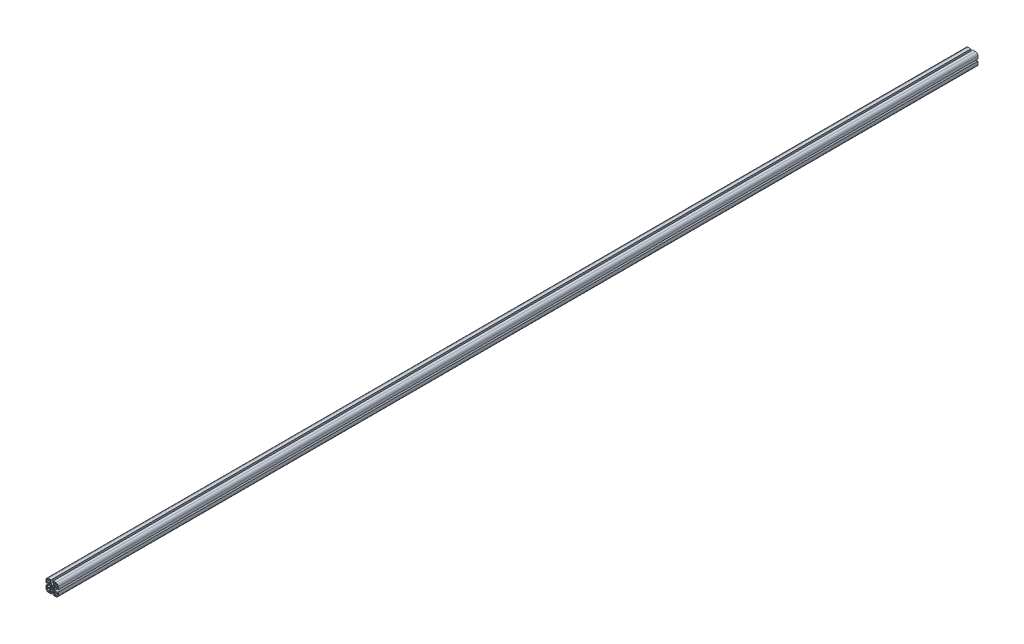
ISO-10303-21;
HEADER;
FILE_DESCRIPTION(('STEP AP214'),'2;1');
FILE_NAME('part.step','',(''),(''),'','','');
FILE_SCHEMA(('AUTOMOTIVE_DESIGN { 1 0 10303 214 1 1 1 1 }'));
ENDSEC;
DATA;
#1=APPLICATION_CONTEXT('core data for automotive mechanical design processes');
#2=APPLICATION_PROTOCOL_DEFINITION('international standard','automotive_design',2000,#1);
#3=PRODUCT_CONTEXT('',#1,'mechanical');
#4=PRODUCT('Part','Part','',(#3));
#5=PRODUCT_RELATED_PRODUCT_CATEGORY('part','',(#4));
#6=PRODUCT_DEFINITION_FORMATION('','',#4);
#7=PRODUCT_DEFINITION_CONTEXT('part definition',#1,'design');
#8=PRODUCT_DEFINITION('design','',#6,#7);
#9=PRODUCT_DEFINITION_SHAPE('','',#8);
#10=(LENGTH_UNIT() NAMED_UNIT(*) SI_UNIT(.MILLI.,.METRE.));
#11=(NAMED_UNIT(*) PLANE_ANGLE_UNIT() SI_UNIT($,.RADIAN.));
#12=(NAMED_UNIT(*) SI_UNIT($,.STERADIAN.) SOLID_ANGLE_UNIT());
#13=UNCERTAINTY_MEASURE_WITH_UNIT(LENGTH_MEASURE(1.E-05),#10,'distance_accuracy_value','');
#14=(GEOMETRIC_REPRESENTATION_CONTEXT(3) GLOBAL_UNCERTAINTY_ASSIGNED_CONTEXT((#13)) GLOBAL_UNIT_ASSIGNED_CONTEXT((#10,
#11,#12)) REPRESENTATION_CONTEXT('',''));
#15=CARTESIAN_POINT('',(0.,0.,0.));
#16=DIRECTION('',(0.,0.,1.));
#17=DIRECTION('',(1.,0.,0.));
#18=AXIS2_PLACEMENT_3D('',#15,#16,#17);
#19=CARTESIAN_POINT('',(7.24999999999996,-13.625,-3000.));
#20=DIRECTION('',(0.,-1.,0.));
#21=DIRECTION('',(0.,0.,-1.));
#22=AXIS2_PLACEMENT_3D('',#19,#20,#21);
#23=PLANE('',#22);
#24=DIRECTION('',(1.,0.,0.));
#25=VECTOR('',#24,1.);
#26=CARTESIAN_POINT('',(7.24999999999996,-13.625,-3000.));
#27=LINE('',#26,#25);
#28=CARTESIAN_POINT('',(7.24999999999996,-13.625,-3000.));
#29=VERTEX_POINT('',#28);
#30=CARTESIAN_POINT('',(8.40160092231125,-13.625,-3000.));
#31=VERTEX_POINT('',#30);
#32=EDGE_CURVE('E855',#29,#31,#27,.T.);
#33=ORIENTED_EDGE('',*,*,#32,.T.);
#34=DIRECTION('',(0.,0.,-1.));
#35=VECTOR('',#34,1.);
#36=CARTESIAN_POINT('',(8.40160092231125,-13.625,-3000.));
#37=LINE('',#36,#35);
#38=CARTESIAN_POINT('',(8.40160092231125,-13.625,0.));
#39=VERTEX_POINT('',#38);
#40=EDGE_CURVE('E853',#31,#39,#37,.F.);
#41=ORIENTED_EDGE('',*,*,#40,.T.);
#42=DIRECTION('',(1.,0.,0.));
#43=VECTOR('',#42,1.);
#44=CARTESIAN_POINT('',(7.24999999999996,-13.625,0.));
#45=LINE('',#44,#43);
#46=CARTESIAN_POINT('',(7.24999999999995,-13.625,0.));
#47=VERTEX_POINT('',#46);
#48=EDGE_CURVE('E18',#39,#47,#45,.F.);
#49=ORIENTED_EDGE('',*,*,#48,.T.);
#50=DIRECTION('',(0.,0.,1.));
#51=VECTOR('',#50,1.);
#52=CARTESIAN_POINT('',(7.24999999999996,-13.625,-3000.));
#53=LINE('',#52,#51);
#54=EDGE_CURVE('E850',#29,#47,#53,.T.);
#55=ORIENTED_EDGE('',*,*,#54,.F.);
#56=EDGE_LOOP('',(#33,#41,#49,#55));
#57=FACE_BOUND('',#56,.T.);
#58=ADVANCED_FACE('F15',(#57),#23,.T.);
#59=CARTESIAN_POINT('',(7.24999999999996,-11.625,-3000.));
#60=DIRECTION('',(0.,-1.,0.));
#61=DIRECTION('',(0.,0.,-1.));
#62=AXIS2_PLACEMENT_3D('',#59,#60,#61);
#63=PLANE('',#62);
#64=DIRECTION('',(0.,0.,-1.));
#65=VECTOR('',#64,1.);
#66=CARTESIAN_POINT('',(8.34104881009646,-11.625,-3000.));
#67=LINE('',#66,#65);
#68=CARTESIAN_POINT('',(8.34104881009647,-11.625,0.));
#69=VERTEX_POINT('',#68);
#70=CARTESIAN_POINT('',(8.34104881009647,-11.625,-3000.));
#71=VERTEX_POINT('',#70);
#72=EDGE_CURVE('E864',#69,#71,#67,.T.);
#73=ORIENTED_EDGE('',*,*,#72,.T.);
#74=DIRECTION('',(1.,0.,0.));
#75=VECTOR('',#74,1.);
#76=CARTESIAN_POINT('',(12.,-11.625,-3000.));
#77=LINE('',#76,#75);
#78=CARTESIAN_POINT('',(7.24999999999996,-11.625,-3000.));
#79=VERTEX_POINT('',#78);
#80=EDGE_CURVE('E1147',#79,#71,#77,.T.);
#81=ORIENTED_EDGE('',*,*,#80,.F.);
#82=DIRECTION('',(0.,0.,1.));
#83=VECTOR('',#82,1.);
#84=CARTESIAN_POINT('',(7.24999999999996,-11.625,-3000.));
#85=LINE('',#84,#83);
#86=CARTESIAN_POINT('',(7.24999999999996,-11.625,0.));
#87=VERTEX_POINT('',#86);
#88=EDGE_CURVE('E1155',#87,#79,#85,.F.);
#89=ORIENTED_EDGE('',*,*,#88,.F.);
#90=DIRECTION('',(1.,0.,0.));
#91=VECTOR('',#90,1.);
#92=CARTESIAN_POINT('',(12.,-11.625,0.));
#93=LINE('',#92,#91);
#94=EDGE_CURVE('E1145',#69,#87,#93,.F.);
#95=ORIENTED_EDGE('',*,*,#94,.F.);
#96=EDGE_LOOP('',(#73,#81,#89,#95));
#97=FACE_BOUND('',#96,.T.);
#98=ADVANCED_FACE('F3447',(#97),#63,.F.);
#99=CARTESIAN_POINT('',(11.625,-7.25,-3000.));
#100=DIRECTION('',(-1.,0.,0.));
#101=DIRECTION('',(0.,0.,1.));
#102=AXIS2_PLACEMENT_3D('',#99,#100,#101);
#103=PLANE('',#102);
#104=DIRECTION('',(0.,1.,0.));
#105=VECTOR('',#104,1.);
#106=CARTESIAN_POINT('',(11.625,-7.25,-3000.));
#107=LINE('',#106,#105);
#108=CARTESIAN_POINT('',(11.625,-7.25,-3000.));
#109=VERTEX_POINT('',#108);
#110=CARTESIAN_POINT('',(11.625,-8.34104881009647,-3000.));
#111=VERTEX_POINT('',#110);
#112=EDGE_CURVE('E1141',#109,#111,#107,.F.);
#113=ORIENTED_EDGE('',*,*,#112,.T.);
#114=DIRECTION('',(0.,0.,-1.));
#115=VECTOR('',#114,1.);
#116=CARTESIAN_POINT('',(11.625,-8.34104881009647,-3000.));
#117=LINE('',#116,#115);
#118=CARTESIAN_POINT('',(11.625,-8.34104881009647,0.));
#119=VERTEX_POINT('',#118);
#120=EDGE_CURVE('E1424',#111,#119,#117,.F.);
#121=ORIENTED_EDGE('',*,*,#120,.T.);
#122=DIRECTION('',(0.,1.,0.));
#123=VECTOR('',#122,1.);
#124=CARTESIAN_POINT('',(11.625,-7.25,0.));
#125=LINE('',#124,#123);
#126=CARTESIAN_POINT('',(11.625,-7.25,0.));
#127=VERTEX_POINT('',#126);
#128=EDGE_CURVE('E1143',#119,#127,#125,.T.);
#129=ORIENTED_EDGE('',*,*,#128,.T.);
#130=DIRECTION('',(0.,0.,-1.));
#131=VECTOR('',#130,1.);
#132=CARTESIAN_POINT('',(11.625,-7.25,-3000.));
#133=LINE('',#132,#131);
#134=EDGE_CURVE('E1415',#109,#127,#133,.F.);
#135=ORIENTED_EDGE('',*,*,#134,.F.);
#136=EDGE_LOOP('',(#113,#121,#129,#135));
#137=FACE_BOUND('',#136,.T.);
#138=ADVANCED_FACE('F1688',(#137),#103,.T.);
#139=CARTESIAN_POINT('',(13.625,-7.25,-3000.));
#140=DIRECTION('',(-1.,0.,0.));
#141=DIRECTION('',(0.,0.,1.));
#142=AXIS2_PLACEMENT_3D('',#139,#140,#141);
#143=PLANE('',#142);
#144=DIRECTION('',(0.,0.,-1.));
#145=VECTOR('',#144,1.);
#146=CARTESIAN_POINT('',(13.625,-8.40160092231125,-3000.));
#147=LINE('',#146,#145);
#148=CARTESIAN_POINT('',(13.625,-8.40160092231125,0.));
#149=VERTEX_POINT('',#148);
#150=CARTESIAN_POINT('',(13.625,-8.40160092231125,-3000.));
#151=VERTEX_POINT('',#150);
#152=EDGE_CURVE('E1421',#149,#151,#147,.T.);
#153=ORIENTED_EDGE('',*,*,#152,.T.);
#154=DIRECTION('',(0.,1.,0.));
#155=VECTOR('',#154,1.);
#156=CARTESIAN_POINT('',(13.625,12.,-3000.));
#157=LINE('',#156,#155);
#158=CARTESIAN_POINT('',(13.625,-7.25,-3000.));
#159=VERTEX_POINT('',#158);
#160=EDGE_CURVE('E1139',#159,#151,#157,.F.);
#161=ORIENTED_EDGE('',*,*,#160,.F.);
#162=DIRECTION('',(0.,0.,1.));
#163=VECTOR('',#162,1.);
#164=CARTESIAN_POINT('',(13.625,-7.25,-3000.));
#165=LINE('',#164,#163);
#166=CARTESIAN_POINT('',(13.625,-7.25,0.));
#167=VERTEX_POINT('',#166);
#168=EDGE_CURVE('E1686',#159,#167,#165,.T.);
#169=ORIENTED_EDGE('',*,*,#168,.T.);
#170=DIRECTION('',(0.,1.,0.));
#171=VECTOR('',#170,1.);
#172=CARTESIAN_POINT('',(13.625,12.,0.));
#173=LINE('',#172,#171);
#174=EDGE_CURVE('E1137',#149,#167,#173,.T.);
#175=ORIENTED_EDGE('',*,*,#174,.F.);
#176=EDGE_LOOP('',(#153,#161,#169,#175));
#177=FACE_BOUND('',#176,.T.);
#178=ADVANCED_FACE('F1685',(#177),#143,.F.);
#179=CARTESIAN_POINT('',(16.6589511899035,-11.625,-3000.));
#180=DIRECTION('',(0.,-1.,0.));
#181=DIRECTION('',(0.,0.,-1.));
#182=AXIS2_PLACEMENT_3D('',#179,#180,#181);
#183=PLANE('',#182);
#184=DIRECTION('',(0.,0.,1.));
#185=VECTOR('',#184,1.);
#186=CARTESIAN_POINT('',(18.,-11.625,-3000.));
#187=LINE('',#186,#185);
#188=CARTESIAN_POINT('',(18.,-11.625,-3000.));
#189=VERTEX_POINT('',#188);
#190=CARTESIAN_POINT('',(18.,-11.625,0.));
#191=VERTEX_POINT('',#190);
#192=EDGE_CURVE('E1692',#189,#191,#187,.T.);
#193=ORIENTED_EDGE('',*,*,#192,.F.);
#194=DIRECTION('',(1.,0.,0.));
#195=VECTOR('',#194,1.);
#196=CARTESIAN_POINT('',(12.,-11.625,-3000.));
#197=LINE('',#196,#195);
#198=CARTESIAN_POINT('',(16.6589511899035,-11.625,-3000.));
#199=VERTEX_POINT('',#198);
#200=EDGE_CURVE('E1135',#199,#189,#197,.T.);
#201=ORIENTED_EDGE('',*,*,#200,.F.);
#202=DIRECTION('',(0.,0.,-1.));
#203=VECTOR('',#202,1.);
#204=CARTESIAN_POINT('',(16.6589511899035,-11.625,-3000.));
#205=LINE('',#204,#203);
#206=CARTESIAN_POINT('',(16.6589511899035,-11.625,0.));
#207=VERTEX_POINT('',#206);
#208=EDGE_CURVE('E1698',#199,#207,#205,.F.);
#209=ORIENTED_EDGE('',*,*,#208,.T.);
#210=DIRECTION('',(1.,0.,0.));
#211=VECTOR('',#210,1.);
#212=CARTESIAN_POINT('',(12.,-11.625,0.));
#213=LINE('',#212,#211);
#214=EDGE_CURVE('E1133',#191,#207,#213,.F.);
#215=ORIENTED_EDGE('',*,*,#214,.F.);
#216=EDGE_LOOP('',(#193,#201,#209,#215));
#217=FACE_BOUND('',#216,.T.);
#218=ADVANCED_FACE('F3417',(#217),#183,.F.);
#219=CARTESIAN_POINT('',(16.5983990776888,-13.625,-3000.));
#220=DIRECTION('',(0.,-1.,0.));
#221=DIRECTION('',(0.,0.,-1.));
#222=AXIS2_PLACEMENT_3D('',#219,#220,#221);
#223=PLANE('',#222);
#224=DIRECTION('',(1.,0.,0.));
#225=VECTOR('',#224,1.);
#226=CARTESIAN_POINT('',(16.5983990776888,-13.625,-3000.));
#227=LINE('',#226,#225);
#228=CARTESIAN_POINT('',(16.5983990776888,-13.625,-3000.));
#229=VERTEX_POINT('',#228);
#230=CARTESIAN_POINT('',(17.775757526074,-13.625,-3000.));
#231=VERTEX_POINT('',#230);
#232=EDGE_CURVE('E1129',#229,#231,#227,.T.);
#233=ORIENTED_EDGE('',*,*,#232,.T.);
#234=DIRECTION('',(0.,0.,-1.));
#235=VECTOR('',#234,1.);
#236=CARTESIAN_POINT('',(17.775757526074,-13.625,-3000.));
#237=LINE('',#236,#235);
#238=CARTESIAN_POINT('',(17.775757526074,-13.625,0.));
#239=VERTEX_POINT('',#238);
#240=EDGE_CURVE('E1704',#231,#239,#237,.F.);
#241=ORIENTED_EDGE('',*,*,#240,.T.);
#242=DIRECTION('',(1.,0.,0.));
#243=VECTOR('',#242,1.);
#244=CARTESIAN_POINT('',(16.5983990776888,-13.625,0.));
#245=LINE('',#244,#243);
#246=CARTESIAN_POINT('',(16.5983990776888,-13.625,0.));
#247=VERTEX_POINT('',#246);
#248=EDGE_CURVE('E1131',#239,#247,#245,.F.);
#249=ORIENTED_EDGE('',*,*,#248,.T.);
#250=DIRECTION('',(0.,0.,-1.));
#251=VECTOR('',#250,1.);
#252=CARTESIAN_POINT('',(16.5983990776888,-13.625,-3000.));
#253=LINE('',#252,#251);
#254=EDGE_CURVE('E1695',#247,#229,#253,.T.);
#255=ORIENTED_EDGE('',*,*,#254,.T.);
#256=EDGE_LOOP('',(#233,#241,#249,#255));
#257=FACE_BOUND('',#256,.T.);
#258=ADVANCED_FACE('F3406',(#257),#223,.T.);
#259=CARTESIAN_POINT('',(11.625,-16.6589511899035,-3000.));
#260=DIRECTION('',(-1.,0.,0.));
#261=DIRECTION('',(0.,0.,1.));
#262=AXIS2_PLACEMENT_3D('',#259,#260,#261);
#263=PLANE('',#262);
#264=DIRECTION('',(0.,1.,0.));
#265=VECTOR('',#264,1.);
#266=CARTESIAN_POINT('',(11.625,-16.6589511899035,-3000.));
#267=LINE('',#266,#265);
#268=CARTESIAN_POINT('',(11.625,-16.6589511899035,-3000.));
#269=VERTEX_POINT('',#268);
#270=CARTESIAN_POINT('',(11.625,-18.,-3000.));
#271=VERTEX_POINT('',#270);
#272=EDGE_CURVE('E1125',#269,#271,#267,.F.);
#273=ORIENTED_EDGE('',*,*,#272,.T.);
#274=DIRECTION('',(0.,0.,1.));
#275=VECTOR('',#274,1.);
#276=CARTESIAN_POINT('',(11.625,-18.,-3000.));
#277=LINE('',#276,#275);
#278=CARTESIAN_POINT('',(11.625,-18.,0.));
#279=VERTEX_POINT('',#278);
#280=EDGE_CURVE('E1430',#271,#279,#277,.T.);
#281=ORIENTED_EDGE('',*,*,#280,.T.);
#282=DIRECTION('',(0.,1.,0.));
#283=VECTOR('',#282,1.);
#284=CARTESIAN_POINT('',(11.625,-16.6589511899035,0.));
#285=LINE('',#284,#283);
#286=CARTESIAN_POINT('',(11.625,-16.6589511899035,0.));
#287=VERTEX_POINT('',#286);
#288=EDGE_CURVE('E1127',#279,#287,#285,.T.);
#289=ORIENTED_EDGE('',*,*,#288,.T.);
#290=DIRECTION('',(0.,0.,-1.));
#291=VECTOR('',#290,1.);
#292=CARTESIAN_POINT('',(11.625,-16.6589511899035,-3000.));
#293=LINE('',#292,#291);
#294=EDGE_CURVE('E1707',#287,#269,#293,.T.);
#295=ORIENTED_EDGE('',*,*,#294,.T.);
#296=EDGE_LOOP('',(#273,#281,#289,#295));
#297=FACE_BOUND('',#296,.T.);
#298=ADVANCED_FACE('F3395',(#297),#263,.T.);
#299=CARTESIAN_POINT('',(13.625,-16.5983990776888,-3000.));
#300=DIRECTION('',(-1.,0.,0.));
#301=DIRECTION('',(0.,0.,1.));
#302=AXIS2_PLACEMENT_3D('',#299,#300,#301);
#303=PLANE('',#302);
#304=DIRECTION('',(0.,0.,-1.));
#305=VECTOR('',#304,1.);
#306=CARTESIAN_POINT('',(13.625,-17.775757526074,-3000.));
#307=LINE('',#306,#305);
#308=CARTESIAN_POINT('',(13.625,-17.775757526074,0.));
#309=VERTEX_POINT('',#308);
#310=CARTESIAN_POINT('',(13.625,-17.775757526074,-3000.));
#311=VERTEX_POINT('',#310);
#312=EDGE_CURVE('E1701',#309,#311,#307,.T.);
#313=ORIENTED_EDGE('',*,*,#312,.T.);
#314=DIRECTION('',(0.,1.,0.));
#315=VECTOR('',#314,1.);
#316=CARTESIAN_POINT('',(13.625,12.,-3000.));
#317=LINE('',#316,#315);
#318=CARTESIAN_POINT('',(13.625,-16.5983990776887,-3000.));
#319=VERTEX_POINT('',#318);
#320=EDGE_CURVE('E1123',#319,#311,#317,.F.);
#321=ORIENTED_EDGE('',*,*,#320,.F.);
#322=DIRECTION('',(0.,0.,-1.));
#323=VECTOR('',#322,1.);
#324=CARTESIAN_POINT('',(13.625,-16.5983990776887,-3000.));
#325=LINE('',#324,#323);
#326=CARTESIAN_POINT('',(13.625,-16.5983990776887,0.));
#327=VERTEX_POINT('',#326);
#328=EDGE_CURVE('E1710',#319,#327,#325,.F.);
#329=ORIENTED_EDGE('',*,*,#328,.T.);
#330=DIRECTION('',(0.,1.,0.));
#331=VECTOR('',#330,1.);
#332=CARTESIAN_POINT('',(13.625,12.,0.));
#333=LINE('',#332,#331);
#334=EDGE_CURVE('E1121',#309,#327,#333,.T.);
#335=ORIENTED_EDGE('',*,*,#334,.F.);
#336=EDGE_LOOP('',(#313,#321,#329,#335));
#337=FACE_BOUND('',#336,.T.);
#338=ADVANCED_FACE('F3384',(#337),#303,.F.);
#339=CARTESIAN_POINT('',(5.24999999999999,-1.5,-3000.));
#340=DIRECTION('',(0.,1.,0.));
#341=DIRECTION('',(0.,0.,1.));
#342=AXIS2_PLACEMENT_3D('',#339,#340,#341);
#343=PLANE('',#342);
#344=DIRECTION('',(0.,0.,-1.));
#345=VECTOR('',#344,1.);
#346=CARTESIAN_POINT('',(3.97649343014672,-1.5,-3000.));
#347=LINE('',#346,#345);
#348=CARTESIAN_POINT('',(3.97649343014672,-1.5,0.));
#349=VERTEX_POINT('',#348);
#350=CARTESIAN_POINT('',(3.97649343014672,-1.5,-3000.));
#351=VERTEX_POINT('',#350);
#352=EDGE_CURVE('E1713',#349,#351,#347,.T.);
#353=ORIENTED_EDGE('',*,*,#352,.T.);
#354=DIRECTION('',(1.,0.,0.));
#355=VECTOR('',#354,1.);
#356=CARTESIAN_POINT('',(12.,-1.5,-3000.));
#357=LINE('',#356,#355);
#358=CARTESIAN_POINT('',(5.25,-1.5,-3000.));
#359=VERTEX_POINT('',#358);
#360=EDGE_CURVE('E1119',#359,#351,#357,.F.);
#361=ORIENTED_EDGE('',*,*,#360,.F.);
#362=DIRECTION('',(0.,0.,1.));
#363=VECTOR('',#362,1.);
#364=CARTESIAN_POINT('',(5.25,-1.5,-3000.));
#365=LINE('',#364,#363);
#366=CARTESIAN_POINT('',(5.25,-1.5,0.));
#367=VERTEX_POINT('',#366);
#368=EDGE_CURVE('E1719',#359,#367,#365,.T.);
#369=ORIENTED_EDGE('',*,*,#368,.T.);
#370=DIRECTION('',(1.,0.,0.));
#371=VECTOR('',#370,1.);
#372=CARTESIAN_POINT('',(12.,-1.5,0.));
#373=LINE('',#372,#371);
#374=EDGE_CURVE('E1117',#349,#367,#373,.T.);
#375=ORIENTED_EDGE('',*,*,#374,.F.);
#376=EDGE_LOOP('',(#353,#361,#369,#375));
#377=FACE_BOUND('',#376,.T.);
#378=ADVANCED_FACE('F3373',(#377),#343,.F.);
#379=CARTESIAN_POINT('',(1.5,-5.24999999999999,-3000.));
#380=DIRECTION('',(1.,0.,0.));
#381=DIRECTION('',(0.,1.,0.));
#382=AXIS2_PLACEMENT_3D('',#379,#380,#381);
#383=PLANE('',#382);
#384=DIRECTION('',(0.,1.,0.));
#385=VECTOR('',#384,1.);
#386=CARTESIAN_POINT('',(1.5,-5.24999999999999,-3000.));
#387=LINE('',#386,#385);
#388=CARTESIAN_POINT('',(1.5,-5.25,-3000.));
#389=VERTEX_POINT('',#388);
#390=CARTESIAN_POINT('',(1.5,-3.97649343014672,-3000.));
#391=VERTEX_POINT('',#390);
#392=EDGE_CURVE('E1113',#389,#391,#387,.T.);
#393=ORIENTED_EDGE('',*,*,#392,.T.);
#394=DIRECTION('',(0.,0.,-1.));
#395=VECTOR('',#394,1.);
#396=CARTESIAN_POINT('',(1.5,-3.97649343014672,-3000.));
#397=LINE('',#396,#395);
#398=CARTESIAN_POINT('',(1.5,-3.97649343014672,0.));
#399=VERTEX_POINT('',#398);
#400=EDGE_CURVE('E1731',#391,#399,#397,.F.);
#401=ORIENTED_EDGE('',*,*,#400,.T.);
#402=DIRECTION('',(0.,1.,0.));
#403=VECTOR('',#402,1.);
#404=CARTESIAN_POINT('',(1.5,-5.24999999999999,0.));
#405=LINE('',#404,#403);
#406=CARTESIAN_POINT('',(1.5,-5.25,0.));
#407=VERTEX_POINT('',#406);
#408=EDGE_CURVE('E1115',#399,#407,#405,.F.);
#409=ORIENTED_EDGE('',*,*,#408,.T.);
#410=DIRECTION('',(0.,0.,1.));
#411=VECTOR('',#410,1.);
#412=CARTESIAN_POINT('',(1.5,-5.25,-3000.));
#413=LINE('',#412,#411);
#414=EDGE_CURVE('E1725',#389,#407,#413,.T.);
#415=ORIENTED_EDGE('',*,*,#414,.F.);
#416=EDGE_LOOP('',(#393,#401,#409,#415));
#417=FACE_BOUND('',#416,.T.);
#418=ADVANCED_FACE('F3362',(#417),#383,.T.);
#419=CARTESIAN_POINT('',(-1.5,-5.24999999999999,-3000.));
#420=DIRECTION('',(1.,0.,0.));
#421=DIRECTION('',(0.,1.,0.));
#422=AXIS2_PLACEMENT_3D('',#419,#420,#421);
#423=PLANE('',#422);
#424=DIRECTION('',(0.,0.,-1.));
#425=VECTOR('',#424,1.);
#426=CARTESIAN_POINT('',(-1.5,-3.97649343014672,-3000.));
#427=LINE('',#426,#425);
#428=CARTESIAN_POINT('',(-1.5,-3.97649343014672,0.));
#429=VERTEX_POINT('',#428);
#430=CARTESIAN_POINT('',(-1.5,-3.97649343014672,-3000.));
#431=VERTEX_POINT('',#430);
#432=EDGE_CURVE('E1728',#429,#431,#427,.T.);
#433=ORIENTED_EDGE('',*,*,#432,.T.);
#434=DIRECTION('',(0.,1.,0.));
#435=VECTOR('',#434,1.);
#436=CARTESIAN_POINT('',(-1.5,12.,-3000.));
#437=LINE('',#436,#435);
#438=CARTESIAN_POINT('',(-1.5,-5.24999999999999,-3000.));
#439=VERTEX_POINT('',#438);
#440=EDGE_CURVE('E1111',#439,#431,#437,.T.);
#441=ORIENTED_EDGE('',*,*,#440,.F.);
#442=DIRECTION('',(0.,0.,1.));
#443=VECTOR('',#442,1.);
#444=CARTESIAN_POINT('',(-1.5,-5.24999999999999,-3000.));
#445=LINE('',#444,#443);
#446=CARTESIAN_POINT('',(-1.5,-5.24999999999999,0.));
#447=VERTEX_POINT('',#446);
#448=EDGE_CURVE('E1734',#439,#447,#445,.T.);
#449=ORIENTED_EDGE('',*,*,#448,.T.);
#450=DIRECTION('',(0.,1.,0.));
#451=VECTOR('',#450,1.);
#452=CARTESIAN_POINT('',(-1.5,12.,0.));
#453=LINE('',#452,#451);
#454=EDGE_CURVE('E1109',#429,#447,#453,.F.);
#455=ORIENTED_EDGE('',*,*,#454,.F.);
#456=EDGE_LOOP('',(#433,#441,#449,#455));
#457=FACE_BOUND('',#456,.T.);
#458=ADVANCED_FACE('F3351',(#457),#423,.F.);
#459=CARTESIAN_POINT('',(-5.24999999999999,-1.5,-3000.));
#460=DIRECTION('',(0.,-1.,0.));
#461=DIRECTION('',(1.,0.,0.));
#462=AXIS2_PLACEMENT_3D('',#459,#460,#461);
#463=PLANE('',#462);
#464=DIRECTION('',(1.,0.,0.));
#465=VECTOR('',#464,1.);
#466=CARTESIAN_POINT('',(-5.24999999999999,-1.5,-3000.));
#467=LINE('',#466,#465);
#468=CARTESIAN_POINT('',(-5.24999999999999,-1.5,-3000.));
#469=VERTEX_POINT('',#468);
#470=CARTESIAN_POINT('',(-3.97649343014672,-1.5,-3000.));
#471=VERTEX_POINT('',#470);
#472=EDGE_CURVE('E1105',#469,#471,#467,.T.);
#473=ORIENTED_EDGE('',*,*,#472,.T.);
#474=DIRECTION('',(0.,0.,-1.));
#475=VECTOR('',#474,1.);
#476=CARTESIAN_POINT('',(-3.97649343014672,-1.5,-3000.));
#477=LINE('',#476,#475);
#478=CARTESIAN_POINT('',(-3.97649343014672,-1.5,0.));
#479=VERTEX_POINT('',#478);
#480=EDGE_CURVE('E1746',#471,#479,#477,.F.);
#481=ORIENTED_EDGE('',*,*,#480,.T.);
#482=DIRECTION('',(1.,0.,0.));
#483=VECTOR('',#482,1.);
#484=CARTESIAN_POINT('',(-5.24999999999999,-1.5,0.));
#485=LINE('',#484,#483);
#486=CARTESIAN_POINT('',(-5.25,-1.5,0.));
#487=VERTEX_POINT('',#486);
#488=EDGE_CURVE('E1107',#479,#487,#485,.F.);
#489=ORIENTED_EDGE('',*,*,#488,.T.);
#490=DIRECTION('',(0.,0.,1.));
#491=VECTOR('',#490,1.);
#492=CARTESIAN_POINT('',(-5.24999999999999,-1.5,-3000.));
#493=LINE('',#492,#491);
#494=EDGE_CURVE('E1740',#469,#487,#493,.T.);
#495=ORIENTED_EDGE('',*,*,#494,.F.);
#496=EDGE_LOOP('',(#473,#481,#489,#495));
#497=FACE_BOUND('',#496,.T.);
#498=ADVANCED_FACE('F3340',(#497),#463,.T.);
#499=CARTESIAN_POINT('',(-5.24999999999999,1.5,-3000.));
#500=DIRECTION('',(0.,-1.,0.));
#501=DIRECTION('',(1.,0.,0.));
#502=AXIS2_PLACEMENT_3D('',#499,#500,#501);
#503=PLANE('',#502);
#504=DIRECTION('',(0.,0.,-1.));
#505=VECTOR('',#504,1.);
#506=CARTESIAN_POINT('',(-3.97649343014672,1.5,-3000.));
#507=LINE('',#506,#505);
#508=CARTESIAN_POINT('',(-3.97649343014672,1.5,0.));
#509=VERTEX_POINT('',#508);
#510=CARTESIAN_POINT('',(-3.97649343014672,1.5,-3000.));
#511=VERTEX_POINT('',#510);
#512=EDGE_CURVE('E1743',#509,#511,#507,.T.);
#513=ORIENTED_EDGE('',*,*,#512,.T.);
#514=DIRECTION('',(1.,0.,0.));
#515=VECTOR('',#514,1.);
#516=CARTESIAN_POINT('',(12.,1.5,-3000.));
#517=LINE('',#516,#515);
#518=CARTESIAN_POINT('',(-5.24999999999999,1.5,-3000.));
#519=VERTEX_POINT('',#518);
#520=EDGE_CURVE('E1103',#519,#511,#517,.T.);
#521=ORIENTED_EDGE('',*,*,#520,.F.);
#522=DIRECTION('',(0.,0.,1.));
#523=VECTOR('',#522,1.);
#524=CARTESIAN_POINT('',(-5.24999999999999,1.5,-3000.));
#525=LINE('',#524,#523);
#526=CARTESIAN_POINT('',(-5.24999999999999,1.5,0.));
#527=VERTEX_POINT('',#526);
#528=EDGE_CURVE('E1749',#519,#527,#525,.T.);
#529=ORIENTED_EDGE('',*,*,#528,.T.);
#530=DIRECTION('',(1.,0.,0.));
#531=VECTOR('',#530,1.);
#532=CARTESIAN_POINT('',(12.,1.5,0.));
#533=LINE('',#532,#531);
#534=EDGE_CURVE('E1101',#509,#527,#533,.F.);
#535=ORIENTED_EDGE('',*,*,#534,.F.);
#536=EDGE_LOOP('',(#513,#521,#529,#535));
#537=FACE_BOUND('',#536,.T.);
#538=ADVANCED_FACE('F3329',(#537),#503,.F.);
#539=CARTESIAN_POINT('',(-1.5,5.24999999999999,-3000.));
#540=DIRECTION('',(-1.,0.,0.));
#541=DIRECTION('',(0.,-1.,0.));
#542=AXIS2_PLACEMENT_3D('',#539,#540,#541);
#543=PLANE('',#542);
#544=DIRECTION('',(0.,-1.,0.));
#545=VECTOR('',#544,1.);
#546=CARTESIAN_POINT('',(-1.5,5.24999999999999,-3000.));
#547=LINE('',#546,#545);
#548=CARTESIAN_POINT('',(-1.5,5.24999999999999,-3000.));
#549=VERTEX_POINT('',#548);
#550=CARTESIAN_POINT('',(-1.5,3.97649343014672,-3000.));
#551=VERTEX_POINT('',#550);
#552=EDGE_CURVE('E1097',#549,#551,#547,.T.);
#553=ORIENTED_EDGE('',*,*,#552,.T.);
#554=DIRECTION('',(0.,0.,-1.));
#555=VECTOR('',#554,1.);
#556=CARTESIAN_POINT('',(-1.5,3.97649343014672,-3000.));
#557=LINE('',#556,#555);
#558=CARTESIAN_POINT('',(-1.5,3.97649343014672,0.));
#559=VERTEX_POINT('',#558);
#560=EDGE_CURVE('E1761',#551,#559,#557,.F.);
#561=ORIENTED_EDGE('',*,*,#560,.T.);
#562=DIRECTION('',(0.,-1.,0.));
#563=VECTOR('',#562,1.);
#564=CARTESIAN_POINT('',(-1.5,5.24999999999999,0.));
#565=LINE('',#564,#563);
#566=CARTESIAN_POINT('',(-1.5,5.24999999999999,0.));
#567=VERTEX_POINT('',#566);
#568=EDGE_CURVE('E1099',#559,#567,#565,.F.);
#569=ORIENTED_EDGE('',*,*,#568,.T.);
#570=DIRECTION('',(0.,0.,1.));
#571=VECTOR('',#570,1.);
#572=CARTESIAN_POINT('',(-1.5,5.24999999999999,-3000.));
#573=LINE('',#572,#571);
#574=EDGE_CURVE('E1755',#549,#567,#573,.T.);
#575=ORIENTED_EDGE('',*,*,#574,.F.);
#576=EDGE_LOOP('',(#553,#561,#569,#575));
#577=FACE_BOUND('',#576,.T.);
#578=ADVANCED_FACE('F3318',(#577),#543,.T.);
#579=CARTESIAN_POINT('',(1.5,5.24999999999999,-3000.));
#580=DIRECTION('',(-1.,0.,0.));
#581=DIRECTION('',(0.,-1.,0.));
#582=AXIS2_PLACEMENT_3D('',#579,#580,#581);
#583=PLANE('',#582);
#584=DIRECTION('',(0.,0.,-1.));
#585=VECTOR('',#584,1.);
#586=CARTESIAN_POINT('',(1.5,3.97649343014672,-3000.));
#587=LINE('',#586,#585);
#588=CARTESIAN_POINT('',(1.5,3.97649343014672,0.));
#589=VERTEX_POINT('',#588);
#590=CARTESIAN_POINT('',(1.5,3.97649343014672,-3000.));
#591=VERTEX_POINT('',#590);
#592=EDGE_CURVE('E1758',#589,#591,#587,.T.);
#593=ORIENTED_EDGE('',*,*,#592,.T.);
#594=DIRECTION('',(0.,1.,0.));
#595=VECTOR('',#594,1.);
#596=CARTESIAN_POINT('',(1.5,12.,-3000.));
#597=LINE('',#596,#595);
#598=CARTESIAN_POINT('',(1.5,5.25,-3000.));
#599=VERTEX_POINT('',#598);
#600=EDGE_CURVE('E1095',#599,#591,#597,.F.);
#601=ORIENTED_EDGE('',*,*,#600,.F.);
#602=DIRECTION('',(0.,0.,1.));
#603=VECTOR('',#602,1.);
#604=CARTESIAN_POINT('',(1.5,5.25,-3000.));
#605=LINE('',#604,#603);
#606=CARTESIAN_POINT('',(1.5,5.24999999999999,0.));
#607=VERTEX_POINT('',#606);
#608=EDGE_CURVE('E1764',#599,#607,#605,.T.);
#609=ORIENTED_EDGE('',*,*,#608,.T.);
#610=DIRECTION('',(0.,1.,0.));
#611=VECTOR('',#610,1.);
#612=CARTESIAN_POINT('',(1.5,12.,0.));
#613=LINE('',#612,#611);
#614=EDGE_CURVE('E1093',#589,#607,#613,.T.);
#615=ORIENTED_EDGE('',*,*,#614,.F.);
#616=EDGE_LOOP('',(#593,#601,#609,#615));
#617=FACE_BOUND('',#616,.T.);
#618=ADVANCED_FACE('F3307',(#617),#583,.F.);
#619=CARTESIAN_POINT('',(5.24999999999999,1.5,-3000.));
#620=DIRECTION('',(0.,1.,0.));
#621=DIRECTION('',(0.,0.,1.));
#622=AXIS2_PLACEMENT_3D('',#619,#620,#621);
#623=PLANE('',#622);
#624=DIRECTION('',(1.,0.,0.));
#625=VECTOR('',#624,1.);
#626=CARTESIAN_POINT('',(5.24999999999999,1.5,-3000.));
#627=LINE('',#626,#625);
#628=CARTESIAN_POINT('',(5.24999999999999,1.5,-3000.));
#629=VERTEX_POINT('',#628);
#630=CARTESIAN_POINT('',(3.97649343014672,1.5,-3000.));
#631=VERTEX_POINT('',#630);
#632=EDGE_CURVE('E1089',#629,#631,#627,.F.);
#633=ORIENTED_EDGE('',*,*,#632,.T.);
#634=DIRECTION('',(0.,0.,-1.));
#635=VECTOR('',#634,1.);
#636=CARTESIAN_POINT('',(3.97649343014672,1.5,-3000.));
#637=LINE('',#636,#635);
#638=CARTESIAN_POINT('',(3.97649343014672,1.5,0.));
#639=VERTEX_POINT('',#638);
#640=EDGE_CURVE('E1716',#631,#639,#637,.F.);
#641=ORIENTED_EDGE('',*,*,#640,.T.);
#642=DIRECTION('',(1.,0.,0.));
#643=VECTOR('',#642,1.);
#644=CARTESIAN_POINT('',(5.24999999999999,1.5,0.));
#645=LINE('',#644,#643);
#646=CARTESIAN_POINT('',(5.24999999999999,1.5,0.));
#647=VERTEX_POINT('',#646);
#648=EDGE_CURVE('E1091',#639,#647,#645,.T.);
#649=ORIENTED_EDGE('',*,*,#648,.T.);
#650=DIRECTION('',(0.,0.,1.));
#651=VECTOR('',#650,1.);
#652=CARTESIAN_POINT('',(5.24999999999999,1.5,-3000.));
#653=LINE('',#652,#651);
#654=EDGE_CURVE('E1770',#629,#647,#653,.T.);
#655=ORIENTED_EDGE('',*,*,#654,.F.);
#656=EDGE_LOOP('',(#633,#641,#649,#655));
#657=FACE_BOUND('',#656,.T.);
#658=ADVANCED_FACE('F3296',(#657),#623,.T.);
#659=CARTESIAN_POINT('',(7.24999999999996,13.625,-3000.));
#660=DIRECTION('',(0.,-1.,0.));
#661=DIRECTION('',(0.,0.,-1.));
#662=AXIS2_PLACEMENT_3D('',#659,#660,#661);
#663=PLANE('',#662);
#664=DIRECTION('',(0.,0.,-1.));
#665=VECTOR('',#664,1.);
#666=CARTESIAN_POINT('',(8.40160092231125,13.625,-3000.));
#667=LINE('',#666,#665);
#668=CARTESIAN_POINT('',(8.40160092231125,13.625,0.));
#669=VERTEX_POINT('',#668);
#670=CARTESIAN_POINT('',(8.40160092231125,13.625,-3000.));
#671=VERTEX_POINT('',#670);
#672=EDGE_CURVE('E1773',#669,#671,#667,.T.);
#673=ORIENTED_EDGE('',*,*,#672,.T.);
#674=DIRECTION('',(1.,0.,0.));
#675=VECTOR('',#674,1.);
#676=CARTESIAN_POINT('',(12.,13.625,-3000.));
#677=LINE('',#676,#675);
#678=CARTESIAN_POINT('',(7.24999999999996,13.625,-3000.));
#679=VERTEX_POINT('',#678);
#680=EDGE_CURVE('E1087',#679,#671,#677,.T.);
#681=ORIENTED_EDGE('',*,*,#680,.F.);
#682=DIRECTION('',(0.,0.,1.));
#683=VECTOR('',#682,1.);
#684=CARTESIAN_POINT('',(7.24999999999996,13.625,-3000.));
#685=LINE('',#684,#683);
#686=CARTESIAN_POINT('',(7.24999999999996,13.625,0.));
#687=VERTEX_POINT('',#686);
#688=EDGE_CURVE('E1779',#679,#687,#685,.T.);
#689=ORIENTED_EDGE('',*,*,#688,.T.);
#690=DIRECTION('',(1.,0.,0.));
#691=VECTOR('',#690,1.);
#692=CARTESIAN_POINT('',(12.,13.625,0.));
#693=LINE('',#692,#691);
#694=EDGE_CURVE('E1085',#669,#687,#693,.F.);
#695=ORIENTED_EDGE('',*,*,#694,.F.);
#696=EDGE_LOOP('',(#673,#681,#689,#695));
#697=FACE_BOUND('',#696,.T.);
#698=ADVANCED_FACE('F3285',(#697),#663,.F.);
#699=CARTESIAN_POINT('',(11.625,16.6589511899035,-3000.));
#700=DIRECTION('',(1.,0.,0.));
#701=DIRECTION('',(0.,0.,-1.));
#702=AXIS2_PLACEMENT_3D('',#699,#700,#701);
#703=PLANE('',#702);
#704=DIRECTION('',(0.,0.,1.));
#705=VECTOR('',#704,1.);
#706=CARTESIAN_POINT('',(11.625,18.,-3000.));
#707=LINE('',#706,#705);
#708=CARTESIAN_POINT('',(11.625,18.,0.));
#709=VERTEX_POINT('',#708);
#710=CARTESIAN_POINT('',(11.625,18.,-3000.));
#711=VERTEX_POINT('',#710);
#712=EDGE_CURVE('E1784',#709,#711,#707,.F.);
#713=ORIENTED_EDGE('',*,*,#712,.T.);
#714=DIRECTION('',(0.,1.,0.));
#715=VECTOR('',#714,1.);
#716=CARTESIAN_POINT('',(11.625,12.,-3000.));
#717=LINE('',#716,#715);
#718=CARTESIAN_POINT('',(11.625,16.6589511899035,-3000.));
#719=VERTEX_POINT('',#718);
#720=EDGE_CURVE('E1083',#719,#711,#717,.T.);
#721=ORIENTED_EDGE('',*,*,#720,.F.);
#722=DIRECTION('',(0.,0.,-1.));
#723=VECTOR('',#722,1.);
#724=CARTESIAN_POINT('',(11.625,16.6589511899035,-3000.));
#725=LINE('',#724,#723);
#726=CARTESIAN_POINT('',(11.625,16.6589511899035,0.));
#727=VERTEX_POINT('',#726);
#728=EDGE_CURVE('E1790',#719,#727,#725,.F.);
#729=ORIENTED_EDGE('',*,*,#728,.T.);
#730=DIRECTION('',(0.,1.,0.));
#731=VECTOR('',#730,1.);
#732=CARTESIAN_POINT('',(11.625,12.,0.));
#733=LINE('',#732,#731);
#734=EDGE_CURVE('E1081',#709,#727,#733,.F.);
#735=ORIENTED_EDGE('',*,*,#734,.F.);
#736=EDGE_LOOP('',(#713,#721,#729,#735));
#737=FACE_BOUND('',#736,.T.);
#738=ADVANCED_FACE('F3274',(#737),#703,.F.);
#739=CARTESIAN_POINT('',(13.625,16.5983990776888,-3000.));
#740=DIRECTION('',(1.,0.,0.));
#741=DIRECTION('',(0.,0.,-1.));
#742=AXIS2_PLACEMENT_3D('',#739,#740,#741);
#743=PLANE('',#742);
#744=DIRECTION('',(0.,1.,0.));
#745=VECTOR('',#744,1.);
#746=CARTESIAN_POINT('',(13.625,16.5983990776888,-3000.));
#747=LINE('',#746,#745);
#748=CARTESIAN_POINT('',(13.625,16.5983990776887,-3000.));
#749=VERTEX_POINT('',#748);
#750=CARTESIAN_POINT('',(13.625,17.775757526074,-3000.));
#751=VERTEX_POINT('',#750);
#752=EDGE_CURVE('E1077',#749,#751,#747,.T.);
#753=ORIENTED_EDGE('',*,*,#752,.T.);
#754=DIRECTION('',(0.,0.,-1.));
#755=VECTOR('',#754,1.);
#756=CARTESIAN_POINT('',(13.625,17.775757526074,-3000.));
#757=LINE('',#756,#755);
#758=CARTESIAN_POINT('',(13.625,17.775757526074,0.));
#759=VERTEX_POINT('',#758);
#760=EDGE_CURVE('E1796',#751,#759,#757,.F.);
#761=ORIENTED_EDGE('',*,*,#760,.T.);
#762=DIRECTION('',(0.,1.,0.));
#763=VECTOR('',#762,1.);
#764=CARTESIAN_POINT('',(13.625,16.5983990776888,0.));
#765=LINE('',#764,#763);
#766=CARTESIAN_POINT('',(13.625,16.5983990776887,0.));
#767=VERTEX_POINT('',#766);
#768=EDGE_CURVE('E1079',#759,#767,#765,.F.);
#769=ORIENTED_EDGE('',*,*,#768,.T.);
#770=DIRECTION('',(0.,0.,-1.));
#771=VECTOR('',#770,1.);
#772=CARTESIAN_POINT('',(13.625,16.5983990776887,-3000.));
#773=LINE('',#772,#771);
#774=EDGE_CURVE('E1787',#767,#749,#773,.T.);
#775=ORIENTED_EDGE('',*,*,#774,.T.);
#776=EDGE_LOOP('',(#753,#761,#769,#775));
#777=FACE_BOUND('',#776,.T.);
#778=ADVANCED_FACE('F3263',(#777),#743,.T.);
#779=CARTESIAN_POINT('',(16.5983990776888,13.625,-3000.));
#780=DIRECTION('',(0.,-1.,0.));
#781=DIRECTION('',(0.,0.,-1.));
#782=AXIS2_PLACEMENT_3D('',#779,#780,#781);
#783=PLANE('',#782);
#784=DIRECTION('',(0.,0.,-1.));
#785=VECTOR('',#784,1.);
#786=CARTESIAN_POINT('',(17.775757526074,13.625,-3000.));
#787=LINE('',#786,#785);
#788=CARTESIAN_POINT('',(17.775757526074,13.625,0.));
#789=VERTEX_POINT('',#788);
#790=CARTESIAN_POINT('',(17.775757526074,13.625,-3000.));
#791=VERTEX_POINT('',#790);
#792=EDGE_CURVE('E1793',#789,#791,#787,.T.);
#793=ORIENTED_EDGE('',*,*,#792,.T.);
#794=DIRECTION('',(1.,0.,0.));
#795=VECTOR('',#794,1.);
#796=CARTESIAN_POINT('',(12.,13.625,-3000.));
#797=LINE('',#796,#795);
#798=CARTESIAN_POINT('',(16.5983990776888,13.625,-3000.));
#799=VERTEX_POINT('',#798);
#800=EDGE_CURVE('E1075',#799,#791,#797,.T.);
#801=ORIENTED_EDGE('',*,*,#800,.F.);
#802=DIRECTION('',(0.,0.,-1.));
#803=VECTOR('',#802,1.);
#804=CARTESIAN_POINT('',(16.5983990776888,13.625,-3000.));
#805=LINE('',#804,#803);
#806=CARTESIAN_POINT('',(16.5983990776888,13.625,0.));
#807=VERTEX_POINT('',#806);
#808=EDGE_CURVE('E1802',#799,#807,#805,.F.);
#809=ORIENTED_EDGE('',*,*,#808,.T.);
#810=DIRECTION('',(1.,0.,0.));
#811=VECTOR('',#810,1.);
#812=CARTESIAN_POINT('',(12.,13.625,0.));
#813=LINE('',#812,#811);
#814=EDGE_CURVE('E1073',#789,#807,#813,.F.);
#815=ORIENTED_EDGE('',*,*,#814,.F.);
#816=EDGE_LOOP('',(#793,#801,#809,#815));
#817=FACE_BOUND('',#816,.T.);
#818=ADVANCED_FACE('F3252',(#817),#783,.F.);
#819=CARTESIAN_POINT('',(16.6589511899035,11.625,-3000.));
#820=DIRECTION('',(0.,-1.,0.));
#821=DIRECTION('',(0.,0.,-1.));
#822=AXIS2_PLACEMENT_3D('',#819,#820,#821);
#823=PLANE('',#822);
#824=DIRECTION('',(1.,0.,0.));
#825=VECTOR('',#824,1.);
#826=CARTESIAN_POINT('',(16.6589511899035,11.625,-3000.));
#827=LINE('',#826,#825);
#828=CARTESIAN_POINT('',(16.6589511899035,11.625,-3000.));
#829=VERTEX_POINT('',#828);
#830=CARTESIAN_POINT('',(18.,11.625,-3000.));
#831=VERTEX_POINT('',#830);
#832=EDGE_CURVE('E1069',#829,#831,#827,.T.);
#833=ORIENTED_EDGE('',*,*,#832,.T.);
#834=DIRECTION('',(0.,0.,-1.));
#835=VECTOR('',#834,1.);
#836=CARTESIAN_POINT('',(18.,11.625,-3000.));
#837=LINE('',#836,#835);
#838=CARTESIAN_POINT('',(18.,11.625,0.));
#839=VERTEX_POINT('',#838);
#840=EDGE_CURVE('E1805',#831,#839,#837,.F.);
#841=ORIENTED_EDGE('',*,*,#840,.T.);
#842=DIRECTION('',(1.,0.,0.));
#843=VECTOR('',#842,1.);
#844=CARTESIAN_POINT('',(16.6589511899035,11.625,0.));
#845=LINE('',#844,#843);
#846=CARTESIAN_POINT('',(16.6589511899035,11.625,0.));
#847=VERTEX_POINT('',#846);
#848=EDGE_CURVE('E1071',#839,#847,#845,.F.);
#849=ORIENTED_EDGE('',*,*,#848,.T.);
#850=DIRECTION('',(0.,0.,-1.));
#851=VECTOR('',#850,1.);
#852=CARTESIAN_POINT('',(16.6589511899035,11.625,-3000.));
#853=LINE('',#852,#851);
#854=EDGE_CURVE('E1799',#847,#829,#853,.T.);
#855=ORIENTED_EDGE('',*,*,#854,.T.);
#856=EDGE_LOOP('',(#833,#841,#849,#855));
#857=FACE_BOUND('',#856,.T.);
#858=ADVANCED_FACE('F3241',(#857),#823,.T.);
#859=CARTESIAN_POINT('',(13.625,7.25,-3000.));
#860=DIRECTION('',(1.,0.,0.));
#861=DIRECTION('',(0.,0.,-1.));
#862=AXIS2_PLACEMENT_3D('',#859,#860,#861);
#863=PLANE('',#862);
#864=DIRECTION('',(0.,1.,0.));
#865=VECTOR('',#864,1.);
#866=CARTESIAN_POINT('',(13.625,7.25,-3000.));
#867=LINE('',#866,#865);
#868=CARTESIAN_POINT('',(13.625,7.25,-3000.));
#869=VERTEX_POINT('',#868);
#870=CARTESIAN_POINT('',(13.625,8.40160092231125,-3000.));
#871=VERTEX_POINT('',#870);
#872=EDGE_CURVE('E1065',#869,#871,#867,.T.);
#873=ORIENTED_EDGE('',*,*,#872,.T.);
#874=DIRECTION('',(0.,0.,-1.));
#875=VECTOR('',#874,1.);
#876=CARTESIAN_POINT('',(13.625,8.40160092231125,-3000.));
#877=LINE('',#876,#875);
#878=CARTESIAN_POINT('',(13.625,8.40160092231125,0.));
#879=VERTEX_POINT('',#878);
#880=EDGE_CURVE('E1817',#871,#879,#877,.F.);
#881=ORIENTED_EDGE('',*,*,#880,.T.);
#882=DIRECTION('',(0.,1.,0.));
#883=VECTOR('',#882,1.);
#884=CARTESIAN_POINT('',(13.625,7.25,0.));
#885=LINE('',#884,#883);
#886=CARTESIAN_POINT('',(13.625,7.25,0.));
#887=VERTEX_POINT('',#886);
#888=EDGE_CURVE('E1067',#879,#887,#885,.F.);
#889=ORIENTED_EDGE('',*,*,#888,.T.);
#890=DIRECTION('',(0.,0.,1.));
#891=VECTOR('',#890,1.);
#892=CARTESIAN_POINT('',(13.625,7.25,-3000.));
#893=LINE('',#892,#891);
#894=EDGE_CURVE('E1811',#869,#887,#893,.T.);
#895=ORIENTED_EDGE('',*,*,#894,.F.);
#896=EDGE_LOOP('',(#873,#881,#889,#895));
#897=FACE_BOUND('',#896,.T.);
#898=ADVANCED_FACE('F3230',(#897),#863,.T.);
#899=CARTESIAN_POINT('',(11.625,7.25,-3000.));
#900=DIRECTION('',(1.,0.,0.));
#901=DIRECTION('',(0.,0.,-1.));
#902=AXIS2_PLACEMENT_3D('',#899,#900,#901);
#903=PLANE('',#902);
#904=DIRECTION('',(0.,0.,-1.));
#905=VECTOR('',#904,1.);
#906=CARTESIAN_POINT('',(11.625,8.34104881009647,-3000.));
#907=LINE('',#906,#905);
#908=CARTESIAN_POINT('',(11.625,8.34104881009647,0.));
#909=VERTEX_POINT('',#908);
#910=CARTESIAN_POINT('',(11.625,8.34104881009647,-3000.));
#911=VERTEX_POINT('',#910);
#912=EDGE_CURVE('E1814',#909,#911,#907,.T.);
#913=ORIENTED_EDGE('',*,*,#912,.T.);
#914=DIRECTION('',(0.,1.,0.));
#915=VECTOR('',#914,1.);
#916=CARTESIAN_POINT('',(11.625,12.,-3000.));
#917=LINE('',#916,#915);
#918=CARTESIAN_POINT('',(11.625,7.25,-3000.));
#919=VERTEX_POINT('',#918);
#920=EDGE_CURVE('E1063',#919,#911,#917,.T.);
#921=ORIENTED_EDGE('',*,*,#920,.F.);
#922=DIRECTION('',(0.,0.,1.));
#923=VECTOR('',#922,1.);
#924=CARTESIAN_POINT('',(11.625,7.25,-3000.));
#925=LINE('',#924,#923);
#926=CARTESIAN_POINT('',(11.625,7.25,0.));
#927=VERTEX_POINT('',#926);
#928=EDGE_CURVE('E1820',#927,#919,#925,.F.);
#929=ORIENTED_EDGE('',*,*,#928,.F.);
#930=DIRECTION('',(0.,1.,0.));
#931=VECTOR('',#930,1.);
#932=CARTESIAN_POINT('',(11.625,12.,0.));
#933=LINE('',#932,#931);
#934=EDGE_CURVE('E1061',#909,#927,#933,.F.);
#935=ORIENTED_EDGE('',*,*,#934,.F.);
#936=EDGE_LOOP('',(#913,#921,#929,#935));
#937=FACE_BOUND('',#936,.T.);
#938=ADVANCED_FACE('F3219',(#937),#903,.F.);
#939=CARTESIAN_POINT('',(7.24999999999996,11.625,-3000.));
#940=DIRECTION('',(0.,-1.,0.));
#941=DIRECTION('',(0.,0.,-1.));
#942=AXIS2_PLACEMENT_3D('',#939,#940,#941);
#943=PLANE('',#942);
#944=DIRECTION('',(1.,0.,0.));
#945=VECTOR('',#944,1.);
#946=CARTESIAN_POINT('',(7.24999999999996,11.625,-3000.));
#947=LINE('',#946,#945);
#948=CARTESIAN_POINT('',(7.24999999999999,11.625,-3000.));
#949=VERTEX_POINT('',#948);
#950=CARTESIAN_POINT('',(8.34104881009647,11.625,-3000.));
#951=VERTEX_POINT('',#950);
#952=EDGE_CURVE('E1057',#949,#951,#947,.T.);
#953=ORIENTED_EDGE('',*,*,#952,.T.);
#954=DIRECTION('',(0.,0.,-1.));
#955=VECTOR('',#954,1.);
#956=CARTESIAN_POINT('',(8.34104881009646,11.625,-3000.));
#957=LINE('',#956,#955);
#958=CARTESIAN_POINT('',(8.34104881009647,11.625,0.));
#959=VERTEX_POINT('',#958);
#960=EDGE_CURVE('E1776',#951,#959,#957,.F.);
#961=ORIENTED_EDGE('',*,*,#960,.T.);
#962=DIRECTION('',(1.,0.,0.));
#963=VECTOR('',#962,1.);
#964=CARTESIAN_POINT('',(7.24999999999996,11.625,0.));
#965=LINE('',#964,#963);
#966=CARTESIAN_POINT('',(7.24999999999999,11.625,0.));
#967=VERTEX_POINT('',#966);
#968=EDGE_CURVE('E1059',#959,#967,#965,.F.);
#969=ORIENTED_EDGE('',*,*,#968,.T.);
#970=DIRECTION('',(0.,0.,1.));
#971=VECTOR('',#970,1.);
#972=CARTESIAN_POINT('',(7.24999999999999,11.625,-3000.));
#973=LINE('',#972,#971);
#974=EDGE_CURVE('E1826',#949,#967,#973,.T.);
#975=ORIENTED_EDGE('',*,*,#974,.F.);
#976=EDGE_LOOP('',(#953,#961,#969,#975));
#977=FACE_BOUND('',#976,.T.);
#978=ADVANCED_FACE('F3208',(#977),#943,.T.);
#979=CARTESIAN_POINT('',(-7.24999999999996,-11.625,-3000.));
#980=DIRECTION('',(0.,1.,0.));
#981=DIRECTION('',(0.,0.,1.));
#982=AXIS2_PLACEMENT_3D('',#979,#980,#981);
#983=PLANE('',#982);
#984=DIRECTION('',(1.,0.,0.));
#985=VECTOR('',#984,1.);
#986=CARTESIAN_POINT('',(-7.24999999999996,-11.625,-3000.));
#987=LINE('',#986,#985);
#988=CARTESIAN_POINT('',(-7.24999999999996,-11.625,-3000.));
#989=VERTEX_POINT('',#988);
#990=CARTESIAN_POINT('',(-8.34104881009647,-11.625,-3000.));
#991=VERTEX_POINT('',#990);
#992=EDGE_CURVE('E1053',#989,#991,#987,.F.);
#993=ORIENTED_EDGE('',*,*,#992,.T.);
#994=DIRECTION('',(0.,0.,-1.));
#995=VECTOR('',#994,1.);
#996=CARTESIAN_POINT('',(-8.34104881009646,-11.625,-3000.));
#997=LINE('',#996,#995);
#998=CARTESIAN_POINT('',(-8.34104881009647,-11.625,0.));
#999=VERTEX_POINT('',#998);
#1000=EDGE_CURVE('E1840',#991,#999,#997,.F.);
#1001=ORIENTED_EDGE('',*,*,#1000,.T.);
#1002=DIRECTION('',(1.,0.,0.));
#1003=VECTOR('',#1002,1.);
#1004=CARTESIAN_POINT('',(-7.24999999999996,-11.625,0.));
#1005=LINE('',#1004,#1003);
#1006=CARTESIAN_POINT('',(-7.24999999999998,-11.625,0.));
#1007=VERTEX_POINT('',#1006);
#1008=EDGE_CURVE('E1055',#999,#1007,#1005,.T.);
#1009=ORIENTED_EDGE('',*,*,#1008,.T.);
#1010=DIRECTION('',(0.,0.,1.));
#1011=VECTOR('',#1010,1.);
#1012=CARTESIAN_POINT('',(-7.24999999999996,-11.625,-3000.));
#1013=LINE('',#1012,#1011);
#1014=EDGE_CURVE('E1834',#1007,#989,#1013,.F.);
#1015=ORIENTED_EDGE('',*,*,#1014,.T.);
#1016=EDGE_LOOP('',(#993,#1001,#1009,#1015));
#1017=FACE_BOUND('',#1016,.T.);
#1018=ADVANCED_FACE('F3197',(#1017),#983,.T.);
#1019=CARTESIAN_POINT('',(-7.24999999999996,-13.625,-3000.));
#1020=DIRECTION('',(0.,1.,0.));
#1021=DIRECTION('',(0.,0.,1.));
#1022=AXIS2_PLACEMENT_3D('',#1019,#1020,#1021);
#1023=PLANE('',#1022);
#1024=DIRECTION('',(0.,0.,-1.));
#1025=VECTOR('',#1024,1.);
#1026=CARTESIAN_POINT('',(-8.40160092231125,-13.625,-3000.));
#1027=LINE('',#1026,#1025);
#1028=CARTESIAN_POINT('',(-8.40160092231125,-13.625,0.));
#1029=VERTEX_POINT('',#1028);
#1030=CARTESIAN_POINT('',(-8.40160092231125,-13.625,-3000.));
#1031=VERTEX_POINT('',#1030);
#1032=EDGE_CURVE('E1837',#1029,#1031,#1027,.T.);
#1033=ORIENTED_EDGE('',*,*,#1032,.T.);
#1034=DIRECTION('',(1.,0.,0.));
#1035=VECTOR('',#1034,1.);
#1036=CARTESIAN_POINT('',(12.,-13.625,-3000.));
#1037=LINE('',#1036,#1035);
#1038=CARTESIAN_POINT('',(-7.24999999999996,-13.625,-3000.));
#1039=VERTEX_POINT('',#1038);
#1040=EDGE_CURVE('E1051',#1039,#1031,#1037,.F.);
#1041=ORIENTED_EDGE('',*,*,#1040,.F.);
#1042=DIRECTION('',(0.,0.,1.));
#1043=VECTOR('',#1042,1.);
#1044=CARTESIAN_POINT('',(-7.24999999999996,-13.625,-3000.));
#1045=LINE('',#1044,#1043);
#1046=CARTESIAN_POINT('',(-7.24999999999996,-13.625,0.));
#1047=VERTEX_POINT('',#1046);
#1048=EDGE_CURVE('E1843',#1047,#1039,#1045,.F.);
#1049=ORIENTED_EDGE('',*,*,#1048,.F.);
#1050=DIRECTION('',(1.,0.,0.));
#1051=VECTOR('',#1050,1.);
#1052=CARTESIAN_POINT('',(12.,-13.625,0.));
#1053=LINE('',#1052,#1051);
#1054=EDGE_CURVE('E1049',#1029,#1047,#1053,.T.);
#1055=ORIENTED_EDGE('',*,*,#1054,.F.);
#1056=EDGE_LOOP('',(#1033,#1041,#1049,#1055));
#1057=FACE_BOUND('',#1056,.T.);
#1058=ADVANCED_FACE('F3186',(#1057),#1023,.F.);
#1059=CARTESIAN_POINT('',(-11.625,-16.6589511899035,-3000.));
#1060=DIRECTION('',(-1.,0.,0.));
#1061=DIRECTION('',(0.,0.,1.));
#1062=AXIS2_PLACEMENT_3D('',#1059,#1060,#1061);
#1063=PLANE('',#1062);
#1064=DIRECTION('',(0.,0.,1.));
#1065=VECTOR('',#1064,1.);
#1066=CARTESIAN_POINT('',(-11.625,-18.,-3000.));
#1067=LINE('',#1066,#1065);
#1068=CARTESIAN_POINT('',(-11.625,-18.,-3000.));
#1069=VERTEX_POINT('',#1068);
#1070=CARTESIAN_POINT('',(-11.625,-18.,0.));
#1071=VERTEX_POINT('',#1070);
#1072=EDGE_CURVE('E1849',#1069,#1071,#1067,.T.);
#1073=ORIENTED_EDGE('',*,*,#1072,.F.);
#1074=DIRECTION('',(0.,1.,0.));
#1075=VECTOR('',#1074,1.);
#1076=CARTESIAN_POINT('',(-11.625,12.,-3000.));
#1077=LINE('',#1076,#1075);
#1078=CARTESIAN_POINT('',(-11.625,-16.6589511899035,-3000.));
#1079=VERTEX_POINT('',#1078);
#1080=EDGE_CURVE('E1047',#1079,#1069,#1077,.F.);
#1081=ORIENTED_EDGE('',*,*,#1080,.F.);
#1082=DIRECTION('',(0.,0.,-1.));
#1083=VECTOR('',#1082,1.);
#1084=CARTESIAN_POINT('',(-11.625,-16.6589511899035,-3000.));
#1085=LINE('',#1084,#1083);
#1086=CARTESIAN_POINT('',(-11.625,-16.6589511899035,0.));
#1087=VERTEX_POINT('',#1086);
#1088=EDGE_CURVE('E1855',#1079,#1087,#1085,.F.);
#1089=ORIENTED_EDGE('',*,*,#1088,.T.);
#1090=DIRECTION('',(0.,1.,0.));
#1091=VECTOR('',#1090,1.);
#1092=CARTESIAN_POINT('',(-11.625,12.,0.));
#1093=LINE('',#1092,#1091);
#1094=EDGE_CURVE('E1045',#1071,#1087,#1093,.T.);
#1095=ORIENTED_EDGE('',*,*,#1094,.F.);
#1096=EDGE_LOOP('',(#1073,#1081,#1089,#1095));
#1097=FACE_BOUND('',#1096,.T.);
#1098=ADVANCED_FACE('F3175',(#1097),#1063,.F.);
#1099=CARTESIAN_POINT('',(-13.625,-16.5983990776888,-3000.));
#1100=DIRECTION('',(-1.,0.,0.));
#1101=DIRECTION('',(0.,0.,1.));
#1102=AXIS2_PLACEMENT_3D('',#1099,#1100,#1101);
#1103=PLANE('',#1102);
#1104=DIRECTION('',(0.,1.,0.));
#1105=VECTOR('',#1104,1.);
#1106=CARTESIAN_POINT('',(-13.625,-16.5983990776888,-3000.));
#1107=LINE('',#1106,#1105);
#1108=CARTESIAN_POINT('',(-13.625,-16.5983990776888,-3000.));
#1109=VERTEX_POINT('',#1108);
#1110=CARTESIAN_POINT('',(-13.625,-17.775757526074,-3000.));
#1111=VERTEX_POINT('',#1110);
#1112=EDGE_CURVE('E1041',#1109,#1111,#1107,.F.);
#1113=ORIENTED_EDGE('',*,*,#1112,.T.);
#1114=DIRECTION('',(0.,0.,-1.));
#1115=VECTOR('',#1114,1.);
#1116=CARTESIAN_POINT('',(-13.625,-17.775757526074,-3000.));
#1117=LINE('',#1116,#1115);
#1118=CARTESIAN_POINT('',(-13.625,-17.775757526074,0.));
#1119=VERTEX_POINT('',#1118);
#1120=EDGE_CURVE('E1861',#1111,#1119,#1117,.F.);
#1121=ORIENTED_EDGE('',*,*,#1120,.T.);
#1122=DIRECTION('',(0.,1.,0.));
#1123=VECTOR('',#1122,1.);
#1124=CARTESIAN_POINT('',(-13.625,-16.5983990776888,0.));
#1125=LINE('',#1124,#1123);
#1126=CARTESIAN_POINT('',(-13.625,-16.5983990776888,0.));
#1127=VERTEX_POINT('',#1126);
#1128=EDGE_CURVE('E1043',#1119,#1127,#1125,.T.);
#1129=ORIENTED_EDGE('',*,*,#1128,.T.);
#1130=DIRECTION('',(0.,0.,-1.));
#1131=VECTOR('',#1130,1.);
#1132=CARTESIAN_POINT('',(-13.625,-16.5983990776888,-3000.));
#1133=LINE('',#1132,#1131);
#1134=EDGE_CURVE('E1852',#1127,#1109,#1133,.T.);
#1135=ORIENTED_EDGE('',*,*,#1134,.T.);
#1136=EDGE_LOOP('',(#1113,#1121,#1129,#1135));
#1137=FACE_BOUND('',#1136,.T.);
#1138=ADVANCED_FACE('F3164',(#1137),#1103,.T.);
#1139=CARTESIAN_POINT('',(-16.5983990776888,-13.625,-3000.));
#1140=DIRECTION('',(0.,1.,0.));
#1141=DIRECTION('',(0.,0.,1.));
#1142=AXIS2_PLACEMENT_3D('',#1139,#1140,#1141);
#1143=PLANE('',#1142);
#1144=DIRECTION('',(0.,0.,-1.));
#1145=VECTOR('',#1144,1.);
#1146=CARTESIAN_POINT('',(-17.775757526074,-13.625,-3000.));
#1147=LINE('',#1146,#1145);
#1148=CARTESIAN_POINT('',(-17.775757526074,-13.625,0.));
#1149=VERTEX_POINT('',#1148);
#1150=CARTESIAN_POINT('',(-17.775757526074,-13.625,-3000.));
#1151=VERTEX_POINT('',#1150);
#1152=EDGE_CURVE('E1858',#1149,#1151,#1147,.T.);
#1153=ORIENTED_EDGE('',*,*,#1152,.T.);
#1154=DIRECTION('',(1.,0.,0.));
#1155=VECTOR('',#1154,1.);
#1156=CARTESIAN_POINT('',(12.,-13.625,-3000.));
#1157=LINE('',#1156,#1155);
#1158=CARTESIAN_POINT('',(-16.5983990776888,-13.625,-3000.));
#1159=VERTEX_POINT('',#1158);
#1160=EDGE_CURVE('E1039',#1159,#1151,#1157,.F.);
#1161=ORIENTED_EDGE('',*,*,#1160,.F.);
#1162=DIRECTION('',(0.,0.,-1.));
#1163=VECTOR('',#1162,1.);
#1164=CARTESIAN_POINT('',(-16.5983990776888,-13.625,-3000.));
#1165=LINE('',#1164,#1163);
#1166=CARTESIAN_POINT('',(-16.5983990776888,-13.625,0.));
#1167=VERTEX_POINT('',#1166);
#1168=EDGE_CURVE('E1867',#1159,#1167,#1165,.F.);
#1169=ORIENTED_EDGE('',*,*,#1168,.T.);
#1170=DIRECTION('',(1.,0.,0.));
#1171=VECTOR('',#1170,1.);
#1172=CARTESIAN_POINT('',(12.,-13.625,0.));
#1173=LINE('',#1172,#1171);
#1174=EDGE_CURVE('E1037',#1149,#1167,#1173,.T.);
#1175=ORIENTED_EDGE('',*,*,#1174,.F.);
#1176=EDGE_LOOP('',(#1153,#1161,#1169,#1175));
#1177=FACE_BOUND('',#1176,.T.);
#1178=ADVANCED_FACE('F3153',(#1177),#1143,.F.);
#1179=CARTESIAN_POINT('',(-16.6589511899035,-11.625,-3000.));
#1180=DIRECTION('',(0.,1.,0.));
#1181=DIRECTION('',(0.,0.,1.));
#1182=AXIS2_PLACEMENT_3D('',#1179,#1180,#1181);
#1183=PLANE('',#1182);
#1184=DIRECTION('',(1.,0.,0.));
#1185=VECTOR('',#1184,1.);
#1186=CARTESIAN_POINT('',(-16.6589511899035,-11.625,-3000.));
#1187=LINE('',#1186,#1185);
#1188=CARTESIAN_POINT('',(-16.6589511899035,-11.625,-3000.));
#1189=VERTEX_POINT('',#1188);
#1190=CARTESIAN_POINT('',(-18.,-11.625,-3000.));
#1191=VERTEX_POINT('',#1190);
#1192=EDGE_CURVE('E1033',#1189,#1191,#1187,.F.);
#1193=ORIENTED_EDGE('',*,*,#1192,.T.);
#1194=DIRECTION('',(0.,0.,1.));
#1195=VECTOR('',#1194,1.);
#1196=CARTESIAN_POINT('',(-18.,-11.625,-3000.));
#1197=LINE('',#1196,#1195);
#1198=CARTESIAN_POINT('',(-18.,-11.625,0.));
#1199=VERTEX_POINT('',#1198);
#1200=EDGE_CURVE('E1870',#1191,#1199,#1197,.T.);
#1201=ORIENTED_EDGE('',*,*,#1200,.T.);
#1202=DIRECTION('',(1.,0.,0.));
#1203=VECTOR('',#1202,1.);
#1204=CARTESIAN_POINT('',(-16.6589511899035,-11.625,0.));
#1205=LINE('',#1204,#1203);
#1206=CARTESIAN_POINT('',(-16.6589511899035,-11.625,0.));
#1207=VERTEX_POINT('',#1206);
#1208=EDGE_CURVE('E1035',#1199,#1207,#1205,.T.);
#1209=ORIENTED_EDGE('',*,*,#1208,.T.);
#1210=DIRECTION('',(0.,0.,-1.));
#1211=VECTOR('',#1210,1.);
#1212=CARTESIAN_POINT('',(-16.6589511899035,-11.625,-3000.));
#1213=LINE('',#1212,#1211);
#1214=EDGE_CURVE('E1864',#1207,#1189,#1213,.T.);
#1215=ORIENTED_EDGE('',*,*,#1214,.T.);
#1216=EDGE_LOOP('',(#1193,#1201,#1209,#1215));
#1217=FACE_BOUND('',#1216,.T.);
#1218=ADVANCED_FACE('F3142',(#1217),#1183,.T.);
#1219=CARTESIAN_POINT('',(-11.625,-7.25,-3000.));
#1220=DIRECTION('',(-1.,0.,0.));
#1221=DIRECTION('',(0.,0.,1.));
#1222=AXIS2_PLACEMENT_3D('',#1219,#1220,#1221);
#1223=PLANE('',#1222);
#1224=DIRECTION('',(0.,0.,-1.));
#1225=VECTOR('',#1224,1.);
#1226=CARTESIAN_POINT('',(-11.625,-8.34104881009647,-3000.));
#1227=LINE('',#1226,#1225);
#1228=CARTESIAN_POINT('',(-11.625,-8.34104881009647,0.));
#1229=VERTEX_POINT('',#1228);
#1230=CARTESIAN_POINT('',(-11.625,-8.34104881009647,-3000.));
#1231=VERTEX_POINT('',#1230);
#1232=EDGE_CURVE('E1879',#1229,#1231,#1227,.T.);
#1233=ORIENTED_EDGE('',*,*,#1232,.T.);
#1234=DIRECTION('',(0.,1.,0.));
#1235=VECTOR('',#1234,1.);
#1236=CARTESIAN_POINT('',(-11.625,12.,-3000.));
#1237=LINE('',#1236,#1235);
#1238=CARTESIAN_POINT('',(-11.625,-7.25,-3000.));
#1239=VERTEX_POINT('',#1238);
#1240=EDGE_CURVE('E1031',#1239,#1231,#1237,.F.);
#1241=ORIENTED_EDGE('',*,*,#1240,.F.);
#1242=DIRECTION('',(0.,0.,1.));
#1243=VECTOR('',#1242,1.);
#1244=CARTESIAN_POINT('',(-11.625,-7.25,-3000.));
#1245=LINE('',#1244,#1243);
#1246=CARTESIAN_POINT('',(-11.625,-7.25,0.));
#1247=VERTEX_POINT('',#1246);
#1248=EDGE_CURVE('E1829',#1239,#1247,#1245,.T.);
#1249=ORIENTED_EDGE('',*,*,#1248,.T.);
#1250=DIRECTION('',(0.,1.,0.));
#1251=VECTOR('',#1250,1.);
#1252=CARTESIAN_POINT('',(-11.625,12.,0.));
#1253=LINE('',#1252,#1251);
#1254=EDGE_CURVE('E1029',#1229,#1247,#1253,.T.);
#1255=ORIENTED_EDGE('',*,*,#1254,.F.);
#1256=EDGE_LOOP('',(#1233,#1241,#1249,#1255));
#1257=FACE_BOUND('',#1256,.T.);
#1258=ADVANCED_FACE('F3131',(#1257),#1223,.F.);
#1259=CARTESIAN_POINT('',(-13.625,-7.25,-3000.));
#1260=DIRECTION('',(-1.,0.,0.));
#1261=DIRECTION('',(0.,0.,1.));
#1262=AXIS2_PLACEMENT_3D('',#1259,#1260,#1261);
#1263=PLANE('',#1262);
#1264=DIRECTION('',(0.,1.,0.));
#1265=VECTOR('',#1264,1.);
#1266=CARTESIAN_POINT('',(-13.625,-7.25,-3000.));
#1267=LINE('',#1266,#1265);
#1268=CARTESIAN_POINT('',(-13.625,-7.25,-3000.));
#1269=VERTEX_POINT('',#1268);
#1270=CARTESIAN_POINT('',(-13.625,-8.40160092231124,-3000.));
#1271=VERTEX_POINT('',#1270);
#1272=EDGE_CURVE('E1025',#1269,#1271,#1267,.F.);
#1273=ORIENTED_EDGE('',*,*,#1272,.T.);
#1274=DIRECTION('',(0.,0.,-1.));
#1275=VECTOR('',#1274,1.);
#1276=CARTESIAN_POINT('',(-13.625,-8.40160092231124,-3000.));
#1277=LINE('',#1276,#1275);
#1278=CARTESIAN_POINT('',(-13.625,-8.40160092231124,0.));
#1279=VERTEX_POINT('',#1278);
#1280=EDGE_CURVE('E1882',#1271,#1279,#1277,.F.);
#1281=ORIENTED_EDGE('',*,*,#1280,.T.);
#1282=DIRECTION('',(0.,1.,0.));
#1283=VECTOR('',#1282,1.);
#1284=CARTESIAN_POINT('',(-13.625,-7.25,0.));
#1285=LINE('',#1284,#1283);
#1286=CARTESIAN_POINT('',(-13.625,-7.25,0.));
#1287=VERTEX_POINT('',#1286);
#1288=EDGE_CURVE('E1027',#1279,#1287,#1285,.T.);
#1289=ORIENTED_EDGE('',*,*,#1288,.T.);
#1290=DIRECTION('',(0.,0.,1.));
#1291=VECTOR('',#1290,1.);
#1292=CARTESIAN_POINT('',(-13.625,-7.25,-3000.));
#1293=LINE('',#1292,#1291);
#1294=EDGE_CURVE('E1876',#1269,#1287,#1293,.T.);
#1295=ORIENTED_EDGE('',*,*,#1294,.F.);
#1296=EDGE_LOOP('',(#1273,#1281,#1289,#1295));
#1297=FACE_BOUND('',#1296,.T.);
#1298=ADVANCED_FACE('F3120',(#1297),#1263,.T.);
#1299=CARTESIAN_POINT('',(-7.24999999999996,13.625,-3000.));
#1300=DIRECTION('',(0.,1.,0.));
#1301=DIRECTION('',(0.,0.,1.));
#1302=AXIS2_PLACEMENT_3D('',#1299,#1300,#1301);
#1303=PLANE('',#1302);
#1304=DIRECTION('',(1.,0.,0.));
#1305=VECTOR('',#1304,1.);
#1306=CARTESIAN_POINT('',(-7.24999999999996,13.625,-3000.));
#1307=LINE('',#1306,#1305);
#1308=CARTESIAN_POINT('',(-7.24999999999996,13.625,-3000.));
#1309=VERTEX_POINT('',#1308);
#1310=CARTESIAN_POINT('',(-8.40160092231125,13.625,-3000.));
#1311=VERTEX_POINT('',#1310);
#1312=EDGE_CURVE('E1021',#1309,#1311,#1307,.F.);
#1313=ORIENTED_EDGE('',*,*,#1312,.T.);
#1314=DIRECTION('',(0.,0.,-1.));
#1315=VECTOR('',#1314,1.);
#1316=CARTESIAN_POINT('',(-8.40160092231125,13.625,-3000.));
#1317=LINE('',#1316,#1315);
#1318=CARTESIAN_POINT('',(-8.40160092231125,13.625,0.));
#1319=VERTEX_POINT('',#1318);
#1320=EDGE_CURVE('E1897',#1311,#1319,#1317,.F.);
#1321=ORIENTED_EDGE('',*,*,#1320,.T.);
#1322=DIRECTION('',(1.,0.,0.));
#1323=VECTOR('',#1322,1.);
#1324=CARTESIAN_POINT('',(-7.24999999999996,13.625,0.));
#1325=LINE('',#1324,#1323);
#1326=CARTESIAN_POINT('',(-7.24999999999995,13.625,0.));
#1327=VERTEX_POINT('',#1326);
#1328=EDGE_CURVE('E1023',#1319,#1327,#1325,.T.);
#1329=ORIENTED_EDGE('',*,*,#1328,.T.);
#1330=DIRECTION('',(0.,0.,1.));
#1331=VECTOR('',#1330,1.);
#1332=CARTESIAN_POINT('',(-7.24999999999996,13.625,-3000.));
#1333=LINE('',#1332,#1331);
#1334=EDGE_CURVE('E1891',#1309,#1327,#1333,.T.);
#1335=ORIENTED_EDGE('',*,*,#1334,.F.);
#1336=EDGE_LOOP('',(#1313,#1321,#1329,#1335));
#1337=FACE_BOUND('',#1336,.T.);
#1338=ADVANCED_FACE('F3109',(#1337),#1303,.T.);
#1339=CARTESIAN_POINT('',(-7.24999999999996,11.625,-3000.));
#1340=DIRECTION('',(0.,1.,0.));
#1341=DIRECTION('',(0.,0.,1.));
#1342=AXIS2_PLACEMENT_3D('',#1339,#1340,#1341);
#1343=PLANE('',#1342);
#1344=DIRECTION('',(0.,0.,-1.));
#1345=VECTOR('',#1344,1.);
#1346=CARTESIAN_POINT('',(-8.34104881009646,11.625,-3000.));
#1347=LINE('',#1346,#1345);
#1348=CARTESIAN_POINT('',(-8.34104881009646,11.625,0.));
#1349=VERTEX_POINT('',#1348);
#1350=CARTESIAN_POINT('',(-8.34104881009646,11.625,-3000.));
#1351=VERTEX_POINT('',#1350);
#1352=EDGE_CURVE('E1894',#1349,#1351,#1347,.T.);
#1353=ORIENTED_EDGE('',*,*,#1352,.T.);
#1354=DIRECTION('',(1.,0.,0.));
#1355=VECTOR('',#1354,1.);
#1356=CARTESIAN_POINT('',(12.,11.625,-3000.));
#1357=LINE('',#1356,#1355);
#1358=CARTESIAN_POINT('',(-7.24999999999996,11.625,-3000.));
#1359=VERTEX_POINT('',#1358);
#1360=EDGE_CURVE('E1019',#1359,#1351,#1357,.F.);
#1361=ORIENTED_EDGE('',*,*,#1360,.F.);
#1362=DIRECTION('',(0.,0.,1.));
#1363=VECTOR('',#1362,1.);
#1364=CARTESIAN_POINT('',(-7.24999999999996,11.625,-3000.));
#1365=LINE('',#1364,#1363);
#1366=CARTESIAN_POINT('',(-7.24999999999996,11.625,0.));
#1367=VERTEX_POINT('',#1366);
#1368=EDGE_CURVE('E1900',#1359,#1367,#1365,.T.);
#1369=ORIENTED_EDGE('',*,*,#1368,.T.);
#1370=DIRECTION('',(1.,0.,0.));
#1371=VECTOR('',#1370,1.);
#1372=CARTESIAN_POINT('',(12.,11.625,0.));
#1373=LINE('',#1372,#1371);
#1374=EDGE_CURVE('E1017',#1349,#1367,#1373,.T.);
#1375=ORIENTED_EDGE('',*,*,#1374,.F.);
#1376=EDGE_LOOP('',(#1353,#1361,#1369,#1375));
#1377=FACE_BOUND('',#1376,.T.);
#1378=ADVANCED_FACE('F3098',(#1377),#1343,.F.);
#1379=CARTESIAN_POINT('',(-11.625,7.25,-3000.));
#1380=DIRECTION('',(1.,0.,0.));
#1381=DIRECTION('',(0.,0.,-1.));
#1382=AXIS2_PLACEMENT_3D('',#1379,#1380,#1381);
#1383=PLANE('',#1382);
#1384=DIRECTION('',(0.,1.,0.));
#1385=VECTOR('',#1384,1.);
#1386=CARTESIAN_POINT('',(-11.625,7.25,-3000.));
#1387=LINE('',#1386,#1385);
#1388=CARTESIAN_POINT('',(-11.625,7.25,-3000.));
#1389=VERTEX_POINT('',#1388);
#1390=CARTESIAN_POINT('',(-11.625,8.34104881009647,-3000.));
#1391=VERTEX_POINT('',#1390);
#1392=EDGE_CURVE('E1013',#1389,#1391,#1387,.T.);
#1393=ORIENTED_EDGE('',*,*,#1392,.T.);
#1394=DIRECTION('',(0.,0.,-1.));
#1395=VECTOR('',#1394,1.);
#1396=CARTESIAN_POINT('',(-11.625,8.34104881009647,-3000.));
#1397=LINE('',#1396,#1395);
#1398=CARTESIAN_POINT('',(-11.625,8.34104881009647,0.));
#1399=VERTEX_POINT('',#1398);
#1400=EDGE_CURVE('E1911',#1391,#1399,#1397,.F.);
#1401=ORIENTED_EDGE('',*,*,#1400,.T.);
#1402=DIRECTION('',(0.,1.,0.));
#1403=VECTOR('',#1402,1.);
#1404=CARTESIAN_POINT('',(-11.625,7.25,0.));
#1405=LINE('',#1404,#1403);
#1406=CARTESIAN_POINT('',(-11.625,7.25,0.));
#1407=VERTEX_POINT('',#1406);
#1408=EDGE_CURVE('E1015',#1399,#1407,#1405,.F.);
#1409=ORIENTED_EDGE('',*,*,#1408,.T.);
#1410=DIRECTION('',(0.,0.,-1.));
#1411=VECTOR('',#1410,1.);
#1412=CARTESIAN_POINT('',(-11.625,7.25,-3000.));
#1413=LINE('',#1412,#1411);
#1414=EDGE_CURVE('E1905',#1407,#1389,#1413,.T.);
#1415=ORIENTED_EDGE('',*,*,#1414,.T.);
#1416=EDGE_LOOP('',(#1393,#1401,#1409,#1415));
#1417=FACE_BOUND('',#1416,.T.);
#1418=ADVANCED_FACE('F3087',(#1417),#1383,.T.);
#1419=CARTESIAN_POINT('',(-13.625,7.25,-3000.));
#1420=DIRECTION('',(1.,0.,0.));
#1421=DIRECTION('',(0.,0.,-1.));
#1422=AXIS2_PLACEMENT_3D('',#1419,#1420,#1421);
#1423=PLANE('',#1422);
#1424=DIRECTION('',(0.,0.,-1.));
#1425=VECTOR('',#1424,1.);
#1426=CARTESIAN_POINT('',(-13.625,8.40160092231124,-3000.));
#1427=LINE('',#1426,#1425);
#1428=CARTESIAN_POINT('',(-13.625,8.40160092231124,0.));
#1429=VERTEX_POINT('',#1428);
#1430=CARTESIAN_POINT('',(-13.625,8.40160092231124,-3000.));
#1431=VERTEX_POINT('',#1430);
#1432=EDGE_CURVE('E1908',#1429,#1431,#1427,.T.);
#1433=ORIENTED_EDGE('',*,*,#1432,.T.);
#1434=DIRECTION('',(0.,1.,0.));
#1435=VECTOR('',#1434,1.);
#1436=CARTESIAN_POINT('',(-13.625,12.,-3000.));
#1437=LINE('',#1436,#1435);
#1438=CARTESIAN_POINT('',(-13.625,7.25,-3000.));
#1439=VERTEX_POINT('',#1438);
#1440=EDGE_CURVE('E1011',#1439,#1431,#1437,.T.);
#1441=ORIENTED_EDGE('',*,*,#1440,.F.);
#1442=DIRECTION('',(0.,0.,1.));
#1443=VECTOR('',#1442,1.);
#1444=CARTESIAN_POINT('',(-13.625,7.25,-3000.));
#1445=LINE('',#1444,#1443);
#1446=CARTESIAN_POINT('',(-13.625,7.25,0.));
#1447=VERTEX_POINT('',#1446);
#1448=EDGE_CURVE('E1914',#1439,#1447,#1445,.T.);
#1449=ORIENTED_EDGE('',*,*,#1448,.T.);
#1450=DIRECTION('',(0.,1.,0.));
#1451=VECTOR('',#1450,1.);
#1452=CARTESIAN_POINT('',(-13.625,12.,0.));
#1453=LINE('',#1452,#1451);
#1454=EDGE_CURVE('E1009',#1429,#1447,#1453,.F.);
#1455=ORIENTED_EDGE('',*,*,#1454,.F.);
#1456=EDGE_LOOP('',(#1433,#1441,#1449,#1455));
#1457=FACE_BOUND('',#1456,.T.);
#1458=ADVANCED_FACE('F3076',(#1457),#1423,.F.);
#1459=CARTESIAN_POINT('',(-16.6589511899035,11.625,-3000.));
#1460=DIRECTION('',(0.,1.,0.));
#1461=DIRECTION('',(0.,0.,1.));
#1462=AXIS2_PLACEMENT_3D('',#1459,#1460,#1461);
#1463=PLANE('',#1462);
#1464=DIRECTION('',(0.,0.,-1.));
#1465=VECTOR('',#1464,1.);
#1466=CARTESIAN_POINT('',(-18.,11.625,-3000.));
#1467=LINE('',#1466,#1465);
#1468=CARTESIAN_POINT('',(-18.,11.625,-3000.));
#1469=VERTEX_POINT('',#1468);
#1470=CARTESIAN_POINT('',(-18.,11.625,0.));
#1471=VERTEX_POINT('',#1470);
#1472=EDGE_CURVE('E1920',#1469,#1471,#1467,.F.);
#1473=ORIENTED_EDGE('',*,*,#1472,.F.);
#1474=DIRECTION('',(1.,0.,0.));
#1475=VECTOR('',#1474,1.);
#1476=CARTESIAN_POINT('',(12.,11.625,-3000.));
#1477=LINE('',#1476,#1475);
#1478=CARTESIAN_POINT('',(-16.6589511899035,11.625,-3000.));
#1479=VERTEX_POINT('',#1478);
#1480=EDGE_CURVE('E1007',#1479,#1469,#1477,.F.);
#1481=ORIENTED_EDGE('',*,*,#1480,.F.);
#1482=DIRECTION('',(0.,0.,-1.));
#1483=VECTOR('',#1482,1.);
#1484=CARTESIAN_POINT('',(-16.6589511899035,11.625,-3000.));
#1485=LINE('',#1484,#1483);
#1486=CARTESIAN_POINT('',(-16.6589511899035,11.625,0.));
#1487=VERTEX_POINT('',#1486);
#1488=EDGE_CURVE('E1926',#1479,#1487,#1485,.F.);
#1489=ORIENTED_EDGE('',*,*,#1488,.T.);
#1490=DIRECTION('',(1.,0.,0.));
#1491=VECTOR('',#1490,1.);
#1492=CARTESIAN_POINT('',(12.,11.625,0.));
#1493=LINE('',#1492,#1491);
#1494=EDGE_CURVE('E1005',#1471,#1487,#1493,.T.);
#1495=ORIENTED_EDGE('',*,*,#1494,.F.);
#1496=EDGE_LOOP('',(#1473,#1481,#1489,#1495));
#1497=FACE_BOUND('',#1496,.T.);
#1498=ADVANCED_FACE('F3065',(#1497),#1463,.F.);
#1499=CARTESIAN_POINT('',(-16.5983990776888,13.625,-3000.));
#1500=DIRECTION('',(0.,1.,0.));
#1501=DIRECTION('',(0.,0.,1.));
#1502=AXIS2_PLACEMENT_3D('',#1499,#1500,#1501);
#1503=PLANE('',#1502);
#1504=DIRECTION('',(1.,0.,0.));
#1505=VECTOR('',#1504,1.);
#1506=CARTESIAN_POINT('',(-16.5983990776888,13.625,-3000.));
#1507=LINE('',#1506,#1505);
#1508=CARTESIAN_POINT('',(-16.5983990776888,13.625,-3000.));
#1509=VERTEX_POINT('',#1508);
#1510=CARTESIAN_POINT('',(-17.775757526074,13.625,-3000.));
#1511=VERTEX_POINT('',#1510);
#1512=EDGE_CURVE('E1001',#1509,#1511,#1507,.F.);
#1513=ORIENTED_EDGE('',*,*,#1512,.T.);
#1514=DIRECTION('',(0.,0.,-1.));
#1515=VECTOR('',#1514,1.);
#1516=CARTESIAN_POINT('',(-17.775757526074,13.625,-3000.));
#1517=LINE('',#1516,#1515);
#1518=CARTESIAN_POINT('',(-17.775757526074,13.625,0.));
#1519=VERTEX_POINT('',#1518);
#1520=EDGE_CURVE('E1932',#1511,#1519,#1517,.F.);
#1521=ORIENTED_EDGE('',*,*,#1520,.T.);
#1522=DIRECTION('',(1.,0.,0.));
#1523=VECTOR('',#1522,1.);
#1524=CARTESIAN_POINT('',(-16.5983990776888,13.625,0.));
#1525=LINE('',#1524,#1523);
#1526=CARTESIAN_POINT('',(-16.5983990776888,13.625,0.));
#1527=VERTEX_POINT('',#1526);
#1528=EDGE_CURVE('E1003',#1519,#1527,#1525,.T.);
#1529=ORIENTED_EDGE('',*,*,#1528,.T.);
#1530=DIRECTION('',(0.,0.,-1.));
#1531=VECTOR('',#1530,1.);
#1532=CARTESIAN_POINT('',(-16.5983990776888,13.625,-3000.));
#1533=LINE('',#1532,#1531);
#1534=EDGE_CURVE('E1923',#1527,#1509,#1533,.T.);
#1535=ORIENTED_EDGE('',*,*,#1534,.T.);
#1536=EDGE_LOOP('',(#1513,#1521,#1529,#1535));
#1537=FACE_BOUND('',#1536,.T.);
#1538=ADVANCED_FACE('F3054',(#1537),#1503,.T.);
#1539=CARTESIAN_POINT('',(-11.625,16.6589511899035,-3000.));
#1540=DIRECTION('',(1.,0.,0.));
#1541=DIRECTION('',(0.,0.,-1.));
#1542=AXIS2_PLACEMENT_3D('',#1539,#1540,#1541);
#1543=PLANE('',#1542);
#1544=DIRECTION('',(0.,1.,0.));
#1545=VECTOR('',#1544,1.);
#1546=CARTESIAN_POINT('',(-11.625,16.6589511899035,-3000.));
#1547=LINE('',#1546,#1545);
#1548=CARTESIAN_POINT('',(-11.625,16.6589511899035,-3000.));
#1549=VERTEX_POINT('',#1548);
#1550=CARTESIAN_POINT('',(-11.625,18.,-3000.));
#1551=VERTEX_POINT('',#1550);
#1552=EDGE_CURVE('E997',#1549,#1551,#1547,.T.);
#1553=ORIENTED_EDGE('',*,*,#1552,.T.);
#1554=DIRECTION('',(0.,0.,1.));
#1555=VECTOR('',#1554,1.);
#1556=CARTESIAN_POINT('',(-11.625,18.,-3000.));
#1557=LINE('',#1556,#1555);
#1558=CARTESIAN_POINT('',(-11.625,18.,0.));
#1559=VERTEX_POINT('',#1558);
#1560=EDGE_CURVE('E1885',#1559,#1551,#1557,.F.);
#1561=ORIENTED_EDGE('',*,*,#1560,.F.);
#1562=DIRECTION('',(0.,1.,0.));
#1563=VECTOR('',#1562,1.);
#1564=CARTESIAN_POINT('',(-11.625,16.6589511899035,0.));
#1565=LINE('',#1564,#1563);
#1566=CARTESIAN_POINT('',(-11.625,16.6589511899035,0.));
#1567=VERTEX_POINT('',#1566);
#1568=EDGE_CURVE('E999',#1559,#1567,#1565,.F.);
#1569=ORIENTED_EDGE('',*,*,#1568,.T.);
#1570=DIRECTION('',(0.,0.,-1.));
#1571=VECTOR('',#1570,1.);
#1572=CARTESIAN_POINT('',(-11.625,16.6589511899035,-3000.));
#1573=LINE('',#1572,#1571);
#1574=EDGE_CURVE('E1935',#1567,#1549,#1573,.T.);
#1575=ORIENTED_EDGE('',*,*,#1574,.T.);
#1576=EDGE_LOOP('',(#1553,#1561,#1569,#1575));
#1577=FACE_BOUND('',#1576,.T.);
#1578=ADVANCED_FACE('F3043',(#1577),#1543,.T.);
#1579=CARTESIAN_POINT('',(-13.625,16.5983990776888,-3000.));
#1580=DIRECTION('',(1.,0.,0.));
#1581=DIRECTION('',(0.,0.,-1.));
#1582=AXIS2_PLACEMENT_3D('',#1579,#1580,#1581);
#1583=PLANE('',#1582);
#1584=DIRECTION('',(0.,0.,-1.));
#1585=VECTOR('',#1584,1.);
#1586=CARTESIAN_POINT('',(-13.625,17.775757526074,-3000.));
#1587=LINE('',#1586,#1585);
#1588=CARTESIAN_POINT('',(-13.625,17.775757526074,0.));
#1589=VERTEX_POINT('',#1588);
#1590=CARTESIAN_POINT('',(-13.625,17.775757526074,-3000.));
#1591=VERTEX_POINT('',#1590);
#1592=EDGE_CURVE('E1929',#1589,#1591,#1587,.T.);
#1593=ORIENTED_EDGE('',*,*,#1592,.T.);
#1594=DIRECTION('',(0.,1.,0.));
#1595=VECTOR('',#1594,1.);
#1596=CARTESIAN_POINT('',(-13.625,12.,-3000.));
#1597=LINE('',#1596,#1595);
#1598=CARTESIAN_POINT('',(-13.625,16.5983990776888,-3000.));
#1599=VERTEX_POINT('',#1598);
#1600=EDGE_CURVE('E995',#1599,#1591,#1597,.T.);
#1601=ORIENTED_EDGE('',*,*,#1600,.F.);
#1602=DIRECTION('',(0.,0.,-1.));
#1603=VECTOR('',#1602,1.);
#1604=CARTESIAN_POINT('',(-13.625,16.5983990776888,-3000.));
#1605=LINE('',#1604,#1603);
#1606=CARTESIAN_POINT('',(-13.625,16.5983990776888,0.));
#1607=VERTEX_POINT('',#1606);
#1608=EDGE_CURVE('E1481',#1599,#1607,#1605,.F.);
#1609=ORIENTED_EDGE('',*,*,#1608,.T.);
#1610=DIRECTION('',(0.,1.,0.));
#1611=VECTOR('',#1610,1.);
#1612=CARTESIAN_POINT('',(-13.625,12.,0.));
#1613=LINE('',#1612,#1611);
#1614=EDGE_CURVE('E992',#1589,#1607,#1613,.F.);
#1615=ORIENTED_EDGE('',*,*,#1614,.F.);
#1616=EDGE_LOOP('',(#1593,#1601,#1609,#1615));
#1617=FACE_BOUND('',#1616,.T.);
#1618=ADVANCED_FACE('F3032',(#1617),#1583,.F.);
#1619=CARTESIAN_POINT('',(12.,20.,-3000.));
#1620=DIRECTION('',(0.,1.,0.));
#1621=DIRECTION('',(0.,0.,1.));
#1622=AXIS2_PLACEMENT_3D('',#1619,#1620,#1621);
#1623=PLANE('',#1622);
#1624=DIRECTION('',(1.,0.,0.));
#1625=VECTOR('',#1624,1.);
#1626=CARTESIAN_POINT('',(12.,20.,-3000.));
#1627=LINE('',#1626,#1625);
#1628=CARTESIAN_POINT('',(12.,20.,-3000.));
#1629=VERTEX_POINT('',#1628);
#1630=CARTESIAN_POINT('',(3.24999999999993,20.,-3000.));
#1631=VERTEX_POINT('',#1630);
#1632=EDGE_CURVE('E1245',#1629,#1631,#1627,.F.);
#1633=ORIENTED_EDGE('',*,*,#1632,.T.);
#1634=DIRECTION('',(0.,0.,1.));
#1635=VECTOR('',#1634,1.);
#1636=CARTESIAN_POINT('',(3.24999999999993,20.,-3000.));
#1637=LINE('',#1636,#1635);
#1638=CARTESIAN_POINT('',(3.24999999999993,20.,0.));
#1639=VERTEX_POINT('',#1638);
#1640=EDGE_CURVE('E994',#1639,#1631,#1637,.F.);
#1641=ORIENTED_EDGE('',*,*,#1640,.F.);
#1642=DIRECTION('',(1.,0.,0.));
#1643=VECTOR('',#1642,1.);
#1644=CARTESIAN_POINT('',(12.,20.,0.));
#1645=LINE('',#1644,#1643);
#1646=CARTESIAN_POINT('',(12.,20.,0.));
#1647=VERTEX_POINT('',#1646);
#1648=EDGE_CURVE('E985',#1647,#1639,#1645,.F.);
#1649=ORIENTED_EDGE('',*,*,#1648,.F.);
#1650=DIRECTION('',(0.,0.,-1.));
#1651=VECTOR('',#1650,1.);
#1652=CARTESIAN_POINT('',(12.,20.,-3000.));
#1653=LINE('',#1652,#1651);
#1654=EDGE_CURVE('E1434',#1629,#1647,#1653,.F.);
#1655=ORIENTED_EDGE('',*,*,#1654,.F.);
#1656=EDGE_LOOP('',(#1633,#1641,#1649,#1655));
#1657=FACE_BOUND('',#1656,.T.);
#1658=ADVANCED_FACE('F3021',(#1657),#1623,.T.);
#1659=CARTESIAN_POINT('',(3.24999999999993,20.,-3000.));
#1660=DIRECTION('',(-1.,0.,0.));
#1661=DIRECTION('',(0.,-1.,0.));
#1662=AXIS2_PLACEMENT_3D('',#1659,#1660,#1661);
#1663=PLANE('',#1662);
#1664=DIRECTION('',(0.,-1.,0.));
#1665=VECTOR('',#1664,1.);
#1666=CARTESIAN_POINT('',(3.24999999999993,20.,-3000.));
#1667=LINE('',#1666,#1665);
#1668=CARTESIAN_POINT('',(3.24999999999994,17.,-3000.));
#1669=VERTEX_POINT('',#1668);
#1670=EDGE_CURVE('E1243',#1631,#1669,#1667,.T.);
#1671=ORIENTED_EDGE('',*,*,#1670,.T.);
#1672=DIRECTION('',(0.,0.,1.));
#1673=VECTOR('',#1672,1.);
#1674=CARTESIAN_POINT('',(3.24999999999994,17.,-3000.));
#1675=LINE('',#1674,#1673);
#1676=CARTESIAN_POINT('',(3.24999999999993,17.,0.));
#1677=VERTEX_POINT('',#1676);
#1678=EDGE_CURVE('E1519',#1677,#1669,#1675,.F.);
#1679=ORIENTED_EDGE('',*,*,#1678,.F.);
#1680=DIRECTION('',(0.,1.,0.));
#1681=VECTOR('',#1680,1.);
#1682=CARTESIAN_POINT('',(3.24999999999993,12.,0.));
#1683=LINE('',#1682,#1681);
#1684=EDGE_CURVE('E982',#1639,#1677,#1683,.F.);
#1685=ORIENTED_EDGE('',*,*,#1684,.F.);
#1686=ORIENTED_EDGE('',*,*,#1640,.T.);
#1687=EDGE_LOOP('',(#1671,#1679,#1685,#1686));
#1688=FACE_BOUND('',#1687,.T.);
#1689=ADVANCED_FACE('F3010',(#1688),#1663,.T.);
#1690=CARTESIAN_POINT('',(3.24999999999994,17.,-3000.));
#1691=DIRECTION('',(0.,-1.,0.));
#1692=DIRECTION('',(1.,0.,0.));
#1693=AXIS2_PLACEMENT_3D('',#1690,#1691,#1692);
#1694=PLANE('',#1693);
#1695=DIRECTION('',(1.,0.,0.));
#1696=VECTOR('',#1695,1.);
#1697=CARTESIAN_POINT('',(3.24999999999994,17.,-3000.));
#1698=LINE('',#1697,#1696);
#1699=CARTESIAN_POINT('',(5.24999999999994,17.,-3000.));
#1700=VERTEX_POINT('',#1699);
#1701=EDGE_CURVE('E1241',#1669,#1700,#1698,.T.);
#1702=ORIENTED_EDGE('',*,*,#1701,.T.);
#1703=DIRECTION('',(0.,0.,1.));
#1704=VECTOR('',#1703,1.);
#1705=CARTESIAN_POINT('',(5.24999999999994,17.,-3000.));
#1706=LINE('',#1705,#1704);
#1707=CARTESIAN_POINT('',(5.24999999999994,17.,0.));
#1708=VERTEX_POINT('',#1707);
#1709=EDGE_CURVE('E1516',#1708,#1700,#1706,.F.);
#1710=ORIENTED_EDGE('',*,*,#1709,.F.);
#1711=DIRECTION('',(1.,0.,0.));
#1712=VECTOR('',#1711,1.);
#1713=CARTESIAN_POINT('',(12.,17.,0.));
#1714=LINE('',#1713,#1712);
#1715=EDGE_CURVE('E979',#1677,#1708,#1714,.T.);
#1716=ORIENTED_EDGE('',*,*,#1715,.F.);
#1717=ORIENTED_EDGE('',*,*,#1678,.T.);
#1718=EDGE_LOOP('',(#1702,#1710,#1716,#1717));
#1719=FACE_BOUND('',#1718,.T.);
#1720=ADVANCED_FACE('F2999',(#1719),#1694,.T.);
#1721=CARTESIAN_POINT('',(5.24999999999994,17.,-3000.));
#1722=DIRECTION('',(-1.,0.,0.));
#1723=DIRECTION('',(0.,-1.,0.));
#1724=AXIS2_PLACEMENT_3D('',#1721,#1722,#1723);
#1725=PLANE('',#1724);
#1726=DIRECTION('',(0.,-1.,0.));
#1727=VECTOR('',#1726,1.);
#1728=CARTESIAN_POINT('',(5.24999999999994,17.,-3000.));
#1729=LINE('',#1728,#1727);
#1730=CARTESIAN_POINT('',(5.25,7.25,-3000.));
#1731=VERTEX_POINT('',#1730);
#1732=EDGE_CURVE('E1239',#1700,#1731,#1729,.T.);
#1733=ORIENTED_EDGE('',*,*,#1732,.T.);
#1734=DIRECTION('',(0.,0.,-1.));
#1735=VECTOR('',#1734,1.);
#1736=CARTESIAN_POINT('',(5.25,7.25,-3000.));
#1737=LINE('',#1736,#1735);
#1738=CARTESIAN_POINT('',(5.24999999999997,7.25,0.));
#1739=VERTEX_POINT('',#1738);
#1740=EDGE_CURVE('E1514',#1731,#1739,#1737,.F.);
#1741=ORIENTED_EDGE('',*,*,#1740,.T.);
#1742=DIRECTION('',(0.,1.,0.));
#1743=VECTOR('',#1742,1.);
#1744=CARTESIAN_POINT('',(5.24999999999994,12.,0.));
#1745=LINE('',#1744,#1743);
#1746=EDGE_CURVE('E976',#1708,#1739,#1745,.F.);
#1747=ORIENTED_EDGE('',*,*,#1746,.F.);
#1748=ORIENTED_EDGE('',*,*,#1709,.T.);
#1749=EDGE_LOOP('',(#1733,#1741,#1747,#1748));
#1750=FACE_BOUND('',#1749,.T.);
#1751=ADVANCED_FACE('F2988',(#1750),#1725,.T.);
#1752=CARTESIAN_POINT('',(-5.25,7.25,-3000.));
#1753=DIRECTION('',(0.,-1.,0.));
#1754=DIRECTION('',(0.,0.,-1.));
#1755=AXIS2_PLACEMENT_3D('',#1752,#1753,#1754);
#1756=PLANE('',#1755);
#1757=ORIENTED_EDGE('',*,*,#1740,.F.);
#1758=DIRECTION('',(1.,0.,0.));
#1759=VECTOR('',#1758,1.);
#1760=CARTESIAN_POINT('',(-5.25,7.25,-3000.));
#1761=LINE('',#1760,#1759);
#1762=CARTESIAN_POINT('',(-5.25,7.25,-3000.));
#1763=VERTEX_POINT('',#1762);
#1764=EDGE_CURVE('E1237',#1731,#1763,#1761,.F.);
#1765=ORIENTED_EDGE('',*,*,#1764,.T.);
#1766=DIRECTION('',(0.,0.,1.));
#1767=VECTOR('',#1766,1.);
#1768=CARTESIAN_POINT('',(-5.25,7.25,-3000.));
#1769=LINE('',#1768,#1767);
#1770=CARTESIAN_POINT('',(-5.25,7.25,0.));
#1771=VERTEX_POINT('',#1770);
#1772=EDGE_CURVE('E1512',#1763,#1771,#1769,.T.);
#1773=ORIENTED_EDGE('',*,*,#1772,.T.);
#1774=DIRECTION('',(1.,0.,0.));
#1775=VECTOR('',#1774,1.);
#1776=CARTESIAN_POINT('',(12.,7.25,0.));
#1777=LINE('',#1776,#1775);
#1778=EDGE_CURVE('E973',#1739,#1771,#1777,.F.);
#1779=ORIENTED_EDGE('',*,*,#1778,.F.);
#1780=EDGE_LOOP('',(#1757,#1765,#1773,#1779));
#1781=FACE_BOUND('',#1780,.T.);
#1782=ADVANCED_FACE('F2977',(#1781),#1756,.F.);
#1783=CARTESIAN_POINT('',(-5.24999999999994,17.,-3000.));
#1784=DIRECTION('',(-1.,0.,0.));
#1785=DIRECTION('',(0.,-1.,0.));
#1786=AXIS2_PLACEMENT_3D('',#1783,#1784,#1785);
#1787=PLANE('',#1786);
#1788=ORIENTED_EDGE('',*,*,#1772,.F.);
#1789=DIRECTION('',(0.,-1.,0.));
#1790=VECTOR('',#1789,1.);
#1791=CARTESIAN_POINT('',(-5.24999999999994,17.,-3000.));
#1792=LINE('',#1791,#1790);
#1793=CARTESIAN_POINT('',(-5.24999999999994,17.,-3000.));
#1794=VERTEX_POINT('',#1793);
#1795=EDGE_CURVE('E1235',#1763,#1794,#1792,.F.);
#1796=ORIENTED_EDGE('',*,*,#1795,.T.);
#1797=DIRECTION('',(0.,0.,1.));
#1798=VECTOR('',#1797,1.);
#1799=CARTESIAN_POINT('',(-5.24999999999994,17.,-3000.));
#1800=LINE('',#1799,#1798);
#1801=CARTESIAN_POINT('',(-5.24999999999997,17.,0.));
#1802=VERTEX_POINT('',#1801);
#1803=EDGE_CURVE('E1509',#1802,#1794,#1800,.F.);
#1804=ORIENTED_EDGE('',*,*,#1803,.F.);
#1805=DIRECTION('',(0.,1.,0.));
#1806=VECTOR('',#1805,1.);
#1807=CARTESIAN_POINT('',(-5.25,12.,0.));
#1808=LINE('',#1807,#1806);
#1809=EDGE_CURVE('E970',#1771,#1802,#1808,.T.);
#1810=ORIENTED_EDGE('',*,*,#1809,.F.);
#1811=EDGE_LOOP('',(#1788,#1796,#1804,#1810));
#1812=FACE_BOUND('',#1811,.T.);
#1813=ADVANCED_FACE('F2966',(#1812),#1787,.F.);
#1814=CARTESIAN_POINT('',(-5.24999999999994,17.,-3000.));
#1815=DIRECTION('',(0.,-1.,0.));
#1816=DIRECTION('',(1.,0.,0.));
#1817=AXIS2_PLACEMENT_3D('',#1814,#1815,#1816);
#1818=PLANE('',#1817);
#1819=DIRECTION('',(1.,0.,0.));
#1820=VECTOR('',#1819,1.);
#1821=CARTESIAN_POINT('',(-5.24999999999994,17.,-3000.));
#1822=LINE('',#1821,#1820);
#1823=CARTESIAN_POINT('',(-3.24999999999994,17.,-3000.));
#1824=VERTEX_POINT('',#1823);
#1825=EDGE_CURVE('E1233',#1794,#1824,#1822,.T.);
#1826=ORIENTED_EDGE('',*,*,#1825,.T.);
#1827=DIRECTION('',(0.,0.,1.));
#1828=VECTOR('',#1827,1.);
#1829=CARTESIAN_POINT('',(-3.24999999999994,17.,-3000.));
#1830=LINE('',#1829,#1828);
#1831=CARTESIAN_POINT('',(-3.24999999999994,17.,0.));
#1832=VERTEX_POINT('',#1831);
#1833=EDGE_CURVE('E1507',#1824,#1832,#1830,.T.);
#1834=ORIENTED_EDGE('',*,*,#1833,.T.);
#1835=DIRECTION('',(1.,0.,0.));
#1836=VECTOR('',#1835,1.);
#1837=CARTESIAN_POINT('',(12.,17.,0.));
#1838=LINE('',#1837,#1836);
#1839=EDGE_CURVE('E967',#1802,#1832,#1838,.T.);
#1840=ORIENTED_EDGE('',*,*,#1839,.F.);
#1841=ORIENTED_EDGE('',*,*,#1803,.T.);
#1842=EDGE_LOOP('',(#1826,#1834,#1840,#1841));
#1843=FACE_BOUND('',#1842,.T.);
#1844=ADVANCED_FACE('F2955',(#1843),#1818,.T.);
#1845=CARTESIAN_POINT('',(-3.24999999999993,20.,-3000.));
#1846=DIRECTION('',(-1.,0.,0.));
#1847=DIRECTION('',(0.,-1.,0.));
#1848=AXIS2_PLACEMENT_3D('',#1845,#1846,#1847);
#1849=PLANE('',#1848);
#1850=ORIENTED_EDGE('',*,*,#1833,.F.);
#1851=DIRECTION('',(0.,-1.,0.));
#1852=VECTOR('',#1851,1.);
#1853=CARTESIAN_POINT('',(-3.24999999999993,20.,-3000.));
#1854=LINE('',#1853,#1852);
#1855=CARTESIAN_POINT('',(-3.24999999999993,20.,-3000.));
#1856=VERTEX_POINT('',#1855);
#1857=EDGE_CURVE('E1231',#1824,#1856,#1854,.F.);
#1858=ORIENTED_EDGE('',*,*,#1857,.T.);
#1859=DIRECTION('',(0.,0.,1.));
#1860=VECTOR('',#1859,1.);
#1861=CARTESIAN_POINT('',(-3.24999999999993,20.,-3000.));
#1862=LINE('',#1861,#1860);
#1863=CARTESIAN_POINT('',(-3.24999999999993,20.,0.));
#1864=VERTEX_POINT('',#1863);
#1865=EDGE_CURVE('E1505',#1856,#1864,#1862,.T.);
#1866=ORIENTED_EDGE('',*,*,#1865,.T.);
#1867=DIRECTION('',(0.,1.,0.));
#1868=VECTOR('',#1867,1.);
#1869=CARTESIAN_POINT('',(-3.24999999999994,12.,0.));
#1870=LINE('',#1869,#1868);
#1871=EDGE_CURVE('E964',#1832,#1864,#1870,.T.);
#1872=ORIENTED_EDGE('',*,*,#1871,.F.);
#1873=EDGE_LOOP('',(#1850,#1858,#1866,#1872));
#1874=FACE_BOUND('',#1873,.T.);
#1875=ADVANCED_FACE('F2944',(#1874),#1849,.F.);
#1876=CARTESIAN_POINT('',(-12.,20.,-3000.));
#1877=DIRECTION('',(0.,-1.,0.));
#1878=DIRECTION('',(1.,0.,0.));
#1879=AXIS2_PLACEMENT_3D('',#1876,#1877,#1878);
#1880=PLANE('',#1879);
#1881=ORIENTED_EDGE('',*,*,#1865,.F.);
#1882=DIRECTION('',(1.,0.,0.));
#1883=VECTOR('',#1882,1.);
#1884=CARTESIAN_POINT('',(-12.,20.,-3000.));
#1885=LINE('',#1884,#1883);
#1886=CARTESIAN_POINT('',(-12.,20.,-3000.));
#1887=VERTEX_POINT('',#1886);
#1888=EDGE_CURVE('E1229',#1856,#1887,#1885,.F.);
#1889=ORIENTED_EDGE('',*,*,#1888,.T.);
#1890=DIRECTION('',(0.,0.,-1.));
#1891=VECTOR('',#1890,1.);
#1892=CARTESIAN_POINT('',(-12.,20.,-3000.));
#1893=LINE('',#1892,#1891);
#1894=CARTESIAN_POINT('',(-12.,20.,0.));
#1895=VERTEX_POINT('',#1894);
#1896=EDGE_CURVE('E1502',#1895,#1887,#1893,.T.);
#1897=ORIENTED_EDGE('',*,*,#1896,.F.);
#1898=DIRECTION('',(1.,0.,0.));
#1899=VECTOR('',#1898,1.);
#1900=CARTESIAN_POINT('',(12.,20.,0.));
#1901=LINE('',#1900,#1899);
#1902=EDGE_CURVE('E961',#1864,#1895,#1901,.F.);
#1903=ORIENTED_EDGE('',*,*,#1902,.F.);
#1904=EDGE_LOOP('',(#1881,#1889,#1897,#1903));
#1905=FACE_BOUND('',#1904,.T.);
#1906=ADVANCED_FACE('F2933',(#1905),#1880,.F.);
#1907=CARTESIAN_POINT('',(-12.,12.,-3000.));
#1908=DIRECTION('',(0.,0.,-1.));
#1909=DIRECTION('',(-1.,0.,0.));
#1910=AXIS2_PLACEMENT_3D('',#1907,#1908,#1909);
#1911=CYLINDRICAL_SURFACE('',#1910,8.);
#1912=CARTESIAN_POINT('',(-12.,12.,-3000.));
#1913=DIRECTION('',(0.,0.,-1.));
#1914=DIRECTION('',(-1.,0.,0.));
#1915=AXIS2_PLACEMENT_3D('',#1912,#1913,#1914);
#1916=CIRCLE('',#1915,8.);
#1917=CARTESIAN_POINT('',(-20.,12.,-3000.));
#1918=VERTEX_POINT('',#1917);
#1919=EDGE_CURVE('E1227',#1887,#1918,#1916,.F.);
#1920=ORIENTED_EDGE('',*,*,#1919,.T.);
#1921=DIRECTION('',(0.,0.,-1.));
#1922=VECTOR('',#1921,1.);
#1923=CARTESIAN_POINT('',(-20.,12.,-3000.));
#1924=LINE('',#1923,#1922);
#1925=CARTESIAN_POINT('',(-20.,12.,0.));
#1926=VERTEX_POINT('',#1925);
#1927=EDGE_CURVE('E1500',#1918,#1926,#1924,.F.);
#1928=ORIENTED_EDGE('',*,*,#1927,.T.);
#1929=CARTESIAN_POINT('',(-12.,12.,0.));
#1930=DIRECTION('',(0.,0.,-1.));
#1931=DIRECTION('',(-1.,0.,0.));
#1932=AXIS2_PLACEMENT_3D('',#1929,#1930,#1931);
#1933=CIRCLE('',#1932,8.);
#1934=EDGE_CURVE('E958',#1895,#1926,#1933,.F.);
#1935=ORIENTED_EDGE('',*,*,#1934,.F.);
#1936=ORIENTED_EDGE('',*,*,#1896,.T.);
#1937=EDGE_LOOP('',(#1920,#1928,#1935,#1936));
#1938=FACE_BOUND('',#1937,.T.);
#1939=ADVANCED_FACE('F2922',(#1938),#1911,.T.);
#1940=CARTESIAN_POINT('',(-20.,3.25,-3000.));
#1941=DIRECTION('',(1.,0.,0.));
#1942=DIRECTION('',(0.,0.,-1.));
#1943=AXIS2_PLACEMENT_3D('',#1940,#1941,#1942);
#1944=PLANE('',#1943);
#1945=ORIENTED_EDGE('',*,*,#1927,.F.);
#1946=DIRECTION('',(0.,1.,0.));
#1947=VECTOR('',#1946,1.);
#1948=CARTESIAN_POINT('',(-20.,3.25,-3000.));
#1949=LINE('',#1948,#1947);
#1950=CARTESIAN_POINT('',(-20.,3.25,-3000.));
#1951=VERTEX_POINT('',#1950);
#1952=EDGE_CURVE('E1225',#1918,#1951,#1949,.F.);
#1953=ORIENTED_EDGE('',*,*,#1952,.T.);
#1954=DIRECTION('',(0.,0.,-1.));
#1955=VECTOR('',#1954,1.);
#1956=CARTESIAN_POINT('',(-20.,3.25,-3000.));
#1957=LINE('',#1956,#1955);
#1958=CARTESIAN_POINT('',(-20.,3.25,0.));
#1959=VERTEX_POINT('',#1958);
#1960=EDGE_CURVE('E1497',#1959,#1951,#1957,.T.);
#1961=ORIENTED_EDGE('',*,*,#1960,.F.);
#1962=DIRECTION('',(0.,1.,0.));
#1963=VECTOR('',#1962,1.);
#1964=CARTESIAN_POINT('',(-20.,12.,0.));
#1965=LINE('',#1964,#1963);
#1966=EDGE_CURVE('E955',#1926,#1959,#1965,.F.);
#1967=ORIENTED_EDGE('',*,*,#1966,.F.);
#1968=EDGE_LOOP('',(#1945,#1953,#1961,#1967));
#1969=FACE_BOUND('',#1968,.T.);
#1970=ADVANCED_FACE('F2911',(#1969),#1944,.F.);
#1971=CARTESIAN_POINT('',(-20.,3.25,-3000.));
#1972=DIRECTION('',(0.,-1.,0.));
#1973=DIRECTION('',(0.,0.,-1.));
#1974=AXIS2_PLACEMENT_3D('',#1971,#1972,#1973);
#1975=PLANE('',#1974);
#1976=DIRECTION('',(1.,0.,0.));
#1977=VECTOR('',#1976,1.);
#1978=CARTESIAN_POINT('',(-20.,3.25,-3000.));
#1979=LINE('',#1978,#1977);
#1980=CARTESIAN_POINT('',(-17.,3.25,-3000.));
#1981=VERTEX_POINT('',#1980);
#1982=EDGE_CURVE('E1223',#1951,#1981,#1979,.T.);
#1983=ORIENTED_EDGE('',*,*,#1982,.T.);
#1984=DIRECTION('',(0.,0.,-1.));
#1985=VECTOR('',#1984,1.);
#1986=CARTESIAN_POINT('',(-17.,3.25,-3000.));
#1987=LINE('',#1986,#1985);
#1988=CARTESIAN_POINT('',(-17.,3.25,0.));
#1989=VERTEX_POINT('',#1988);
#1990=EDGE_CURVE('E1494',#1989,#1981,#1987,.T.);
#1991=ORIENTED_EDGE('',*,*,#1990,.F.);
#1992=DIRECTION('',(1.,0.,0.));
#1993=VECTOR('',#1992,1.);
#1994=CARTESIAN_POINT('',(12.,3.25,0.));
#1995=LINE('',#1994,#1993);
#1996=EDGE_CURVE('E952',#1959,#1989,#1995,.T.);
#1997=ORIENTED_EDGE('',*,*,#1996,.F.);
#1998=ORIENTED_EDGE('',*,*,#1960,.T.);
#1999=EDGE_LOOP('',(#1983,#1991,#1997,#1998));
#2000=FACE_BOUND('',#1999,.T.);
#2001=ADVANCED_FACE('F2900',(#2000),#1975,.T.);
#2002=CARTESIAN_POINT('',(-17.,3.25,-3000.));
#2003=DIRECTION('',(1.,0.,0.));
#2004=DIRECTION('',(0.,0.,-1.));
#2005=AXIS2_PLACEMENT_3D('',#2002,#2003,#2004);
#2006=PLANE('',#2005);
#2007=DIRECTION('',(0.,1.,0.));
#2008=VECTOR('',#2007,1.);
#2009=CARTESIAN_POINT('',(-17.,3.25,-3000.));
#2010=LINE('',#2009,#2008);
#2011=CARTESIAN_POINT('',(-17.,5.25,-3000.));
#2012=VERTEX_POINT('',#2011);
#2013=EDGE_CURVE('E1221',#1981,#2012,#2010,.T.);
#2014=ORIENTED_EDGE('',*,*,#2013,.T.);
#2015=DIRECTION('',(0.,0.,1.));
#2016=VECTOR('',#2015,1.);
#2017=CARTESIAN_POINT('',(-17.,5.25,-3000.));
#2018=LINE('',#2017,#2016);
#2019=CARTESIAN_POINT('',(-17.,5.25,0.));
#2020=VERTEX_POINT('',#2019);
#2021=EDGE_CURVE('E1491',#2020,#2012,#2018,.F.);
#2022=ORIENTED_EDGE('',*,*,#2021,.F.);
#2023=DIRECTION('',(0.,1.,0.));
#2024=VECTOR('',#2023,1.);
#2025=CARTESIAN_POINT('',(-17.,12.,0.));
#2026=LINE('',#2025,#2024);
#2027=EDGE_CURVE('E949',#1989,#2020,#2026,.T.);
#2028=ORIENTED_EDGE('',*,*,#2027,.F.);
#2029=ORIENTED_EDGE('',*,*,#1990,.T.);
#2030=EDGE_LOOP('',(#2014,#2022,#2028,#2029));
#2031=FACE_BOUND('',#2030,.T.);
#2032=ADVANCED_FACE('F2889',(#2031),#2006,.T.);
#2033=CARTESIAN_POINT('',(-17.,5.25,-3000.));
#2034=DIRECTION('',(0.,-1.,0.));
#2035=DIRECTION('',(1.,0.,0.));
#2036=AXIS2_PLACEMENT_3D('',#2033,#2034,#2035);
#2037=PLANE('',#2036);
#2038=DIRECTION('',(1.,0.,0.));
#2039=VECTOR('',#2038,1.);
#2040=CARTESIAN_POINT('',(-17.,5.25,-3000.));
#2041=LINE('',#2040,#2039);
#2042=CARTESIAN_POINT('',(-7.25,5.25,-3000.));
#2043=VERTEX_POINT('',#2042);
#2044=EDGE_CURVE('E1219',#2012,#2043,#2041,.T.);
#2045=ORIENTED_EDGE('',*,*,#2044,.T.);
#2046=DIRECTION('',(0.,0.,-1.));
#2047=VECTOR('',#2046,1.);
#2048=CARTESIAN_POINT('',(-7.25,5.25,-3000.));
#2049=LINE('',#2048,#2047);
#2050=CARTESIAN_POINT('',(-7.25,5.25,0.));
#2051=VERTEX_POINT('',#2050);
#2052=EDGE_CURVE('E1489',#2043,#2051,#2049,.F.);
#2053=ORIENTED_EDGE('',*,*,#2052,.T.);
#2054=DIRECTION('',(1.,0.,0.));
#2055=VECTOR('',#2054,1.);
#2056=CARTESIAN_POINT('',(12.,5.25,0.));
#2057=LINE('',#2056,#2055);
#2058=EDGE_CURVE('E946',#2020,#2051,#2057,.T.);
#2059=ORIENTED_EDGE('',*,*,#2058,.F.);
#2060=ORIENTED_EDGE('',*,*,#2021,.T.);
#2061=EDGE_LOOP('',(#2045,#2053,#2059,#2060));
#2062=FACE_BOUND('',#2061,.T.);
#2063=ADVANCED_FACE('F2878',(#2062),#2037,.T.);
#2064=CARTESIAN_POINT('',(-7.25,-5.25,-3000.));
#2065=DIRECTION('',(1.,0.,0.));
#2066=DIRECTION('',(0.,0.,-1.));
#2067=AXIS2_PLACEMENT_3D('',#2064,#2065,#2066);
#2068=PLANE('',#2067);
#2069=ORIENTED_EDGE('',*,*,#2052,.F.);
#2070=DIRECTION('',(0.,1.,0.));
#2071=VECTOR('',#2070,1.);
#2072=CARTESIAN_POINT('',(-7.25,-5.25,-3000.));
#2073=LINE('',#2072,#2071);
#2074=CARTESIAN_POINT('',(-7.25,-5.25,-3000.));
#2075=VERTEX_POINT('',#2074);
#2076=EDGE_CURVE('E1217',#2043,#2075,#2073,.F.);
#2077=ORIENTED_EDGE('',*,*,#2076,.T.);
#2078=DIRECTION('',(0.,0.,1.));
#2079=VECTOR('',#2078,1.);
#2080=CARTESIAN_POINT('',(-7.25,-5.25,-3000.));
#2081=LINE('',#2080,#2079);
#2082=CARTESIAN_POINT('',(-7.25,-5.25,0.));
#2083=VERTEX_POINT('',#2082);
#2084=EDGE_CURVE('E1487',#2075,#2083,#2081,.T.);
#2085=ORIENTED_EDGE('',*,*,#2084,.T.);
#2086=DIRECTION('',(0.,1.,0.));
#2087=VECTOR('',#2086,1.);
#2088=CARTESIAN_POINT('',(-7.25,12.,0.));
#2089=LINE('',#2088,#2087);
#2090=EDGE_CURVE('E943',#2051,#2083,#2089,.F.);
#2091=ORIENTED_EDGE('',*,*,#2090,.F.);
#2092=EDGE_LOOP('',(#2069,#2077,#2085,#2091));
#2093=FACE_BOUND('',#2092,.T.);
#2094=ADVANCED_FACE('F2867',(#2093),#2068,.F.);
#2095=CARTESIAN_POINT('',(-17.,-5.25,-3000.));
#2096=DIRECTION('',(0.,-1.,0.));
#2097=DIRECTION('',(1.,0.,0.));
#2098=AXIS2_PLACEMENT_3D('',#2095,#2096,#2097);
#2099=PLANE('',#2098);
#2100=ORIENTED_EDGE('',*,*,#2084,.F.);
#2101=DIRECTION('',(1.,0.,0.));
#2102=VECTOR('',#2101,1.);
#2103=CARTESIAN_POINT('',(-17.,-5.25,-3000.));
#2104=LINE('',#2103,#2102);
#2105=CARTESIAN_POINT('',(-17.,-5.25,-3000.));
#2106=VERTEX_POINT('',#2105);
#2107=EDGE_CURVE('E1215',#2075,#2106,#2104,.F.);
#2108=ORIENTED_EDGE('',*,*,#2107,.T.);
#2109=DIRECTION('',(0.,0.,1.));
#2110=VECTOR('',#2109,1.);
#2111=CARTESIAN_POINT('',(-17.,-5.25,-3000.));
#2112=LINE('',#2111,#2110);
#2113=CARTESIAN_POINT('',(-17.,-5.25,0.));
#2114=VERTEX_POINT('',#2113);
#2115=EDGE_CURVE('E1485',#2106,#2114,#2112,.T.);
#2116=ORIENTED_EDGE('',*,*,#2115,.T.);
#2117=DIRECTION('',(1.,0.,0.));
#2118=VECTOR('',#2117,1.);
#2119=CARTESIAN_POINT('',(12.,-5.25,0.));
#2120=LINE('',#2119,#2118);
#2121=EDGE_CURVE('E940',#2083,#2114,#2120,.F.);
#2122=ORIENTED_EDGE('',*,*,#2121,.F.);
#2123=EDGE_LOOP('',(#2100,#2108,#2116,#2122));
#2124=FACE_BOUND('',#2123,.T.);
#2125=ADVANCED_FACE('F2856',(#2124),#2099,.F.);
#2126=CARTESIAN_POINT('',(-17.,-3.25,-3000.));
#2127=DIRECTION('',(-1.,0.,0.));
#2128=DIRECTION('',(0.,0.,1.));
#2129=AXIS2_PLACEMENT_3D('',#2126,#2127,#2128);
#2130=PLANE('',#2129);
#2131=ORIENTED_EDGE('',*,*,#2115,.F.);
#2132=DIRECTION('',(0.,1.,0.));
#2133=VECTOR('',#2132,1.);
#2134=CARTESIAN_POINT('',(-17.,-3.25,-3000.));
#2135=LINE('',#2134,#2133);
#2136=CARTESIAN_POINT('',(-17.,-3.25,-3000.));
#2137=VERTEX_POINT('',#2136);
#2138=EDGE_CURVE('E1213',#2106,#2137,#2135,.T.);
#2139=ORIENTED_EDGE('',*,*,#2138,.T.);
#2140=DIRECTION('',(0.,0.,-1.));
#2141=VECTOR('',#2140,1.);
#2142=CARTESIAN_POINT('',(-17.,-3.25,-3000.));
#2143=LINE('',#2142,#2141);
#2144=CARTESIAN_POINT('',(-17.,-3.25,0.));
#2145=VERTEX_POINT('',#2144);
#2146=EDGE_CURVE('E1479',#2137,#2145,#2143,.F.);
#2147=ORIENTED_EDGE('',*,*,#2146,.T.);
#2148=DIRECTION('',(0.,1.,0.));
#2149=VECTOR('',#2148,1.);
#2150=CARTESIAN_POINT('',(-17.,12.,0.));
#2151=LINE('',#2150,#2149);
#2152=EDGE_CURVE('E937',#2114,#2145,#2151,.T.);
#2153=ORIENTED_EDGE('',*,*,#2152,.F.);
#2154=EDGE_LOOP('',(#2131,#2139,#2147,#2153));
#2155=FACE_BOUND('',#2154,.T.);
#2156=ADVANCED_FACE('F2845',(#2155),#2130,.F.);
#2157=CARTESIAN_POINT('',(-20.,-3.25,-3000.));
#2158=DIRECTION('',(0.,-1.,0.));
#2159=DIRECTION('',(0.,0.,-1.));
#2160=AXIS2_PLACEMENT_3D('',#2157,#2158,#2159);
#2161=PLANE('',#2160);
#2162=ORIENTED_EDGE('',*,*,#2146,.F.);
#2163=DIRECTION('',(1.,0.,0.));
#2164=VECTOR('',#2163,1.);
#2165=CARTESIAN_POINT('',(-20.,-3.25,-3000.));
#2166=LINE('',#2165,#2164);
#2167=CARTESIAN_POINT('',(-20.,-3.25,-3000.));
#2168=VERTEX_POINT('',#2167);
#2169=EDGE_CURVE('E1211',#2137,#2168,#2166,.F.);
#2170=ORIENTED_EDGE('',*,*,#2169,.T.);
#2171=DIRECTION('',(0.,0.,1.));
#2172=VECTOR('',#2171,1.);
#2173=CARTESIAN_POINT('',(-20.,-3.25,-3000.));
#2174=LINE('',#2173,#2172);
#2175=CARTESIAN_POINT('',(-20.,-3.25,0.));
#2176=VERTEX_POINT('',#2175);
#2177=EDGE_CURVE('E1247',#2176,#2168,#2174,.F.);
#2178=ORIENTED_EDGE('',*,*,#2177,.F.);
#2179=DIRECTION('',(1.,0.,0.));
#2180=VECTOR('',#2179,1.);
#2181=CARTESIAN_POINT('',(12.,-3.25,0.));
#2182=LINE('',#2181,#2180);
#2183=EDGE_CURVE('E935',#2145,#2176,#2182,.F.);
#2184=ORIENTED_EDGE('',*,*,#2183,.F.);
#2185=EDGE_LOOP('',(#2162,#2170,#2178,#2184));
#2186=FACE_BOUND('',#2185,.T.);
#2187=ADVANCED_FACE('F2834',(#2186),#2161,.F.);
#2188=CARTESIAN_POINT('',(-5.24999999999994,-17.,-3000.));
#2189=DIRECTION('',(0.,-1.,0.));
#2190=DIRECTION('',(1.,0.,0.));
#2191=AXIS2_PLACEMENT_3D('',#2188,#2189,#2190);
#2192=PLANE('',#2191);
#2193=DIRECTION('',(0.,0.,1.));
#2194=VECTOR('',#2193,1.);
#2195=CARTESIAN_POINT('',(-3.24999999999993,-17.,-3000.));
#2196=LINE('',#2195,#2194);
#2197=CARTESIAN_POINT('',(-3.24999999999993,-17.,-3000.));
#2198=VERTEX_POINT('',#2197);
#2199=CARTESIAN_POINT('',(-3.24999999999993,-17.,0.));
#2200=VERTEX_POINT('',#2199);
#2201=EDGE_CURVE('E991',#2198,#2200,#2196,.T.);
#2202=ORIENTED_EDGE('',*,*,#2201,.F.);
#2203=DIRECTION('',(1.,0.,0.));
#2204=VECTOR('',#2203,1.);
#2205=CARTESIAN_POINT('',(-5.24999999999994,-17.,-3000.));
#2206=LINE('',#2205,#2204);
#2207=CARTESIAN_POINT('',(-5.24999999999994,-17.,-3000.));
#2208=VERTEX_POINT('',#2207);
#2209=EDGE_CURVE('E1204',#2198,#2208,#2206,.F.);
#2210=ORIENTED_EDGE('',*,*,#2209,.T.);
#2211=DIRECTION('',(0.,0.,1.));
#2212=VECTOR('',#2211,1.);
#2213=CARTESIAN_POINT('',(-5.24999999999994,-17.,-3000.));
#2214=LINE('',#2213,#2212);
#2215=CARTESIAN_POINT('',(-5.24999999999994,-17.,0.));
#2216=VERTEX_POINT('',#2215);
#2217=EDGE_CURVE('E1476',#2216,#2208,#2214,.F.);
#2218=ORIENTED_EDGE('',*,*,#2217,.F.);
#2219=DIRECTION('',(1.,0.,0.));
#2220=VECTOR('',#2219,1.);
#2221=CARTESIAN_POINT('',(12.,-17.,0.));
#2222=LINE('',#2221,#2220);
#2223=EDGE_CURVE('E929',#2200,#2216,#2222,.F.);
#2224=ORIENTED_EDGE('',*,*,#2223,.F.);
#2225=EDGE_LOOP('',(#2202,#2210,#2218,#2224));
#2226=FACE_BOUND('',#2225,.T.);
#2227=ADVANCED_FACE('F2823',(#2226),#2192,.F.);
#2228=CARTESIAN_POINT('',(-5.24999999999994,-17.,-3000.));
#2229=DIRECTION('',(1.,0.,0.));
#2230=DIRECTION('',(0.,1.,0.));
#2231=AXIS2_PLACEMENT_3D('',#2228,#2229,#2230);
#2232=PLANE('',#2231);
#2233=DIRECTION('',(0.,1.,0.));
#2234=VECTOR('',#2233,1.);
#2235=CARTESIAN_POINT('',(-5.24999999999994,-17.,-3000.));
#2236=LINE('',#2235,#2234);
#2237=CARTESIAN_POINT('',(-5.24999999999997,-7.25,-3000.));
#2238=VERTEX_POINT('',#2237);
#2239=EDGE_CURVE('E1202',#2208,#2238,#2236,.T.);
#2240=ORIENTED_EDGE('',*,*,#2239,.T.);
#2241=DIRECTION('',(0.,0.,-1.));
#2242=VECTOR('',#2241,1.);
#2243=CARTESIAN_POINT('',(-5.25,-7.25,-3000.));
#2244=LINE('',#2243,#2242);
#2245=CARTESIAN_POINT('',(-5.24999999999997,-7.25,0.));
#2246=VERTEX_POINT('',#2245);
#2247=EDGE_CURVE('E1473',#2246,#2238,#2244,.T.);
#2248=ORIENTED_EDGE('',*,*,#2247,.F.);
#2249=DIRECTION('',(0.,1.,0.));
#2250=VECTOR('',#2249,1.);
#2251=CARTESIAN_POINT('',(-5.24999999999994,12.,0.));
#2252=LINE('',#2251,#2250);
#2253=EDGE_CURVE('E926',#2216,#2246,#2252,.T.);
#2254=ORIENTED_EDGE('',*,*,#2253,.F.);
#2255=ORIENTED_EDGE('',*,*,#2217,.T.);
#2256=EDGE_LOOP('',(#2240,#2248,#2254,#2255));
#2257=FACE_BOUND('',#2256,.T.);
#2258=ADVANCED_FACE('F2812',(#2257),#2232,.T.);
#2259=CARTESIAN_POINT('',(-5.25,-7.25,-3000.));
#2260=DIRECTION('',(0.,-1.,0.));
#2261=DIRECTION('',(0.,0.,-1.));
#2262=AXIS2_PLACEMENT_3D('',#2259,#2260,#2261);
#2263=PLANE('',#2262);
#2264=DIRECTION('',(1.,0.,0.));
#2265=VECTOR('',#2264,1.);
#2266=CARTESIAN_POINT('',(-5.25,-7.25,-3000.));
#2267=LINE('',#2266,#2265);
#2268=CARTESIAN_POINT('',(5.25,-7.25,-3000.));
#2269=VERTEX_POINT('',#2268);
#2270=EDGE_CURVE('E1200',#2238,#2269,#2267,.T.);
#2271=ORIENTED_EDGE('',*,*,#2270,.T.);
#2272=DIRECTION('',(0.,0.,1.));
#2273=VECTOR('',#2272,1.);
#2274=CARTESIAN_POINT('',(5.25,-7.25,-3000.));
#2275=LINE('',#2274,#2273);
#2276=CARTESIAN_POINT('',(5.25,-7.25,0.));
#2277=VERTEX_POINT('',#2276);
#2278=EDGE_CURVE('E1471',#2269,#2277,#2275,.T.);
#2279=ORIENTED_EDGE('',*,*,#2278,.T.);
#2280=DIRECTION('',(1.,0.,0.));
#2281=VECTOR('',#2280,1.);
#2282=CARTESIAN_POINT('',(12.,-7.25,0.));
#2283=LINE('',#2282,#2281);
#2284=EDGE_CURVE('E923',#2246,#2277,#2283,.T.);
#2285=ORIENTED_EDGE('',*,*,#2284,.F.);
#2286=ORIENTED_EDGE('',*,*,#2247,.T.);
#2287=EDGE_LOOP('',(#2271,#2279,#2285,#2286));
#2288=FACE_BOUND('',#2287,.T.);
#2289=ADVANCED_FACE('F2801',(#2288),#2263,.T.);
#2290=CARTESIAN_POINT('',(5.24999999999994,-17.,-3000.));
#2291=DIRECTION('',(1.,0.,0.));
#2292=DIRECTION('',(0.,1.,0.));
#2293=AXIS2_PLACEMENT_3D('',#2290,#2291,#2292);
#2294=PLANE('',#2293);
#2295=ORIENTED_EDGE('',*,*,#2278,.F.);
#2296=DIRECTION('',(0.,1.,0.));
#2297=VECTOR('',#2296,1.);
#2298=CARTESIAN_POINT('',(5.24999999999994,-17.,-3000.));
#2299=LINE('',#2298,#2297);
#2300=CARTESIAN_POINT('',(5.24999999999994,-17.,-3000.));
#2301=VERTEX_POINT('',#2300);
#2302=EDGE_CURVE('E1198',#2269,#2301,#2299,.F.);
#2303=ORIENTED_EDGE('',*,*,#2302,.T.);
#2304=DIRECTION('',(0.,0.,1.));
#2305=VECTOR('',#2304,1.);
#2306=CARTESIAN_POINT('',(5.24999999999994,-17.,-3000.));
#2307=LINE('',#2306,#2305);
#2308=CARTESIAN_POINT('',(5.24999999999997,-17.,0.));
#2309=VERTEX_POINT('',#2308);
#2310=EDGE_CURVE('E1469',#2301,#2309,#2307,.T.);
#2311=ORIENTED_EDGE('',*,*,#2310,.T.);
#2312=DIRECTION('',(0.,1.,0.));
#2313=VECTOR('',#2312,1.);
#2314=CARTESIAN_POINT('',(5.25,12.,0.));
#2315=LINE('',#2314,#2313);
#2316=EDGE_CURVE('E920',#2277,#2309,#2315,.F.);
#2317=ORIENTED_EDGE('',*,*,#2316,.F.);
#2318=EDGE_LOOP('',(#2295,#2303,#2311,#2317));
#2319=FACE_BOUND('',#2318,.T.);
#2320=ADVANCED_FACE('F2790',(#2319),#2294,.F.);
#2321=CARTESIAN_POINT('',(3.24999999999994,-17.,-3000.));
#2322=DIRECTION('',(0.,-1.,0.));
#2323=DIRECTION('',(1.,0.,0.));
#2324=AXIS2_PLACEMENT_3D('',#2321,#2322,#2323);
#2325=PLANE('',#2324);
#2326=ORIENTED_EDGE('',*,*,#2310,.F.);
#2327=DIRECTION('',(1.,0.,0.));
#2328=VECTOR('',#2327,1.);
#2329=CARTESIAN_POINT('',(3.24999999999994,-17.,-3000.));
#2330=LINE('',#2329,#2328);
#2331=CARTESIAN_POINT('',(3.24999999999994,-17.,-3000.));
#2332=VERTEX_POINT('',#2331);
#2333=EDGE_CURVE('E1196',#2301,#2332,#2330,.F.);
#2334=ORIENTED_EDGE('',*,*,#2333,.T.);
#2335=DIRECTION('',(0.,0.,1.));
#2336=VECTOR('',#2335,1.);
#2337=CARTESIAN_POINT('',(3.24999999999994,-17.,-3000.));
#2338=LINE('',#2337,#2336);
#2339=CARTESIAN_POINT('',(3.24999999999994,-17.,0.));
#2340=VERTEX_POINT('',#2339);
#2341=EDGE_CURVE('E1467',#2332,#2340,#2338,.T.);
#2342=ORIENTED_EDGE('',*,*,#2341,.T.);
#2343=DIRECTION('',(1.,0.,0.));
#2344=VECTOR('',#2343,1.);
#2345=CARTESIAN_POINT('',(12.,-17.,0.));
#2346=LINE('',#2345,#2344);
#2347=EDGE_CURVE('E917',#2309,#2340,#2346,.F.);
#2348=ORIENTED_EDGE('',*,*,#2347,.F.);
#2349=EDGE_LOOP('',(#2326,#2334,#2342,#2348));
#2350=FACE_BOUND('',#2349,.T.);
#2351=ADVANCED_FACE('F2779',(#2350),#2325,.F.);
#2352=CARTESIAN_POINT('',(3.24999999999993,-20.,-3000.));
#2353=DIRECTION('',(1.,0.,0.));
#2354=DIRECTION('',(0.,1.,0.));
#2355=AXIS2_PLACEMENT_3D('',#2352,#2353,#2354);
#2356=PLANE('',#2355);
#2357=ORIENTED_EDGE('',*,*,#2341,.F.);
#2358=DIRECTION('',(0.,1.,0.));
#2359=VECTOR('',#2358,1.);
#2360=CARTESIAN_POINT('',(3.24999999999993,-20.,-3000.));
#2361=LINE('',#2360,#2359);
#2362=CARTESIAN_POINT('',(3.24999999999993,-20.,-3000.));
#2363=VERTEX_POINT('',#2362);
#2364=EDGE_CURVE('E1194',#2332,#2363,#2361,.F.);
#2365=ORIENTED_EDGE('',*,*,#2364,.T.);
#2366=DIRECTION('',(0.,0.,1.));
#2367=VECTOR('',#2366,1.);
#2368=CARTESIAN_POINT('',(3.24999999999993,-20.,-3000.));
#2369=LINE('',#2368,#2367);
#2370=CARTESIAN_POINT('',(3.24999999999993,-20.,0.));
#2371=VERTEX_POINT('',#2370);
#2372=EDGE_CURVE('E1465',#2363,#2371,#2369,.T.);
#2373=ORIENTED_EDGE('',*,*,#2372,.T.);
#2374=DIRECTION('',(0.,1.,0.));
#2375=VECTOR('',#2374,1.);
#2376=CARTESIAN_POINT('',(3.24999999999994,12.,0.));
#2377=LINE('',#2376,#2375);
#2378=EDGE_CURVE('E914',#2340,#2371,#2377,.F.);
#2379=ORIENTED_EDGE('',*,*,#2378,.F.);
#2380=EDGE_LOOP('',(#2357,#2365,#2373,#2379));
#2381=FACE_BOUND('',#2380,.T.);
#2382=ADVANCED_FACE('F2768',(#2381),#2356,.F.);
#2383=CARTESIAN_POINT('',(12.,-20.,-3000.));
#2384=DIRECTION('',(0.,1.,0.));
#2385=DIRECTION('',(0.,0.,1.));
#2386=AXIS2_PLACEMENT_3D('',#2383,#2384,#2385);
#2387=PLANE('',#2386);
#2388=ORIENTED_EDGE('',*,*,#2372,.F.);
#2389=DIRECTION('',(1.,0.,0.));
#2390=VECTOR('',#2389,1.);
#2391=CARTESIAN_POINT('',(12.,-20.,-3000.));
#2392=LINE('',#2391,#2390);
#2393=CARTESIAN_POINT('',(12.,-20.,-3000.));
#2394=VERTEX_POINT('',#2393);
#2395=EDGE_CURVE('E1192',#2363,#2394,#2392,.T.);
#2396=ORIENTED_EDGE('',*,*,#2395,.T.);
#2397=DIRECTION('',(0.,0.,-1.));
#2398=VECTOR('',#2397,1.);
#2399=CARTESIAN_POINT('',(12.,-20.,-3000.));
#2400=LINE('',#2399,#2398);
#2401=CARTESIAN_POINT('',(12.,-20.,0.));
#2402=VERTEX_POINT('',#2401);
#2403=EDGE_CURVE('E1462',#2402,#2394,#2400,.T.);
#2404=ORIENTED_EDGE('',*,*,#2403,.F.);
#2405=DIRECTION('',(1.,0.,0.));
#2406=VECTOR('',#2405,1.);
#2407=CARTESIAN_POINT('',(12.,-20.,0.));
#2408=LINE('',#2407,#2406);
#2409=EDGE_CURVE('E911',#2371,#2402,#2408,.T.);
#2410=ORIENTED_EDGE('',*,*,#2409,.F.);
#2411=EDGE_LOOP('',(#2388,#2396,#2404,#2410));
#2412=FACE_BOUND('',#2411,.T.);
#2413=ADVANCED_FACE('F2757',(#2412),#2387,.F.);
#2414=CARTESIAN_POINT('',(12.,-12.,-3000.));
#2415=DIRECTION('',(0.,0.,-1.));
#2416=DIRECTION('',(-1.,0.,0.));
#2417=AXIS2_PLACEMENT_3D('',#2414,#2415,#2416);
#2418=CYLINDRICAL_SURFACE('',#2417,8.);
#2419=CARTESIAN_POINT('',(12.,-12.,-3000.));
#2420=DIRECTION('',(0.,0.,-1.));
#2421=DIRECTION('',(-1.,0.,0.));
#2422=AXIS2_PLACEMENT_3D('',#2419,#2420,#2421);
#2423=CIRCLE('',#2422,8.);
#2424=CARTESIAN_POINT('',(20.,-12.,-3000.));
#2425=VERTEX_POINT('',#2424);
#2426=EDGE_CURVE('E1190',#2394,#2425,#2423,.F.);
#2427=ORIENTED_EDGE('',*,*,#2426,.T.);
#2428=DIRECTION('',(0.,0.,1.));
#2429=VECTOR('',#2428,1.);
#2430=CARTESIAN_POINT('',(20.,-12.,-3000.));
#2431=LINE('',#2430,#2429);
#2432=CARTESIAN_POINT('',(20.,-12.,0.));
#2433=VERTEX_POINT('',#2432);
#2434=EDGE_CURVE('E1460',#2425,#2433,#2431,.T.);
#2435=ORIENTED_EDGE('',*,*,#2434,.T.);
#2436=CARTESIAN_POINT('',(12.,-12.,0.));
#2437=DIRECTION('',(0.,0.,-1.));
#2438=DIRECTION('',(-1.,0.,0.));
#2439=AXIS2_PLACEMENT_3D('',#2436,#2437,#2438);
#2440=CIRCLE('',#2439,8.);
#2441=EDGE_CURVE('E908',#2402,#2433,#2440,.F.);
#2442=ORIENTED_EDGE('',*,*,#2441,.F.);
#2443=ORIENTED_EDGE('',*,*,#2403,.T.);
#2444=EDGE_LOOP('',(#2427,#2435,#2442,#2443));
#2445=FACE_BOUND('',#2444,.T.);
#2446=ADVANCED_FACE('F2746',(#2445),#2418,.T.);
#2447=CARTESIAN_POINT('',(20.,-3.25,-3000.));
#2448=DIRECTION('',(-1.,0.,0.));
#2449=DIRECTION('',(0.,0.,1.));
#2450=AXIS2_PLACEMENT_3D('',#2447,#2448,#2449);
#2451=PLANE('',#2450);
#2452=ORIENTED_EDGE('',*,*,#2434,.F.);
#2453=DIRECTION('',(0.,1.,0.));
#2454=VECTOR('',#2453,1.);
#2455=CARTESIAN_POINT('',(20.,-3.25,-3000.));
#2456=LINE('',#2455,#2454);
#2457=CARTESIAN_POINT('',(20.,-3.25,-3000.));
#2458=VERTEX_POINT('',#2457);
#2459=EDGE_CURVE('E1188',#2425,#2458,#2456,.T.);
#2460=ORIENTED_EDGE('',*,*,#2459,.T.);
#2461=DIRECTION('',(0.,0.,1.));
#2462=VECTOR('',#2461,1.);
#2463=CARTESIAN_POINT('',(20.,-3.25,-3000.));
#2464=LINE('',#2463,#2462);
#2465=CARTESIAN_POINT('',(20.,-3.25,0.));
#2466=VERTEX_POINT('',#2465);
#2467=EDGE_CURVE('E1457',#2466,#2458,#2464,.F.);
#2468=ORIENTED_EDGE('',*,*,#2467,.F.);
#2469=DIRECTION('',(0.,1.,0.));
#2470=VECTOR('',#2469,1.);
#2471=CARTESIAN_POINT('',(20.,12.,0.));
#2472=LINE('',#2471,#2470);
#2473=EDGE_CURVE('E905',#2433,#2466,#2472,.T.);
#2474=ORIENTED_EDGE('',*,*,#2473,.F.);
#2475=EDGE_LOOP('',(#2452,#2460,#2468,#2474));
#2476=FACE_BOUND('',#2475,.T.);
#2477=ADVANCED_FACE('F2735',(#2476),#2451,.F.);
#2478=CARTESIAN_POINT('',(20.,-3.25,-3000.));
#2479=DIRECTION('',(0.,1.,0.));
#2480=DIRECTION('',(0.,0.,1.));
#2481=AXIS2_PLACEMENT_3D('',#2478,#2479,#2480);
#2482=PLANE('',#2481);
#2483=DIRECTION('',(1.,0.,0.));
#2484=VECTOR('',#2483,1.);
#2485=CARTESIAN_POINT('',(20.,-3.25,-3000.));
#2486=LINE('',#2485,#2484);
#2487=CARTESIAN_POINT('',(17.,-3.25,-3000.));
#2488=VERTEX_POINT('',#2487);
#2489=EDGE_CURVE('E1186',#2458,#2488,#2486,.F.);
#2490=ORIENTED_EDGE('',*,*,#2489,.T.);
#2491=DIRECTION('',(0.,0.,1.));
#2492=VECTOR('',#2491,1.);
#2493=CARTESIAN_POINT('',(17.,-3.25,-3000.));
#2494=LINE('',#2493,#2492);
#2495=CARTESIAN_POINT('',(17.,-3.25,0.));
#2496=VERTEX_POINT('',#2495);
#2497=EDGE_CURVE('E1454',#2496,#2488,#2494,.F.);
#2498=ORIENTED_EDGE('',*,*,#2497,.F.);
#2499=DIRECTION('',(1.,0.,0.));
#2500=VECTOR('',#2499,1.);
#2501=CARTESIAN_POINT('',(12.,-3.25,0.));
#2502=LINE('',#2501,#2500);
#2503=EDGE_CURVE('E902',#2466,#2496,#2502,.F.);
#2504=ORIENTED_EDGE('',*,*,#2503,.F.);
#2505=ORIENTED_EDGE('',*,*,#2467,.T.);
#2506=EDGE_LOOP('',(#2490,#2498,#2504,#2505));
#2507=FACE_BOUND('',#2506,.T.);
#2508=ADVANCED_FACE('F2724',(#2507),#2482,.T.);
#2509=CARTESIAN_POINT('',(17.,-3.25,-3000.));
#2510=DIRECTION('',(-1.,0.,0.));
#2511=DIRECTION('',(0.,0.,1.));
#2512=AXIS2_PLACEMENT_3D('',#2509,#2510,#2511);
#2513=PLANE('',#2512);
#2514=DIRECTION('',(0.,1.,0.));
#2515=VECTOR('',#2514,1.);
#2516=CARTESIAN_POINT('',(17.,-3.25,-3000.));
#2517=LINE('',#2516,#2515);
#2518=CARTESIAN_POINT('',(17.,-5.25,-3000.));
#2519=VERTEX_POINT('',#2518);
#2520=EDGE_CURVE('E1184',#2488,#2519,#2517,.F.);
#2521=ORIENTED_EDGE('',*,*,#2520,.T.);
#2522=DIRECTION('',(0.,0.,1.));
#2523=VECTOR('',#2522,1.);
#2524=CARTESIAN_POINT('',(17.,-5.25,-3000.));
#2525=LINE('',#2524,#2523);
#2526=CARTESIAN_POINT('',(17.,-5.25,0.));
#2527=VERTEX_POINT('',#2526);
#2528=EDGE_CURVE('E1451',#2527,#2519,#2525,.F.);
#2529=ORIENTED_EDGE('',*,*,#2528,.F.);
#2530=DIRECTION('',(0.,1.,0.));
#2531=VECTOR('',#2530,1.);
#2532=CARTESIAN_POINT('',(17.,12.,0.));
#2533=LINE('',#2532,#2531);
#2534=EDGE_CURVE('E899',#2496,#2527,#2533,.F.);
#2535=ORIENTED_EDGE('',*,*,#2534,.F.);
#2536=ORIENTED_EDGE('',*,*,#2497,.T.);
#2537=EDGE_LOOP('',(#2521,#2529,#2535,#2536));
#2538=FACE_BOUND('',#2537,.T.);
#2539=ADVANCED_FACE('F2713',(#2538),#2513,.T.);
#2540=CARTESIAN_POINT('',(17.,-5.25,-3000.));
#2541=DIRECTION('',(0.,1.,0.));
#2542=DIRECTION('',(0.,0.,1.));
#2543=AXIS2_PLACEMENT_3D('',#2540,#2541,#2542);
#2544=PLANE('',#2543);
#2545=DIRECTION('',(1.,0.,0.));
#2546=VECTOR('',#2545,1.);
#2547=CARTESIAN_POINT('',(17.,-5.25,-3000.));
#2548=LINE('',#2547,#2546);
#2549=CARTESIAN_POINT('',(7.25,-5.25,-3000.));
#2550=VERTEX_POINT('',#2549);
#2551=EDGE_CURVE('E1182',#2519,#2550,#2548,.F.);
#2552=ORIENTED_EDGE('',*,*,#2551,.T.);
#2553=DIRECTION('',(0.,0.,-1.));
#2554=VECTOR('',#2553,1.);
#2555=CARTESIAN_POINT('',(7.25,-5.25,-3000.));
#2556=LINE('',#2555,#2554);
#2557=CARTESIAN_POINT('',(7.25,-5.25,0.));
#2558=VERTEX_POINT('',#2557);
#2559=EDGE_CURVE('E1448',#2558,#2550,#2556,.T.);
#2560=ORIENTED_EDGE('',*,*,#2559,.F.);
#2561=DIRECTION('',(1.,0.,0.));
#2562=VECTOR('',#2561,1.);
#2563=CARTESIAN_POINT('',(12.,-5.25,0.));
#2564=LINE('',#2563,#2562);
#2565=EDGE_CURVE('E896',#2527,#2558,#2564,.F.);
#2566=ORIENTED_EDGE('',*,*,#2565,.F.);
#2567=ORIENTED_EDGE('',*,*,#2528,.T.);
#2568=EDGE_LOOP('',(#2552,#2560,#2566,#2567));
#2569=FACE_BOUND('',#2568,.T.);
#2570=ADVANCED_FACE('F2702',(#2569),#2544,.T.);
#2571=CARTESIAN_POINT('',(7.25,-5.25,-3000.));
#2572=DIRECTION('',(1.,0.,0.));
#2573=DIRECTION('',(0.,0.,-1.));
#2574=AXIS2_PLACEMENT_3D('',#2571,#2572,#2573);
#2575=PLANE('',#2574);
#2576=DIRECTION('',(0.,1.,0.));
#2577=VECTOR('',#2576,1.);
#2578=CARTESIAN_POINT('',(7.25,-5.25,-3000.));
#2579=LINE('',#2578,#2577);
#2580=CARTESIAN_POINT('',(7.25,5.25,-3000.));
#2581=VERTEX_POINT('',#2580);
#2582=EDGE_CURVE('E1180',#2550,#2581,#2579,.T.);
#2583=ORIENTED_EDGE('',*,*,#2582,.T.);
#2584=DIRECTION('',(0.,0.,1.));
#2585=VECTOR('',#2584,1.);
#2586=CARTESIAN_POINT('',(7.25,5.25,-3000.));
#2587=LINE('',#2586,#2585);
#2588=CARTESIAN_POINT('',(7.25,5.25,0.));
#2589=VERTEX_POINT('',#2588);
#2590=EDGE_CURVE('E1446',#2581,#2589,#2587,.T.);
#2591=ORIENTED_EDGE('',*,*,#2590,.T.);
#2592=DIRECTION('',(0.,1.,0.));
#2593=VECTOR('',#2592,1.);
#2594=CARTESIAN_POINT('',(7.25,12.,0.));
#2595=LINE('',#2594,#2593);
#2596=EDGE_CURVE('E893',#2558,#2589,#2595,.T.);
#2597=ORIENTED_EDGE('',*,*,#2596,.F.);
#2598=ORIENTED_EDGE('',*,*,#2559,.T.);
#2599=EDGE_LOOP('',(#2583,#2591,#2597,#2598));
#2600=FACE_BOUND('',#2599,.T.);
#2601=ADVANCED_FACE('F2691',(#2600),#2575,.T.);
#2602=CARTESIAN_POINT('',(17.,5.25,-3000.));
#2603=DIRECTION('',(0.,1.,0.));
#2604=DIRECTION('',(0.,0.,1.));
#2605=AXIS2_PLACEMENT_3D('',#2602,#2603,#2604);
#2606=PLANE('',#2605);
#2607=ORIENTED_EDGE('',*,*,#2590,.F.);
#2608=DIRECTION('',(1.,0.,0.));
#2609=VECTOR('',#2608,1.);
#2610=CARTESIAN_POINT('',(17.,5.25,-3000.));
#2611=LINE('',#2610,#2609);
#2612=CARTESIAN_POINT('',(17.,5.25,-3000.));
#2613=VERTEX_POINT('',#2612);
#2614=EDGE_CURVE('E1178',#2581,#2613,#2611,.T.);
#2615=ORIENTED_EDGE('',*,*,#2614,.T.);
#2616=DIRECTION('',(0.,0.,-1.));
#2617=VECTOR('',#2616,1.);
#2618=CARTESIAN_POINT('',(17.,5.25,-3000.));
#2619=LINE('',#2618,#2617);
#2620=CARTESIAN_POINT('',(17.,5.25,0.));
#2621=VERTEX_POINT('',#2620);
#2622=EDGE_CURVE('E1444',#2613,#2621,#2619,.F.);
#2623=ORIENTED_EDGE('',*,*,#2622,.T.);
#2624=DIRECTION('',(1.,0.,0.));
#2625=VECTOR('',#2624,1.);
#2626=CARTESIAN_POINT('',(12.,5.25,0.));
#2627=LINE('',#2626,#2625);
#2628=EDGE_CURVE('E890',#2589,#2621,#2627,.T.);
#2629=ORIENTED_EDGE('',*,*,#2628,.F.);
#2630=EDGE_LOOP('',(#2607,#2615,#2623,#2629));
#2631=FACE_BOUND('',#2630,.T.);
#2632=ADVANCED_FACE('F2680',(#2631),#2606,.F.);
#2633=CARTESIAN_POINT('',(17.,3.25,-3000.));
#2634=DIRECTION('',(1.,0.,0.));
#2635=DIRECTION('',(0.,0.,-1.));
#2636=AXIS2_PLACEMENT_3D('',#2633,#2634,#2635);
#2637=PLANE('',#2636);
#2638=ORIENTED_EDGE('',*,*,#2622,.F.);
#2639=DIRECTION('',(0.,1.,0.));
#2640=VECTOR('',#2639,1.);
#2641=CARTESIAN_POINT('',(17.,3.25,-3000.));
#2642=LINE('',#2641,#2640);
#2643=CARTESIAN_POINT('',(17.,3.25,-3000.));
#2644=VERTEX_POINT('',#2643);
#2645=EDGE_CURVE('E1176',#2613,#2644,#2642,.F.);
#2646=ORIENTED_EDGE('',*,*,#2645,.T.);
#2647=DIRECTION('',(0.,0.,1.));
#2648=VECTOR('',#2647,1.);
#2649=CARTESIAN_POINT('',(17.,3.25,-3000.));
#2650=LINE('',#2649,#2648);
#2651=CARTESIAN_POINT('',(17.,3.25,0.));
#2652=VERTEX_POINT('',#2651);
#2653=EDGE_CURVE('E1442',#2644,#2652,#2650,.T.);
#2654=ORIENTED_EDGE('',*,*,#2653,.T.);
#2655=DIRECTION('',(0.,1.,0.));
#2656=VECTOR('',#2655,1.);
#2657=CARTESIAN_POINT('',(17.,12.,0.));
#2658=LINE('',#2657,#2656);
#2659=EDGE_CURVE('E887',#2621,#2652,#2658,.F.);
#2660=ORIENTED_EDGE('',*,*,#2659,.F.);
#2661=EDGE_LOOP('',(#2638,#2646,#2654,#2660));
#2662=FACE_BOUND('',#2661,.T.);
#2663=ADVANCED_FACE('F2669',(#2662),#2637,.F.);
#2664=CARTESIAN_POINT('',(20.,3.25,-3000.));
#2665=DIRECTION('',(0.,1.,0.));
#2666=DIRECTION('',(0.,0.,1.));
#2667=AXIS2_PLACEMENT_3D('',#2664,#2665,#2666);
#2668=PLANE('',#2667);
#2669=ORIENTED_EDGE('',*,*,#2653,.F.);
#2670=DIRECTION('',(1.,0.,0.));
#2671=VECTOR('',#2670,1.);
#2672=CARTESIAN_POINT('',(20.,3.25,-3000.));
#2673=LINE('',#2672,#2671);
#2674=CARTESIAN_POINT('',(20.,3.25,-3000.));
#2675=VERTEX_POINT('',#2674);
#2676=EDGE_CURVE('E1174',#2644,#2675,#2673,.T.);
#2677=ORIENTED_EDGE('',*,*,#2676,.T.);
#2678=DIRECTION('',(0.,0.,-1.));
#2679=VECTOR('',#2678,1.);
#2680=CARTESIAN_POINT('',(20.,3.25,-3000.));
#2681=LINE('',#2680,#2679);
#2682=CARTESIAN_POINT('',(20.,3.25,0.));
#2683=VERTEX_POINT('',#2682);
#2684=EDGE_CURVE('E1438',#2683,#2675,#2681,.T.);
#2685=ORIENTED_EDGE('',*,*,#2684,.F.);
#2686=DIRECTION('',(1.,0.,0.));
#2687=VECTOR('',#2686,1.);
#2688=CARTESIAN_POINT('',(12.,3.25,0.));
#2689=LINE('',#2688,#2687);
#2690=EDGE_CURVE('E884',#2652,#2683,#2689,.T.);
#2691=ORIENTED_EDGE('',*,*,#2690,.F.);
#2692=EDGE_LOOP('',(#2669,#2677,#2685,#2691));
#2693=FACE_BOUND('',#2692,.T.);
#2694=ADVANCED_FACE('F2658',(#2693),#2668,.F.);
#2695=CARTESIAN_POINT('',(20.,3.25,-3000.));
#2696=DIRECTION('',(1.,0.,0.));
#2697=DIRECTION('',(0.,0.,-1.));
#2698=AXIS2_PLACEMENT_3D('',#2695,#2696,#2697);
#2699=PLANE('',#2698);
#2700=DIRECTION('',(0.,1.,0.));
#2701=VECTOR('',#2700,1.);
#2702=CARTESIAN_POINT('',(20.,3.25,-3000.));
#2703=LINE('',#2702,#2701);
#2704=CARTESIAN_POINT('',(20.,12.,-3000.));
#2705=VERTEX_POINT('',#2704);
#2706=EDGE_CURVE('E1172',#2675,#2705,#2703,.T.);
#2707=ORIENTED_EDGE('',*,*,#2706,.T.);
#2708=DIRECTION('',(0.,0.,-1.));
#2709=VECTOR('',#2708,1.);
#2710=CARTESIAN_POINT('',(20.,12.,-3000.));
#2711=LINE('',#2710,#2709);
#2712=CARTESIAN_POINT('',(20.,12.,0.));
#2713=VERTEX_POINT('',#2712);
#2714=EDGE_CURVE('E1435',#2713,#2705,#2711,.T.);
#2715=ORIENTED_EDGE('',*,*,#2714,.F.);
#2716=DIRECTION('',(0.,1.,0.));
#2717=VECTOR('',#2716,1.);
#2718=CARTESIAN_POINT('',(20.,12.,0.));
#2719=LINE('',#2718,#2717);
#2720=EDGE_CURVE('E881',#2683,#2713,#2719,.T.);
#2721=ORIENTED_EDGE('',*,*,#2720,.F.);
#2722=ORIENTED_EDGE('',*,*,#2684,.T.);
#2723=EDGE_LOOP('',(#2707,#2715,#2721,#2722));
#2724=FACE_BOUND('',#2723,.T.);
#2725=ADVANCED_FACE('F2647',(#2724),#2699,.T.);
#2726=CARTESIAN_POINT('',(12.,12.,-3000.));
#2727=DIRECTION('',(0.,0.,-1.));
#2728=DIRECTION('',(-1.,0.,0.));
#2729=AXIS2_PLACEMENT_3D('',#2726,#2727,#2728);
#2730=CYLINDRICAL_SURFACE('',#2729,8.);
#2731=CARTESIAN_POINT('',(12.,12.,-3000.));
#2732=DIRECTION('',(0.,0.,-1.));
#2733=DIRECTION('',(-1.,0.,0.));
#2734=AXIS2_PLACEMENT_3D('',#2731,#2732,#2733);
#2735=CIRCLE('',#2734,8.);
#2736=EDGE_CURVE('E1169',#2705,#1629,#2735,.F.);
#2737=ORIENTED_EDGE('',*,*,#2736,.T.);
#2738=ORIENTED_EDGE('',*,*,#1654,.T.);
#2739=CARTESIAN_POINT('',(12.,12.,0.));
#2740=DIRECTION('',(0.,0.,-1.));
#2741=DIRECTION('',(-1.,0.,0.));
#2742=AXIS2_PLACEMENT_3D('',#2739,#2740,#2741);
#2743=CIRCLE('',#2742,8.);
#2744=EDGE_CURVE('E988',#2713,#1647,#2743,.F.);
#2745=ORIENTED_EDGE('',*,*,#2744,.F.);
#2746=ORIENTED_EDGE('',*,*,#2714,.T.);
#2747=EDGE_LOOP('',(#2737,#2738,#2745,#2746));
#2748=FACE_BOUND('',#2747,.T.);
#2749=ADVANCED_FACE('F2636',(#2748),#2730,.T.);
#2750=CARTESIAN_POINT('',(7.24999999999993,-18.,-3000.));
#2751=DIRECTION('',(0.,-1.,0.));
#2752=DIRECTION('',(1.,0.,0.));
#2753=AXIS2_PLACEMENT_3D('',#2750,#2751,#2752);
#2754=PLANE('',#2753);
#2755=ORIENTED_EDGE('',*,*,#280,.F.);
#2756=DIRECTION('',(1.,0.,0.));
#2757=VECTOR('',#2756,1.);
#2758=CARTESIAN_POINT('',(7.24999999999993,-18.,-3000.));
#2759=LINE('',#2758,#2757);
#2760=CARTESIAN_POINT('',(7.24999999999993,-18.,-3000.));
#2761=VERTEX_POINT('',#2760);
#2762=EDGE_CURVE('E1164',#271,#2761,#2759,.F.);
#2763=ORIENTED_EDGE('',*,*,#2762,.T.);
#2764=DIRECTION('',(0.,0.,1.));
#2765=VECTOR('',#2764,1.);
#2766=CARTESIAN_POINT('',(7.24999999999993,-18.,-3000.));
#2767=LINE('',#2766,#2765);
#2768=CARTESIAN_POINT('',(7.24999999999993,-18.,0.));
#2769=VERTEX_POINT('',#2768);
#2770=EDGE_CURVE('E865',#2769,#2761,#2767,.F.);
#2771=ORIENTED_EDGE('',*,*,#2770,.F.);
#2772=DIRECTION('',(1.,0.,0.));
#2773=VECTOR('',#2772,1.);
#2774=CARTESIAN_POINT('',(12.,-18.,0.));
#2775=LINE('',#2774,#2773);
#2776=EDGE_CURVE('E870',#279,#2769,#2775,.F.);
#2777=ORIENTED_EDGE('',*,*,#2776,.F.);
#2778=EDGE_LOOP('',(#2755,#2763,#2771,#2777));
#2779=FACE_BOUND('',#2778,.T.);
#2780=ADVANCED_FACE('F2626',(#2779),#2754,.F.);
#2781=CARTESIAN_POINT('',(7.24999999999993,-18.,-3000.));
#2782=DIRECTION('',(1.,0.,0.));
#2783=DIRECTION('',(0.,1.,0.));
#2784=AXIS2_PLACEMENT_3D('',#2781,#2782,#2783);
#2785=PLANE('',#2784);
#2786=DIRECTION('',(0.,1.,0.));
#2787=VECTOR('',#2786,1.);
#2788=CARTESIAN_POINT('',(7.24999999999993,-18.,-3000.));
#2789=LINE('',#2788,#2787);
#2790=EDGE_CURVE('E863',#2761,#29,#2789,.T.);
#2791=ORIENTED_EDGE('',*,*,#2790,.T.);
#2792=ORIENTED_EDGE('',*,*,#54,.T.);
#2793=DIRECTION('',(0.,1.,0.));
#2794=VECTOR('',#2793,1.);
#2795=CARTESIAN_POINT('',(7.24999999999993,12.,0.));
#2796=LINE('',#2795,#2794);
#2797=EDGE_CURVE('E860',#2769,#47,#2796,.T.);
#2798=ORIENTED_EDGE('',*,*,#2797,.F.);
#2799=ORIENTED_EDGE('',*,*,#2770,.T.);
#2800=EDGE_LOOP('',(#2791,#2792,#2798,#2799));
#2801=FACE_BOUND('',#2800,.T.);
#2802=ADVANCED_FACE('F858',(#2801),#2785,.T.);
#2803=CARTESIAN_POINT('',(12.5,-12.5,-3000.));
#2804=DIRECTION('',(0.,0.,-1.));
#2805=DIRECTION('',(-1.,0.,0.));
#2806=AXIS2_PLACEMENT_3D('',#2803,#2804,#2805);
#2807=CYLINDRICAL_SURFACE('',#2806,4.25);
#2808=ORIENTED_EDGE('',*,*,#40,.F.);
#2809=CARTESIAN_POINT('',(12.5,-12.5,-3000.));
#2810=DIRECTION('',(0.,0.,-1.));
#2811=DIRECTION('',(-1.,0.,0.));
#2812=AXIS2_PLACEMENT_3D('',#2809,#2810,#2811);
#2813=CIRCLE('',#2812,4.25);
#2814=EDGE_CURVE('E1154',#31,#71,#2813,.T.);
#2815=ORIENTED_EDGE('',*,*,#2814,.T.);
#2816=ORIENTED_EDGE('',*,*,#72,.F.);
#2817=CARTESIAN_POINT('',(12.5,-12.5,0.));
#2818=DIRECTION('',(0.,0.,-1.));
#2819=DIRECTION('',(-1.,0.,0.));
#2820=AXIS2_PLACEMENT_3D('',#2817,#2818,#2819);
#2821=CIRCLE('',#2820,4.25);
#2822=EDGE_CURVE('E871',#39,#69,#2821,.T.);
#2823=ORIENTED_EDGE('',*,*,#2822,.F.);
#2824=EDGE_LOOP('',(#2808,#2815,#2816,#2823));
#2825=FACE_BOUND('',#2824,.T.);
#2826=ADVANCED_FACE('F1152',(#2825),#2807,.F.);
#2827=CARTESIAN_POINT('',(7.24999999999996,-11.625,-3000.));
#2828=DIRECTION('',(1.,0.,0.));
#2829=DIRECTION('',(0.,1.,0.));
#2830=AXIS2_PLACEMENT_3D('',#2827,#2828,#2829);
#2831=PLANE('',#2830);
#2832=DIRECTION('',(0.,1.,0.));
#2833=VECTOR('',#2832,1.);
#2834=CARTESIAN_POINT('',(7.24999999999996,-11.625,-3000.));
#2835=LINE('',#2834,#2833);
#2836=CARTESIAN_POINT('',(7.24999999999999,-7.25,-3000.));
#2837=VERTEX_POINT('',#2836);
#2838=EDGE_CURVE('E1160',#79,#2837,#2835,.T.);
#2839=ORIENTED_EDGE('',*,*,#2838,.T.);
#2840=DIRECTION('',(0.,0.,-1.));
#2841=VECTOR('',#2840,1.);
#2842=CARTESIAN_POINT('',(7.24999999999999,-7.25,-3000.));
#2843=LINE('',#2842,#2841);
#2844=CARTESIAN_POINT('',(7.24999999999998,-7.25,0.));
#2845=VERTEX_POINT('',#2844);
#2846=EDGE_CURVE('E1411',#2845,#2837,#2843,.T.);
#2847=ORIENTED_EDGE('',*,*,#2846,.F.);
#2848=DIRECTION('',(0.,1.,0.));
#2849=VECTOR('',#2848,1.);
#2850=CARTESIAN_POINT('',(7.24999999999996,12.,0.));
#2851=LINE('',#2850,#2849);
#2852=EDGE_CURVE('E873',#87,#2845,#2851,.T.);
#2853=ORIENTED_EDGE('',*,*,#2852,.F.);
#2854=ORIENTED_EDGE('',*,*,#88,.T.);
#2855=EDGE_LOOP('',(#2839,#2847,#2853,#2854));
#2856=FACE_BOUND('',#2855,.T.);
#2857=ADVANCED_FACE('F1409',(#2856),#2831,.T.);
#2858=CARTESIAN_POINT('',(7.24999999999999,-7.25,-3000.));
#2859=DIRECTION('',(0.,-1.,0.));
#2860=DIRECTION('',(0.,0.,-1.));
#2861=AXIS2_PLACEMENT_3D('',#2858,#2859,#2860);
#2862=PLANE('',#2861);
#2863=DIRECTION('',(1.,0.,0.));
#2864=VECTOR('',#2863,1.);
#2865=CARTESIAN_POINT('',(7.24999999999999,-7.25,-3000.));
#2866=LINE('',#2865,#2864);
#2867=EDGE_CURVE('E1162',#2837,#109,#2866,.T.);
#2868=ORIENTED_EDGE('',*,*,#2867,.T.);
#2869=ORIENTED_EDGE('',*,*,#134,.T.);
#2870=DIRECTION('',(1.,0.,0.));
#2871=VECTOR('',#2870,1.);
#2872=CARTESIAN_POINT('',(12.,-7.25,0.));
#2873=LINE('',#2872,#2871);
#2874=EDGE_CURVE('E1401',#2845,#127,#2873,.T.);
#2875=ORIENTED_EDGE('',*,*,#2874,.F.);
#2876=ORIENTED_EDGE('',*,*,#2846,.T.);
#2877=EDGE_LOOP('',(#2868,#2869,#2875,#2876));
#2878=FACE_BOUND('',#2877,.T.);
#2879=ADVANCED_FACE('F1418',(#2878),#2862,.T.);
#2880=CARTESIAN_POINT('',(12.5,-12.5,-3000.));
#2881=DIRECTION('',(0.,0.,-1.));
#2882=DIRECTION('',(-1.,0.,0.));
#2883=AXIS2_PLACEMENT_3D('',#2880,#2881,#2882);
#2884=CYLINDRICAL_SURFACE('',#2883,4.25);
#2885=ORIENTED_EDGE('',*,*,#120,.F.);
#2886=CARTESIAN_POINT('',(12.5,-12.5,-3000.));
#2887=DIRECTION('',(0.,0.,-1.));
#2888=DIRECTION('',(-1.,0.,0.));
#2889=AXIS2_PLACEMENT_3D('',#2886,#2887,#2888);
#2890=CIRCLE('',#2889,4.25);
#2891=EDGE_CURVE('E1671',#111,#151,#2890,.T.);
#2892=ORIENTED_EDGE('',*,*,#2891,.T.);
#2893=ORIENTED_EDGE('',*,*,#152,.F.);
#2894=CARTESIAN_POINT('',(12.5,-12.5,0.));
#2895=DIRECTION('',(0.,0.,-1.));
#2896=DIRECTION('',(-1.,0.,0.));
#2897=AXIS2_PLACEMENT_3D('',#2894,#2895,#2896);
#2898=CIRCLE('',#2897,4.25);
#2899=EDGE_CURVE('E1398',#119,#149,#2898,.T.);
#2900=ORIENTED_EDGE('',*,*,#2899,.F.);
#2901=EDGE_LOOP('',(#2885,#2892,#2893,#2900));
#2902=FACE_BOUND('',#2901,.T.);
#2903=ADVANCED_FACE('F1677',(#2902),#2884,.F.);
#2904=CARTESIAN_POINT('',(18.,-7.25,-3000.));
#2905=DIRECTION('',(0.,1.,0.));
#2906=DIRECTION('',(0.,0.,1.));
#2907=AXIS2_PLACEMENT_3D('',#2904,#2905,#2906);
#2908=PLANE('',#2907);
#2909=ORIENTED_EDGE('',*,*,#168,.F.);
#2910=DIRECTION('',(1.,0.,0.));
#2911=VECTOR('',#2910,1.);
#2912=CARTESIAN_POINT('',(18.,-7.25,-3000.));
#2913=LINE('',#2912,#2911);
#2914=CARTESIAN_POINT('',(18.,-7.25,-3000.));
#2915=VERTEX_POINT('',#2914);
#2916=EDGE_CURVE('E1669',#159,#2915,#2913,.T.);
#2917=ORIENTED_EDGE('',*,*,#2916,.T.);
#2918=DIRECTION('',(0.,0.,1.));
#2919=VECTOR('',#2918,1.);
#2920=CARTESIAN_POINT('',(18.,-7.25,-3000.));
#2921=LINE('',#2920,#2919);
#2922=CARTESIAN_POINT('',(18.,-7.25,0.));
#2923=VERTEX_POINT('',#2922);
#2924=EDGE_CURVE('E1689',#2923,#2915,#2921,.F.);
#2925=ORIENTED_EDGE('',*,*,#2924,.F.);
#2926=DIRECTION('',(1.,0.,0.));
#2927=VECTOR('',#2926,1.);
#2928=CARTESIAN_POINT('',(12.,-7.25,0.));
#2929=LINE('',#2928,#2927);
#2930=EDGE_CURVE('E1395',#167,#2923,#2929,.T.);
#2931=ORIENTED_EDGE('',*,*,#2930,.F.);
#2932=EDGE_LOOP('',(#2909,#2917,#2925,#2931));
#2933=FACE_BOUND('',#2932,.T.);
#2934=ADVANCED_FACE('F2569',(#2933),#2908,.F.);
#2935=CARTESIAN_POINT('',(18.,-7.25,-3000.));
#2936=DIRECTION('',(-1.,0.,0.));
#2937=DIRECTION('',(0.,0.,1.));
#2938=AXIS2_PLACEMENT_3D('',#2935,#2936,#2937);
#2939=PLANE('',#2938);
#2940=DIRECTION('',(0.,1.,0.));
#2941=VECTOR('',#2940,1.);
#2942=CARTESIAN_POINT('',(18.,-7.25,-3000.));
#2943=LINE('',#2942,#2941);
#2944=EDGE_CURVE('E1666',#2915,#189,#2943,.F.);
#2945=ORIENTED_EDGE('',*,*,#2944,.T.);
#2946=ORIENTED_EDGE('',*,*,#192,.T.);
#2947=DIRECTION('',(0.,1.,0.));
#2948=VECTOR('',#2947,1.);
#2949=CARTESIAN_POINT('',(18.,12.,0.));
#2950=LINE('',#2949,#2948);
#2951=EDGE_CURVE('E1392',#2923,#191,#2950,.F.);
#2952=ORIENTED_EDGE('',*,*,#2951,.F.);
#2953=ORIENTED_EDGE('',*,*,#2924,.T.);
#2954=EDGE_LOOP('',(#2945,#2946,#2952,#2953));
#2955=FACE_BOUND('',#2954,.T.);
#2956=ADVANCED_FACE('F2558',(#2955),#2939,.T.);
#2957=CARTESIAN_POINT('',(12.5,-12.5,-3000.));
#2958=DIRECTION('',(0.,0.,-1.));
#2959=DIRECTION('',(-1.,0.,0.));
#2960=AXIS2_PLACEMENT_3D('',#2957,#2958,#2959);
#2961=CYLINDRICAL_SURFACE('',#2960,4.25);
#2962=ORIENTED_EDGE('',*,*,#208,.F.);
#2963=CARTESIAN_POINT('',(12.5,-12.5,-3000.));
#2964=DIRECTION('',(0.,0.,-1.));
#2965=DIRECTION('',(-1.,0.,0.));
#2966=AXIS2_PLACEMENT_3D('',#2963,#2964,#2965);
#2967=CIRCLE('',#2966,4.25);
#2968=EDGE_CURVE('E1663',#199,#229,#2967,.T.);
#2969=ORIENTED_EDGE('',*,*,#2968,.T.);
#2970=ORIENTED_EDGE('',*,*,#254,.F.);
#2971=CARTESIAN_POINT('',(12.5,-12.5,0.));
#2972=DIRECTION('',(0.,0.,-1.));
#2973=DIRECTION('',(-1.,0.,0.));
#2974=AXIS2_PLACEMENT_3D('',#2971,#2972,#2973);
#2975=CIRCLE('',#2974,4.25);
#2976=EDGE_CURVE('E1389',#207,#247,#2975,.T.);
#2977=ORIENTED_EDGE('',*,*,#2976,.F.);
#2978=EDGE_LOOP('',(#2962,#2969,#2970,#2977));
#2979=FACE_BOUND('',#2978,.T.);
#2980=ADVANCED_FACE('F2547',(#2979),#2961,.F.);
#2981=CARTESIAN_POINT('',(12.,-12.,-3000.));
#2982=DIRECTION('',(0.,0.,-1.));
#2983=DIRECTION('',(-1.,0.,0.));
#2984=AXIS2_PLACEMENT_3D('',#2981,#2982,#2983);
#2985=CYLINDRICAL_SURFACE('',#2984,6.);
#2986=ORIENTED_EDGE('',*,*,#240,.F.);
#2987=CARTESIAN_POINT('',(12.,-12.,-3000.));
#2988=DIRECTION('',(0.,0.,-1.));
#2989=DIRECTION('',(-1.,0.,0.));
#2990=AXIS2_PLACEMENT_3D('',#2987,#2988,#2989);
#2991=CIRCLE('',#2990,6.);
#2992=EDGE_CURVE('E1660',#231,#311,#2991,.T.);
#2993=ORIENTED_EDGE('',*,*,#2992,.T.);
#2994=ORIENTED_EDGE('',*,*,#312,.F.);
#2995=CARTESIAN_POINT('',(12.,-12.,0.));
#2996=DIRECTION('',(0.,0.,-1.));
#2997=DIRECTION('',(-1.,0.,0.));
#2998=AXIS2_PLACEMENT_3D('',#2995,#2996,#2997);
#2999=CIRCLE('',#2998,6.);
#3000=EDGE_CURVE('E1386',#239,#309,#2999,.T.);
#3001=ORIENTED_EDGE('',*,*,#3000,.F.);
#3002=EDGE_LOOP('',(#2986,#2993,#2994,#3001));
#3003=FACE_BOUND('',#3002,.T.);
#3004=ADVANCED_FACE('F2536',(#3003),#2985,.F.);
#3005=CARTESIAN_POINT('',(12.5,-12.5,-3000.));
#3006=DIRECTION('',(0.,0.,-1.));
#3007=DIRECTION('',(-1.,0.,0.));
#3008=AXIS2_PLACEMENT_3D('',#3005,#3006,#3007);
#3009=CYLINDRICAL_SURFACE('',#3008,4.25);
#3010=ORIENTED_EDGE('',*,*,#328,.F.);
#3011=CARTESIAN_POINT('',(12.5,-12.5,-3000.));
#3012=DIRECTION('',(0.,0.,-1.));
#3013=DIRECTION('',(-1.,0.,0.));
#3014=AXIS2_PLACEMENT_3D('',#3011,#3012,#3013);
#3015=CIRCLE('',#3014,4.25);
#3016=EDGE_CURVE('E1657',#319,#269,#3015,.T.);
#3017=ORIENTED_EDGE('',*,*,#3016,.T.);
#3018=ORIENTED_EDGE('',*,*,#294,.F.);
#3019=CARTESIAN_POINT('',(12.5,-12.5,0.));
#3020=DIRECTION('',(0.,0.,-1.));
#3021=DIRECTION('',(-1.,0.,0.));
#3022=AXIS2_PLACEMENT_3D('',#3019,#3020,#3021);
#3023=CIRCLE('',#3022,4.25);
#3024=EDGE_CURVE('E875',#327,#287,#3023,.T.);
#3025=ORIENTED_EDGE('',*,*,#3024,.F.);
#3026=EDGE_LOOP('',(#3010,#3017,#3018,#3025));
#3027=FACE_BOUND('',#3026,.T.);
#3028=ADVANCED_FACE('F2525',(#3027),#3009,.F.);
#3029=CARTESIAN_POINT('',(0.,0.,-3000.));
#3030=DIRECTION('',(0.,0.,-1.));
#3031=DIRECTION('',(-1.,0.,0.));
#3032=AXIS2_PLACEMENT_3D('',#3029,#3030,#3031);
#3033=CYLINDRICAL_SURFACE('',#3032,4.25);
#3034=ORIENTED_EDGE('',*,*,#640,.F.);
#3035=CARTESIAN_POINT('',(0.,0.,-3000.));
#3036=DIRECTION('',(0.,0.,-1.));
#3037=DIRECTION('',(-1.,0.,0.));
#3038=AXIS2_PLACEMENT_3D('',#3035,#3036,#3037);
#3039=CIRCLE('',#3038,4.25);
#3040=EDGE_CURVE('E1654',#631,#351,#3039,.T.);
#3041=ORIENTED_EDGE('',*,*,#3040,.T.);
#3042=ORIENTED_EDGE('',*,*,#352,.F.);
#3043=CARTESIAN_POINT('',(0.,0.,0.));
#3044=DIRECTION('',(0.,0.,-1.));
#3045=DIRECTION('',(-1.,0.,0.));
#3046=AXIS2_PLACEMENT_3D('',#3043,#3044,#3045);
#3047=CIRCLE('',#3046,4.25);
#3048=EDGE_CURVE('E1377',#639,#349,#3047,.T.);
#3049=ORIENTED_EDGE('',*,*,#3048,.F.);
#3050=EDGE_LOOP('',(#3034,#3041,#3042,#3049));
#3051=FACE_BOUND('',#3050,.T.);
#3052=ADVANCED_FACE('F2514',(#3051),#3033,.F.);
#3053=CARTESIAN_POINT('',(5.25,-5.25,-3000.));
#3054=DIRECTION('',(1.,0.,0.));
#3055=DIRECTION('',(0.,1.,0.));
#3056=AXIS2_PLACEMENT_3D('',#3053,#3054,#3055);
#3057=PLANE('',#3056);
#3058=ORIENTED_EDGE('',*,*,#368,.F.);
#3059=DIRECTION('',(0.,1.,0.));
#3060=VECTOR('',#3059,1.);
#3061=CARTESIAN_POINT('',(5.25,-5.25,-3000.));
#3062=LINE('',#3061,#3060);
#3063=CARTESIAN_POINT('',(5.25,-5.25,-3000.));
#3064=VERTEX_POINT('',#3063);
#3065=EDGE_CURVE('E1652',#359,#3064,#3062,.F.);
#3066=ORIENTED_EDGE('',*,*,#3065,.T.);
#3067=DIRECTION('',(0.,0.,1.));
#3068=VECTOR('',#3067,1.);
#3069=CARTESIAN_POINT('',(5.25,-5.25,-3000.));
#3070=LINE('',#3069,#3068);
#3071=CARTESIAN_POINT('',(5.25,-5.25,0.));
#3072=VERTEX_POINT('',#3071);
#3073=EDGE_CURVE('E1724',#3072,#3064,#3070,.F.);
#3074=ORIENTED_EDGE('',*,*,#3073,.F.);
#3075=DIRECTION('',(0.,1.,0.));
#3076=VECTOR('',#3075,1.);
#3077=CARTESIAN_POINT('',(5.24999999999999,12.,0.));
#3078=LINE('',#3077,#3076);
#3079=EDGE_CURVE('E1374',#367,#3072,#3078,.F.);
#3080=ORIENTED_EDGE('',*,*,#3079,.F.);
#3081=EDGE_LOOP('',(#3058,#3066,#3074,#3080));
#3082=FACE_BOUND('',#3081,.T.);
#3083=ADVANCED_FACE('F2503',(#3082),#3057,.F.);
#3084=CARTESIAN_POINT('',(5.25,-5.25,-3000.));
#3085=DIRECTION('',(0.,1.,0.));
#3086=DIRECTION('',(0.,0.,1.));
#3087=AXIS2_PLACEMENT_3D('',#3084,#3085,#3086);
#3088=PLANE('',#3087);
#3089=DIRECTION('',(1.,0.,0.));
#3090=VECTOR('',#3089,1.);
#3091=CARTESIAN_POINT('',(5.25,-5.25,-3000.));
#3092=LINE('',#3091,#3090);
#3093=EDGE_CURVE('E1649',#3064,#389,#3092,.F.);
#3094=ORIENTED_EDGE('',*,*,#3093,.T.);
#3095=ORIENTED_EDGE('',*,*,#414,.T.);
#3096=DIRECTION('',(1.,0.,0.));
#3097=VECTOR('',#3096,1.);
#3098=CARTESIAN_POINT('',(12.,-5.25,0.));
#3099=LINE('',#3098,#3097);
#3100=EDGE_CURVE('E1371',#3072,#407,#3099,.F.);
#3101=ORIENTED_EDGE('',*,*,#3100,.F.);
#3102=ORIENTED_EDGE('',*,*,#3073,.T.);
#3103=EDGE_LOOP('',(#3094,#3095,#3101,#3102));
#3104=FACE_BOUND('',#3103,.T.);
#3105=ADVANCED_FACE('F2492',(#3104),#3088,.T.);
#3106=CARTESIAN_POINT('',(0.,0.,-3000.));
#3107=DIRECTION('',(0.,0.,-1.));
#3108=DIRECTION('',(-1.,0.,0.));
#3109=AXIS2_PLACEMENT_3D('',#3106,#3107,#3108);
#3110=CYLINDRICAL_SURFACE('',#3109,4.25);
#3111=ORIENTED_EDGE('',*,*,#400,.F.);
#3112=CARTESIAN_POINT('',(0.,0.,-3000.));
#3113=DIRECTION('',(0.,0.,-1.));
#3114=DIRECTION('',(-1.,0.,0.));
#3115=AXIS2_PLACEMENT_3D('',#3112,#3113,#3114);
#3116=CIRCLE('',#3115,4.25);
#3117=EDGE_CURVE('E1646',#391,#431,#3116,.T.);
#3118=ORIENTED_EDGE('',*,*,#3117,.T.);
#3119=ORIENTED_EDGE('',*,*,#432,.F.);
#3120=CARTESIAN_POINT('',(0.,0.,0.));
#3121=DIRECTION('',(0.,0.,-1.));
#3122=DIRECTION('',(-1.,0.,0.));
#3123=AXIS2_PLACEMENT_3D('',#3120,#3121,#3122);
#3124=CIRCLE('',#3123,4.25);
#3125=EDGE_CURVE('E1368',#399,#429,#3124,.T.);
#3126=ORIENTED_EDGE('',*,*,#3125,.F.);
#3127=EDGE_LOOP('',(#3111,#3118,#3119,#3126));
#3128=FACE_BOUND('',#3127,.T.);
#3129=ADVANCED_FACE('F2481',(#3128),#3110,.F.);
#3130=CARTESIAN_POINT('',(-5.25,-5.25,-3000.));
#3131=DIRECTION('',(0.,-1.,0.));
#3132=DIRECTION('',(1.,0.,0.));
#3133=AXIS2_PLACEMENT_3D('',#3130,#3131,#3132);
#3134=PLANE('',#3133);
#3135=ORIENTED_EDGE('',*,*,#448,.F.);
#3136=DIRECTION('',(1.,0.,0.));
#3137=VECTOR('',#3136,1.);
#3138=CARTESIAN_POINT('',(-5.25,-5.25,-3000.));
#3139=LINE('',#3138,#3137);
#3140=CARTESIAN_POINT('',(-5.25,-5.25,-3000.));
#3141=VERTEX_POINT('',#3140);
#3142=EDGE_CURVE('E1644',#439,#3141,#3139,.F.);
#3143=ORIENTED_EDGE('',*,*,#3142,.T.);
#3144=DIRECTION('',(0.,0.,1.));
#3145=VECTOR('',#3144,1.);
#3146=CARTESIAN_POINT('',(-5.25,-5.25,-3000.));
#3147=LINE('',#3146,#3145);
#3148=CARTESIAN_POINT('',(-5.25,-5.24999999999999,0.));
#3149=VERTEX_POINT('',#3148);
#3150=EDGE_CURVE('E1739',#3149,#3141,#3147,.F.);
#3151=ORIENTED_EDGE('',*,*,#3150,.F.);
#3152=DIRECTION('',(1.,0.,0.));
#3153=VECTOR('',#3152,1.);
#3154=CARTESIAN_POINT('',(12.,-5.24999999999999,0.));
#3155=LINE('',#3154,#3153);
#3156=EDGE_CURVE('E1365',#447,#3149,#3155,.F.);
#3157=ORIENTED_EDGE('',*,*,#3156,.F.);
#3158=EDGE_LOOP('',(#3135,#3143,#3151,#3157));
#3159=FACE_BOUND('',#3158,.T.);
#3160=ADVANCED_FACE('F2470',(#3159),#3134,.F.);
#3161=CARTESIAN_POINT('',(-5.25,-5.25,-3000.));
#3162=DIRECTION('',(1.,0.,0.));
#3163=DIRECTION('',(0.,1.,0.));
#3164=AXIS2_PLACEMENT_3D('',#3161,#3162,#3163);
#3165=PLANE('',#3164);
#3166=DIRECTION('',(0.,1.,0.));
#3167=VECTOR('',#3166,1.);
#3168=CARTESIAN_POINT('',(-5.25,-5.25,-3000.));
#3169=LINE('',#3168,#3167);
#3170=EDGE_CURVE('E1641',#3141,#469,#3169,.T.);
#3171=ORIENTED_EDGE('',*,*,#3170,.T.);
#3172=ORIENTED_EDGE('',*,*,#494,.T.);
#3173=DIRECTION('',(0.,1.,0.));
#3174=VECTOR('',#3173,1.);
#3175=CARTESIAN_POINT('',(-5.25,12.,0.));
#3176=LINE('',#3175,#3174);
#3177=EDGE_CURVE('E1362',#3149,#487,#3176,.T.);
#3178=ORIENTED_EDGE('',*,*,#3177,.F.);
#3179=ORIENTED_EDGE('',*,*,#3150,.T.);
#3180=EDGE_LOOP('',(#3171,#3172,#3178,#3179));
#3181=FACE_BOUND('',#3180,.T.);
#3182=ADVANCED_FACE('F2459',(#3181),#3165,.T.);
#3183=CARTESIAN_POINT('',(0.,0.,-3000.));
#3184=DIRECTION('',(0.,0.,-1.));
#3185=DIRECTION('',(-1.,0.,0.));
#3186=AXIS2_PLACEMENT_3D('',#3183,#3184,#3185);
#3187=CYLINDRICAL_SURFACE('',#3186,4.25);
#3188=ORIENTED_EDGE('',*,*,#480,.F.);
#3189=CARTESIAN_POINT('',(0.,0.,-3000.));
#3190=DIRECTION('',(0.,0.,-1.));
#3191=DIRECTION('',(-1.,0.,0.));
#3192=AXIS2_PLACEMENT_3D('',#3189,#3190,#3191);
#3193=CIRCLE('',#3192,4.25);
#3194=EDGE_CURVE('E1638',#471,#511,#3193,.T.);
#3195=ORIENTED_EDGE('',*,*,#3194,.T.);
#3196=ORIENTED_EDGE('',*,*,#512,.F.);
#3197=CARTESIAN_POINT('',(0.,0.,0.));
#3198=DIRECTION('',(0.,0.,-1.));
#3199=DIRECTION('',(-1.,0.,0.));
#3200=AXIS2_PLACEMENT_3D('',#3197,#3198,#3199);
#3201=CIRCLE('',#3200,4.25);
#3202=EDGE_CURVE('E1359',#479,#509,#3201,.T.);
#3203=ORIENTED_EDGE('',*,*,#3202,.F.);
#3204=EDGE_LOOP('',(#3188,#3195,#3196,#3203));
#3205=FACE_BOUND('',#3204,.T.);
#3206=ADVANCED_FACE('F2448',(#3205),#3187,.F.);
#3207=CARTESIAN_POINT('',(-5.25,5.25,-3000.));
#3208=DIRECTION('',(-1.,0.,0.));
#3209=DIRECTION('',(0.,-1.,0.));
#3210=AXIS2_PLACEMENT_3D('',#3207,#3208,#3209);
#3211=PLANE('',#3210);
#3212=ORIENTED_EDGE('',*,*,#528,.F.);
#3213=DIRECTION('',(0.,-1.,0.));
#3214=VECTOR('',#3213,1.);
#3215=CARTESIAN_POINT('',(-5.25,5.25,-3000.));
#3216=LINE('',#3215,#3214);
#3217=CARTESIAN_POINT('',(-5.25,5.25,-3000.));
#3218=VERTEX_POINT('',#3217);
#3219=EDGE_CURVE('E1636',#519,#3218,#3216,.F.);
#3220=ORIENTED_EDGE('',*,*,#3219,.T.);
#3221=DIRECTION('',(0.,0.,1.));
#3222=VECTOR('',#3221,1.);
#3223=CARTESIAN_POINT('',(-5.25,5.25,-3000.));
#3224=LINE('',#3223,#3222);
#3225=CARTESIAN_POINT('',(-5.25,5.25,0.));
#3226=VERTEX_POINT('',#3225);
#3227=EDGE_CURVE('E1754',#3226,#3218,#3224,.F.);
#3228=ORIENTED_EDGE('',*,*,#3227,.F.);
#3229=DIRECTION('',(0.,1.,0.));
#3230=VECTOR('',#3229,1.);
#3231=CARTESIAN_POINT('',(-5.24999999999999,12.,0.));
#3232=LINE('',#3231,#3230);
#3233=EDGE_CURVE('E1356',#527,#3226,#3232,.T.);
#3234=ORIENTED_EDGE('',*,*,#3233,.F.);
#3235=EDGE_LOOP('',(#3212,#3220,#3228,#3234));
#3236=FACE_BOUND('',#3235,.T.);
#3237=ADVANCED_FACE('F2437',(#3236),#3211,.F.);
#3238=CARTESIAN_POINT('',(-5.25,5.25,-3000.));
#3239=DIRECTION('',(0.,-1.,0.));
#3240=DIRECTION('',(1.,0.,0.));
#3241=AXIS2_PLACEMENT_3D('',#3238,#3239,#3240);
#3242=PLANE('',#3241);
#3243=DIRECTION('',(1.,0.,0.));
#3244=VECTOR('',#3243,1.);
#3245=CARTESIAN_POINT('',(-5.25,5.25,-3000.));
#3246=LINE('',#3245,#3244);
#3247=EDGE_CURVE('E1633',#3218,#549,#3246,.T.);
#3248=ORIENTED_EDGE('',*,*,#3247,.T.);
#3249=ORIENTED_EDGE('',*,*,#574,.T.);
#3250=DIRECTION('',(1.,0.,0.));
#3251=VECTOR('',#3250,1.);
#3252=CARTESIAN_POINT('',(12.,5.25,0.));
#3253=LINE('',#3252,#3251);
#3254=EDGE_CURVE('E1353',#3226,#567,#3253,.T.);
#3255=ORIENTED_EDGE('',*,*,#3254,.F.);
#3256=ORIENTED_EDGE('',*,*,#3227,.T.);
#3257=EDGE_LOOP('',(#3248,#3249,#3255,#3256));
#3258=FACE_BOUND('',#3257,.T.);
#3259=ADVANCED_FACE('F2426',(#3258),#3242,.T.);
#3260=CARTESIAN_POINT('',(0.,0.,-3000.));
#3261=DIRECTION('',(0.,0.,-1.));
#3262=DIRECTION('',(-1.,0.,0.));
#3263=AXIS2_PLACEMENT_3D('',#3260,#3261,#3262);
#3264=CYLINDRICAL_SURFACE('',#3263,4.25);
#3265=ORIENTED_EDGE('',*,*,#560,.F.);
#3266=CARTESIAN_POINT('',(0.,0.,-3000.));
#3267=DIRECTION('',(0.,0.,-1.));
#3268=DIRECTION('',(-1.,0.,0.));
#3269=AXIS2_PLACEMENT_3D('',#3266,#3267,#3268);
#3270=CIRCLE('',#3269,4.25);
#3271=EDGE_CURVE('E1630',#551,#591,#3270,.T.);
#3272=ORIENTED_EDGE('',*,*,#3271,.T.);
#3273=ORIENTED_EDGE('',*,*,#592,.F.);
#3274=CARTESIAN_POINT('',(0.,0.,0.));
#3275=DIRECTION('',(0.,0.,-1.));
#3276=DIRECTION('',(-1.,0.,0.));
#3277=AXIS2_PLACEMENT_3D('',#3274,#3275,#3276);
#3278=CIRCLE('',#3277,4.25);
#3279=EDGE_CURVE('E1350',#559,#589,#3278,.T.);
#3280=ORIENTED_EDGE('',*,*,#3279,.F.);
#3281=EDGE_LOOP('',(#3265,#3272,#3273,#3280));
#3282=FACE_BOUND('',#3281,.T.);
#3283=ADVANCED_FACE('F2415',(#3282),#3264,.F.);
#3284=CARTESIAN_POINT('',(5.25,5.25,-3000.));
#3285=DIRECTION('',(0.,1.,0.));
#3286=DIRECTION('',(0.,0.,1.));
#3287=AXIS2_PLACEMENT_3D('',#3284,#3285,#3286);
#3288=PLANE('',#3287);
#3289=ORIENTED_EDGE('',*,*,#608,.F.);
#3290=DIRECTION('',(1.,0.,0.));
#3291=VECTOR('',#3290,1.);
#3292=CARTESIAN_POINT('',(5.25,5.25,-3000.));
#3293=LINE('',#3292,#3291);
#3294=CARTESIAN_POINT('',(5.25,5.25,-3000.));
#3295=VERTEX_POINT('',#3294);
#3296=EDGE_CURVE('E1628',#599,#3295,#3293,.T.);
#3297=ORIENTED_EDGE('',*,*,#3296,.T.);
#3298=DIRECTION('',(0.,0.,1.));
#3299=VECTOR('',#3298,1.);
#3300=CARTESIAN_POINT('',(5.25,5.25,-3000.));
#3301=LINE('',#3300,#3299);
#3302=CARTESIAN_POINT('',(5.25,5.24999999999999,0.));
#3303=VERTEX_POINT('',#3302);
#3304=EDGE_CURVE('E1769',#3303,#3295,#3301,.F.);
#3305=ORIENTED_EDGE('',*,*,#3304,.F.);
#3306=DIRECTION('',(1.,0.,0.));
#3307=VECTOR('',#3306,1.);
#3308=CARTESIAN_POINT('',(12.,5.24999999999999,0.));
#3309=LINE('',#3308,#3307);
#3310=EDGE_CURVE('E1383',#607,#3303,#3309,.T.);
#3311=ORIENTED_EDGE('',*,*,#3310,.F.);
#3312=EDGE_LOOP('',(#3289,#3297,#3305,#3311));
#3313=FACE_BOUND('',#3312,.T.);
#3314=ADVANCED_FACE('F2404',(#3313),#3288,.F.);
#3315=CARTESIAN_POINT('',(5.25,5.25,-3000.));
#3316=DIRECTION('',(-1.,0.,0.));
#3317=DIRECTION('',(0.,-1.,0.));
#3318=AXIS2_PLACEMENT_3D('',#3315,#3316,#3317);
#3319=PLANE('',#3318);
#3320=DIRECTION('',(0.,-1.,0.));
#3321=VECTOR('',#3320,1.);
#3322=CARTESIAN_POINT('',(5.25,5.25,-3000.));
#3323=LINE('',#3322,#3321);
#3324=EDGE_CURVE('E1625',#3295,#629,#3323,.T.);
#3325=ORIENTED_EDGE('',*,*,#3324,.T.);
#3326=ORIENTED_EDGE('',*,*,#654,.T.);
#3327=DIRECTION('',(0.,1.,0.));
#3328=VECTOR('',#3327,1.);
#3329=CARTESIAN_POINT('',(5.25,12.,0.));
#3330=LINE('',#3329,#3328);
#3331=EDGE_CURVE('E1380',#3303,#647,#3330,.F.);
#3332=ORIENTED_EDGE('',*,*,#3331,.F.);
#3333=ORIENTED_EDGE('',*,*,#3304,.T.);
#3334=EDGE_LOOP('',(#3325,#3326,#3332,#3333));
#3335=FACE_BOUND('',#3334,.T.);
#3336=ADVANCED_FACE('F2393',(#3335),#3319,.T.);
#3337=CARTESIAN_POINT('',(12.5,12.5,-3000.));
#3338=DIRECTION('',(0.,0.,-1.));
#3339=DIRECTION('',(-1.,0.,0.));
#3340=AXIS2_PLACEMENT_3D('',#3337,#3338,#3339);
#3341=CYLINDRICAL_SURFACE('',#3340,4.25);
#3342=ORIENTED_EDGE('',*,*,#960,.F.);
#3343=CARTESIAN_POINT('',(12.5,12.5,-3000.));
#3344=DIRECTION('',(0.,0.,-1.));
#3345=DIRECTION('',(-1.,0.,0.));
#3346=AXIS2_PLACEMENT_3D('',#3343,#3344,#3345);
#3347=CIRCLE('',#3346,4.25);
#3348=EDGE_CURVE('E1622',#951,#671,#3347,.T.);
#3349=ORIENTED_EDGE('',*,*,#3348,.T.);
#3350=ORIENTED_EDGE('',*,*,#672,.F.);
#3351=CARTESIAN_POINT('',(12.5,12.5,0.));
#3352=DIRECTION('',(0.,0.,-1.));
#3353=DIRECTION('',(-1.,0.,0.));
#3354=AXIS2_PLACEMENT_3D('',#3351,#3352,#3353);
#3355=CIRCLE('',#3354,4.25);
#3356=EDGE_CURVE('E1344',#959,#669,#3355,.T.);
#3357=ORIENTED_EDGE('',*,*,#3356,.F.);
#3358=EDGE_LOOP('',(#3342,#3349,#3350,#3357));
#3359=FACE_BOUND('',#3358,.T.);
#3360=ADVANCED_FACE('F2382',(#3359),#3341,.F.);
#3361=CARTESIAN_POINT('',(7.24999999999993,18.,-3000.));
#3362=DIRECTION('',(-1.,0.,0.));
#3363=DIRECTION('',(0.,-1.,0.));
#3364=AXIS2_PLACEMENT_3D('',#3361,#3362,#3363);
#3365=PLANE('',#3364);
#3366=ORIENTED_EDGE('',*,*,#688,.F.);
#3367=DIRECTION('',(0.,-1.,0.));
#3368=VECTOR('',#3367,1.);
#3369=CARTESIAN_POINT('',(7.24999999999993,18.,-3000.));
#3370=LINE('',#3369,#3368);
#3371=CARTESIAN_POINT('',(7.24999999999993,18.,-3000.));
#3372=VERTEX_POINT('',#3371);
#3373=EDGE_CURVE('E1620',#679,#3372,#3370,.F.);
#3374=ORIENTED_EDGE('',*,*,#3373,.T.);
#3375=DIRECTION('',(0.,0.,1.));
#3376=VECTOR('',#3375,1.);
#3377=CARTESIAN_POINT('',(7.24999999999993,18.,-3000.));
#3378=LINE('',#3377,#3376);
#3379=CARTESIAN_POINT('',(7.24999999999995,18.,0.));
#3380=VERTEX_POINT('',#3379);
#3381=EDGE_CURVE('E1785',#3372,#3380,#3378,.T.);
#3382=ORIENTED_EDGE('',*,*,#3381,.T.);
#3383=DIRECTION('',(0.,1.,0.));
#3384=VECTOR('',#3383,1.);
#3385=CARTESIAN_POINT('',(7.24999999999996,12.,0.));
#3386=LINE('',#3385,#3384);
#3387=EDGE_CURVE('E1341',#687,#3380,#3386,.T.);
#3388=ORIENTED_EDGE('',*,*,#3387,.F.);
#3389=EDGE_LOOP('',(#3366,#3374,#3382,#3388));
#3390=FACE_BOUND('',#3389,.T.);
#3391=ADVANCED_FACE('F2371',(#3390),#3365,.F.);
#3392=CARTESIAN_POINT('',(11.625,18.,-3000.));
#3393=DIRECTION('',(0.,1.,0.));
#3394=DIRECTION('',(0.,0.,1.));
#3395=AXIS2_PLACEMENT_3D('',#3392,#3393,#3394);
#3396=PLANE('',#3395);
#3397=ORIENTED_EDGE('',*,*,#3381,.F.);
#3398=DIRECTION('',(1.,0.,0.));
#3399=VECTOR('',#3398,1.);
#3400=CARTESIAN_POINT('',(11.625,18.,-3000.));
#3401=LINE('',#3400,#3399);
#3402=EDGE_CURVE('E1617',#3372,#711,#3401,.T.);
#3403=ORIENTED_EDGE('',*,*,#3402,.T.);
#3404=ORIENTED_EDGE('',*,*,#712,.F.);
#3405=DIRECTION('',(1.,0.,0.));
#3406=VECTOR('',#3405,1.);
#3407=CARTESIAN_POINT('',(12.,18.,0.));
#3408=LINE('',#3407,#3406);
#3409=EDGE_CURVE('E1338',#3380,#709,#3408,.T.);
#3410=ORIENTED_EDGE('',*,*,#3409,.F.);
#3411=EDGE_LOOP('',(#3397,#3403,#3404,#3410));
#3412=FACE_BOUND('',#3411,.T.);
#3413=ADVANCED_FACE('F2360',(#3412),#3396,.F.);
#3414=CARTESIAN_POINT('',(12.5,12.5,-3000.));
#3415=DIRECTION('',(0.,0.,-1.));
#3416=DIRECTION('',(-1.,0.,0.));
#3417=AXIS2_PLACEMENT_3D('',#3414,#3415,#3416);
#3418=CYLINDRICAL_SURFACE('',#3417,4.25);
#3419=ORIENTED_EDGE('',*,*,#728,.F.);
#3420=CARTESIAN_POINT('',(12.5,12.5,-3000.));
#3421=DIRECTION('',(0.,0.,-1.));
#3422=DIRECTION('',(-1.,0.,0.));
#3423=AXIS2_PLACEMENT_3D('',#3420,#3421,#3422);
#3424=CIRCLE('',#3423,4.25);
#3425=EDGE_CURVE('E1614',#719,#749,#3424,.T.);
#3426=ORIENTED_EDGE('',*,*,#3425,.T.);
#3427=ORIENTED_EDGE('',*,*,#774,.F.);
#3428=CARTESIAN_POINT('',(12.5,12.5,0.));
#3429=DIRECTION('',(0.,0.,-1.));
#3430=DIRECTION('',(-1.,0.,0.));
#3431=AXIS2_PLACEMENT_3D('',#3428,#3429,#3430);
#3432=CIRCLE('',#3431,4.25);
#3433=EDGE_CURVE('E1335',#727,#767,#3432,.T.);
#3434=ORIENTED_EDGE('',*,*,#3433,.F.);
#3435=EDGE_LOOP('',(#3419,#3426,#3427,#3434));
#3436=FACE_BOUND('',#3435,.T.);
#3437=ADVANCED_FACE('F2349',(#3436),#3418,.F.);
#3438=CARTESIAN_POINT('',(12.,12.,-3000.));
#3439=DIRECTION('',(0.,0.,-1.));
#3440=DIRECTION('',(-1.,0.,0.));
#3441=AXIS2_PLACEMENT_3D('',#3438,#3439,#3440);
#3442=CYLINDRICAL_SURFACE('',#3441,6.);
#3443=ORIENTED_EDGE('',*,*,#760,.F.);
#3444=CARTESIAN_POINT('',(12.,12.,-3000.));
#3445=DIRECTION('',(0.,0.,-1.));
#3446=DIRECTION('',(-1.,0.,0.));
#3447=AXIS2_PLACEMENT_3D('',#3444,#3445,#3446);
#3448=CIRCLE('',#3447,6.);
#3449=EDGE_CURVE('E1611',#751,#791,#3448,.T.);
#3450=ORIENTED_EDGE('',*,*,#3449,.T.);
#3451=ORIENTED_EDGE('',*,*,#792,.F.);
#3452=CARTESIAN_POINT('',(12.,12.,0.));
#3453=DIRECTION('',(0.,0.,-1.));
#3454=DIRECTION('',(-1.,0.,0.));
#3455=AXIS2_PLACEMENT_3D('',#3452,#3453,#3454);
#3456=CIRCLE('',#3455,6.);
#3457=EDGE_CURVE('E1332',#759,#789,#3456,.T.);
#3458=ORIENTED_EDGE('',*,*,#3457,.F.);
#3459=EDGE_LOOP('',(#3443,#3450,#3451,#3458));
#3460=FACE_BOUND('',#3459,.T.);
#3461=ADVANCED_FACE('F2338',(#3460),#3442,.F.);
#3462=CARTESIAN_POINT('',(12.5,12.5,-3000.));
#3463=DIRECTION('',(0.,0.,-1.));
#3464=DIRECTION('',(-1.,0.,0.));
#3465=AXIS2_PLACEMENT_3D('',#3462,#3463,#3464);
#3466=CYLINDRICAL_SURFACE('',#3465,4.25);
#3467=ORIENTED_EDGE('',*,*,#808,.F.);
#3468=CARTESIAN_POINT('',(12.5,12.5,-3000.));
#3469=DIRECTION('',(0.,0.,-1.));
#3470=DIRECTION('',(-1.,0.,0.));
#3471=AXIS2_PLACEMENT_3D('',#3468,#3469,#3470);
#3472=CIRCLE('',#3471,4.25);
#3473=EDGE_CURVE('E1608',#799,#829,#3472,.T.);
#3474=ORIENTED_EDGE('',*,*,#3473,.T.);
#3475=ORIENTED_EDGE('',*,*,#854,.F.);
#3476=CARTESIAN_POINT('',(12.5,12.5,0.));
#3477=DIRECTION('',(0.,0.,-1.));
#3478=DIRECTION('',(-1.,0.,0.));
#3479=AXIS2_PLACEMENT_3D('',#3476,#3477,#3478);
#3480=CIRCLE('',#3479,4.25);
#3481=EDGE_CURVE('E1329',#807,#847,#3480,.T.);
#3482=ORIENTED_EDGE('',*,*,#3481,.F.);
#3483=EDGE_LOOP('',(#3467,#3474,#3475,#3482));
#3484=FACE_BOUND('',#3483,.T.);
#3485=ADVANCED_FACE('F2327',(#3484),#3466,.F.);
#3486=CARTESIAN_POINT('',(18.,7.25,-3000.));
#3487=DIRECTION('',(1.,0.,0.));
#3488=DIRECTION('',(0.,0.,-1.));
#3489=AXIS2_PLACEMENT_3D('',#3486,#3487,#3488);
#3490=PLANE('',#3489);
#3491=ORIENTED_EDGE('',*,*,#840,.F.);
#3492=DIRECTION('',(0.,1.,0.));
#3493=VECTOR('',#3492,1.);
#3494=CARTESIAN_POINT('',(18.,7.25,-3000.));
#3495=LINE('',#3494,#3493);
#3496=CARTESIAN_POINT('',(18.,7.25,-3000.));
#3497=VERTEX_POINT('',#3496);
#3498=EDGE_CURVE('E1606',#831,#3497,#3495,.F.);
#3499=ORIENTED_EDGE('',*,*,#3498,.T.);
#3500=DIRECTION('',(0.,0.,1.));
#3501=VECTOR('',#3500,1.);
#3502=CARTESIAN_POINT('',(18.,7.25,-3000.));
#3503=LINE('',#3502,#3501);
#3504=CARTESIAN_POINT('',(18.,7.25,0.));
#3505=VERTEX_POINT('',#3504);
#3506=EDGE_CURVE('E1810',#3505,#3497,#3503,.F.);
#3507=ORIENTED_EDGE('',*,*,#3506,.F.);
#3508=DIRECTION('',(0.,1.,0.));
#3509=VECTOR('',#3508,1.);
#3510=CARTESIAN_POINT('',(18.,12.,0.));
#3511=LINE('',#3510,#3509);
#3512=EDGE_CURVE('E1326',#839,#3505,#3511,.F.);
#3513=ORIENTED_EDGE('',*,*,#3512,.F.);
#3514=EDGE_LOOP('',(#3491,#3499,#3507,#3513));
#3515=FACE_BOUND('',#3514,.T.);
#3516=ADVANCED_FACE('F2316',(#3515),#3490,.F.);
#3517=CARTESIAN_POINT('',(18.,7.25,-3000.));
#3518=DIRECTION('',(0.,1.,0.));
#3519=DIRECTION('',(0.,0.,1.));
#3520=AXIS2_PLACEMENT_3D('',#3517,#3518,#3519);
#3521=PLANE('',#3520);
#3522=DIRECTION('',(1.,0.,0.));
#3523=VECTOR('',#3522,1.);
#3524=CARTESIAN_POINT('',(18.,7.25,-3000.));
#3525=LINE('',#3524,#3523);
#3526=EDGE_CURVE('E1603',#3497,#869,#3525,.F.);
#3527=ORIENTED_EDGE('',*,*,#3526,.T.);
#3528=ORIENTED_EDGE('',*,*,#894,.T.);
#3529=DIRECTION('',(1.,0.,0.));
#3530=VECTOR('',#3529,1.);
#3531=CARTESIAN_POINT('',(12.,7.25,0.));
#3532=LINE('',#3531,#3530);
#3533=EDGE_CURVE('E1323',#3505,#887,#3532,.F.);
#3534=ORIENTED_EDGE('',*,*,#3533,.F.);
#3535=ORIENTED_EDGE('',*,*,#3506,.T.);
#3536=EDGE_LOOP('',(#3527,#3528,#3534,#3535));
#3537=FACE_BOUND('',#3536,.T.);
#3538=ADVANCED_FACE('F2305',(#3537),#3521,.T.);
#3539=CARTESIAN_POINT('',(12.5,12.5,-3000.));
#3540=DIRECTION('',(0.,0.,-1.));
#3541=DIRECTION('',(-1.,0.,0.));
#3542=AXIS2_PLACEMENT_3D('',#3539,#3540,#3541);
#3543=CYLINDRICAL_SURFACE('',#3542,4.25);
#3544=ORIENTED_EDGE('',*,*,#880,.F.);
#3545=CARTESIAN_POINT('',(12.5,12.5,-3000.));
#3546=DIRECTION('',(0.,0.,-1.));
#3547=DIRECTION('',(-1.,0.,0.));
#3548=AXIS2_PLACEMENT_3D('',#3545,#3546,#3547);
#3549=CIRCLE('',#3548,4.25);
#3550=EDGE_CURVE('E1600',#871,#911,#3549,.T.);
#3551=ORIENTED_EDGE('',*,*,#3550,.T.);
#3552=ORIENTED_EDGE('',*,*,#912,.F.);
#3553=CARTESIAN_POINT('',(12.5,12.5,0.));
#3554=DIRECTION('',(0.,0.,-1.));
#3555=DIRECTION('',(-1.,0.,0.));
#3556=AXIS2_PLACEMENT_3D('',#3553,#3554,#3555);
#3557=CIRCLE('',#3556,4.25);
#3558=EDGE_CURVE('E1320',#879,#909,#3557,.T.);
#3559=ORIENTED_EDGE('',*,*,#3558,.F.);
#3560=EDGE_LOOP('',(#3544,#3551,#3552,#3559));
#3561=FACE_BOUND('',#3560,.T.);
#3562=ADVANCED_FACE('F2294',(#3561),#3543,.F.);
#3563=CARTESIAN_POINT('',(11.625,7.25,-3000.));
#3564=DIRECTION('',(0.,1.,0.));
#3565=DIRECTION('',(0.,0.,1.));
#3566=AXIS2_PLACEMENT_3D('',#3563,#3564,#3565);
#3567=PLANE('',#3566);
#3568=DIRECTION('',(1.,0.,0.));
#3569=VECTOR('',#3568,1.);
#3570=CARTESIAN_POINT('',(11.625,7.25,-3000.));
#3571=LINE('',#3570,#3569);
#3572=CARTESIAN_POINT('',(7.24999999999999,7.25,-3000.));
#3573=VERTEX_POINT('',#3572);
#3574=EDGE_CURVE('E1598',#919,#3573,#3571,.F.);
#3575=ORIENTED_EDGE('',*,*,#3574,.T.);
#3576=DIRECTION('',(0.,0.,1.));
#3577=VECTOR('',#3576,1.);
#3578=CARTESIAN_POINT('',(7.24999999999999,7.25,-3000.));
#3579=LINE('',#3578,#3577);
#3580=CARTESIAN_POINT('',(7.24999999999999,7.25,0.));
#3581=VERTEX_POINT('',#3580);
#3582=EDGE_CURVE('E1825',#3581,#3573,#3579,.F.);
#3583=ORIENTED_EDGE('',*,*,#3582,.F.);
#3584=DIRECTION('',(1.,0.,0.));
#3585=VECTOR('',#3584,1.);
#3586=CARTESIAN_POINT('',(12.,7.25,0.));
#3587=LINE('',#3586,#3585);
#3588=EDGE_CURVE('E1317',#927,#3581,#3587,.F.);
#3589=ORIENTED_EDGE('',*,*,#3588,.F.);
#3590=ORIENTED_EDGE('',*,*,#928,.T.);
#3591=EDGE_LOOP('',(#3575,#3583,#3589,#3590));
#3592=FACE_BOUND('',#3591,.T.);
#3593=ADVANCED_FACE('F2283',(#3592),#3567,.T.);
#3594=CARTESIAN_POINT('',(7.24999999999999,7.25,-3000.));
#3595=DIRECTION('',(1.,0.,0.));
#3596=DIRECTION('',(0.,1.,0.));
#3597=AXIS2_PLACEMENT_3D('',#3594,#3595,#3596);
#3598=PLANE('',#3597);
#3599=DIRECTION('',(0.,1.,0.));
#3600=VECTOR('',#3599,1.);
#3601=CARTESIAN_POINT('',(7.24999999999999,7.25,-3000.));
#3602=LINE('',#3601,#3600);
#3603=EDGE_CURVE('E1595',#3573,#949,#3602,.T.);
#3604=ORIENTED_EDGE('',*,*,#3603,.T.);
#3605=ORIENTED_EDGE('',*,*,#974,.T.);
#3606=DIRECTION('',(0.,1.,0.));
#3607=VECTOR('',#3606,1.);
#3608=CARTESIAN_POINT('',(7.24999999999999,12.,0.));
#3609=LINE('',#3608,#3607);
#3610=EDGE_CURVE('E1347',#3581,#967,#3609,.T.);
#3611=ORIENTED_EDGE('',*,*,#3610,.F.);
#3612=ORIENTED_EDGE('',*,*,#3582,.T.);
#3613=EDGE_LOOP('',(#3604,#3605,#3611,#3612));
#3614=FACE_BOUND('',#3613,.T.);
#3615=ADVANCED_FACE('F2272',(#3614),#3598,.T.);
#3616=CARTESIAN_POINT('',(-7.24999999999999,-7.25,-3000.));
#3617=DIRECTION('',(0.,1.,0.));
#3618=DIRECTION('',(0.,0.,1.));
#3619=AXIS2_PLACEMENT_3D('',#3616,#3617,#3618);
#3620=PLANE('',#3619);
#3621=ORIENTED_EDGE('',*,*,#1248,.F.);
#3622=DIRECTION('',(1.,0.,0.));
#3623=VECTOR('',#3622,1.);
#3624=CARTESIAN_POINT('',(-7.24999999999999,-7.25,-3000.));
#3625=LINE('',#3624,#3623);
#3626=CARTESIAN_POINT('',(-7.24999999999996,-7.25,-3000.));
#3627=VERTEX_POINT('',#3626);
#3628=EDGE_CURVE('E1593',#1239,#3627,#3625,.T.);
#3629=ORIENTED_EDGE('',*,*,#3628,.T.);
#3630=DIRECTION('',(0.,0.,1.));
#3631=VECTOR('',#3630,1.);
#3632=CARTESIAN_POINT('',(-7.24999999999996,-7.25,-3000.));
#3633=LINE('',#3632,#3631);
#3634=CARTESIAN_POINT('',(-7.24999999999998,-7.25,0.));
#3635=VERTEX_POINT('',#3634);
#3636=EDGE_CURVE('E1835',#3627,#3635,#3633,.T.);
#3637=ORIENTED_EDGE('',*,*,#3636,.T.);
#3638=DIRECTION('',(1.,0.,0.));
#3639=VECTOR('',#3638,1.);
#3640=CARTESIAN_POINT('',(12.,-7.25,0.));
#3641=LINE('',#3640,#3639);
#3642=EDGE_CURVE('E1311',#1247,#3635,#3641,.T.);
#3643=ORIENTED_EDGE('',*,*,#3642,.F.);
#3644=EDGE_LOOP('',(#3621,#3629,#3637,#3643));
#3645=FACE_BOUND('',#3644,.T.);
#3646=ADVANCED_FACE('F2261',(#3645),#3620,.F.);
#3647=CARTESIAN_POINT('',(-7.24999999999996,-11.625,-3000.));
#3648=DIRECTION('',(1.,0.,0.));
#3649=DIRECTION('',(0.,1.,0.));
#3650=AXIS2_PLACEMENT_3D('',#3647,#3648,#3649);
#3651=PLANE('',#3650);
#3652=ORIENTED_EDGE('',*,*,#3636,.F.);
#3653=DIRECTION('',(0.,1.,0.));
#3654=VECTOR('',#3653,1.);
#3655=CARTESIAN_POINT('',(-7.24999999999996,-11.625,-3000.));
#3656=LINE('',#3655,#3654);
#3657=EDGE_CURVE('E1590',#3627,#989,#3656,.F.);
#3658=ORIENTED_EDGE('',*,*,#3657,.T.);
#3659=ORIENTED_EDGE('',*,*,#1014,.F.);
#3660=DIRECTION('',(0.,1.,0.));
#3661=VECTOR('',#3660,1.);
#3662=CARTESIAN_POINT('',(-7.24999999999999,12.,0.));
#3663=LINE('',#3662,#3661);
#3664=EDGE_CURVE('E1308',#3635,#1007,#3663,.F.);
#3665=ORIENTED_EDGE('',*,*,#3664,.F.);
#3666=EDGE_LOOP('',(#3652,#3658,#3659,#3665));
#3667=FACE_BOUND('',#3666,.T.);
#3668=ADVANCED_FACE('F2250',(#3667),#3651,.F.);
#3669=CARTESIAN_POINT('',(-12.5,-12.5,-3000.));
#3670=DIRECTION('',(0.,0.,-1.));
#3671=DIRECTION('',(-1.,0.,0.));
#3672=AXIS2_PLACEMENT_3D('',#3669,#3670,#3671);
#3673=CYLINDRICAL_SURFACE('',#3672,4.25);
#3674=ORIENTED_EDGE('',*,*,#1000,.F.);
#3675=CARTESIAN_POINT('',(-12.5,-12.5,-3000.));
#3676=DIRECTION('',(0.,0.,-1.));
#3677=DIRECTION('',(-1.,0.,0.));
#3678=AXIS2_PLACEMENT_3D('',#3675,#3676,#3677);
#3679=CIRCLE('',#3678,4.25);
#3680=EDGE_CURVE('E1587',#991,#1031,#3679,.T.);
#3681=ORIENTED_EDGE('',*,*,#3680,.T.);
#3682=ORIENTED_EDGE('',*,*,#1032,.F.);
#3683=CARTESIAN_POINT('',(-12.5,-12.5,0.));
#3684=DIRECTION('',(0.,0.,-1.));
#3685=DIRECTION('',(-1.,0.,0.));
#3686=AXIS2_PLACEMENT_3D('',#3683,#3684,#3685);
#3687=CIRCLE('',#3686,4.25);
#3688=EDGE_CURVE('E1305',#999,#1029,#3687,.T.);
#3689=ORIENTED_EDGE('',*,*,#3688,.F.);
#3690=EDGE_LOOP('',(#3674,#3681,#3682,#3689));
#3691=FACE_BOUND('',#3690,.T.);
#3692=ADVANCED_FACE('F2239',(#3691),#3673,.F.);
#3693=CARTESIAN_POINT('',(-7.24999999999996,-13.625,-3000.));
#3694=DIRECTION('',(-1.,0.,0.));
#3695=DIRECTION('',(0.,-1.,0.));
#3696=AXIS2_PLACEMENT_3D('',#3693,#3694,#3695);
#3697=PLANE('',#3696);
#3698=DIRECTION('',(0.,-1.,0.));
#3699=VECTOR('',#3698,1.);
#3700=CARTESIAN_POINT('',(-7.24999999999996,-13.625,-3000.));
#3701=LINE('',#3700,#3699);
#3702=CARTESIAN_POINT('',(-7.24999999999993,-18.,-3000.));
#3703=VERTEX_POINT('',#3702);
#3704=EDGE_CURVE('E1585',#1039,#3703,#3701,.T.);
#3705=ORIENTED_EDGE('',*,*,#3704,.T.);
#3706=DIRECTION('',(0.,0.,1.));
#3707=VECTOR('',#3706,1.);
#3708=CARTESIAN_POINT('',(-7.24999999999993,-18.,-3000.));
#3709=LINE('',#3708,#3707);
#3710=CARTESIAN_POINT('',(-7.24999999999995,-18.,0.));
#3711=VERTEX_POINT('',#3710);
#3712=EDGE_CURVE('E1848',#3711,#3703,#3709,.F.);
#3713=ORIENTED_EDGE('',*,*,#3712,.F.);
#3714=DIRECTION('',(0.,1.,0.));
#3715=VECTOR('',#3714,1.);
#3716=CARTESIAN_POINT('',(-7.24999999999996,12.,0.));
#3717=LINE('',#3716,#3715);
#3718=EDGE_CURVE('E1302',#1047,#3711,#3717,.F.);
#3719=ORIENTED_EDGE('',*,*,#3718,.F.);
#3720=ORIENTED_EDGE('',*,*,#1048,.T.);
#3721=EDGE_LOOP('',(#3705,#3713,#3719,#3720));
#3722=FACE_BOUND('',#3721,.T.);
#3723=ADVANCED_FACE('F2228',(#3722),#3697,.T.);
#3724=CARTESIAN_POINT('',(-7.24999999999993,-18.,-3000.));
#3725=DIRECTION('',(0.,1.,0.));
#3726=DIRECTION('',(0.,0.,1.));
#3727=AXIS2_PLACEMENT_3D('',#3724,#3725,#3726);
#3728=PLANE('',#3727);
#3729=DIRECTION('',(1.,0.,0.));
#3730=VECTOR('',#3729,1.);
#3731=CARTESIAN_POINT('',(-7.24999999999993,-18.,-3000.));
#3732=LINE('',#3731,#3730);
#3733=EDGE_CURVE('E1582',#3703,#1069,#3732,.F.);
#3734=ORIENTED_EDGE('',*,*,#3733,.T.);
#3735=ORIENTED_EDGE('',*,*,#1072,.T.);
#3736=DIRECTION('',(1.,0.,0.));
#3737=VECTOR('',#3736,1.);
#3738=CARTESIAN_POINT('',(12.,-18.,0.));
#3739=LINE('',#3738,#3737);
#3740=EDGE_CURVE('E1299',#3711,#1071,#3739,.F.);
#3741=ORIENTED_EDGE('',*,*,#3740,.F.);
#3742=ORIENTED_EDGE('',*,*,#3712,.T.);
#3743=EDGE_LOOP('',(#3734,#3735,#3741,#3742));
#3744=FACE_BOUND('',#3743,.T.);
#3745=ADVANCED_FACE('F2217',(#3744),#3728,.T.);
#3746=CARTESIAN_POINT('',(-12.5,-12.5,-3000.));
#3747=DIRECTION('',(0.,0.,-1.));
#3748=DIRECTION('',(-1.,0.,0.));
#3749=AXIS2_PLACEMENT_3D('',#3746,#3747,#3748);
#3750=CYLINDRICAL_SURFACE('',#3749,4.25);
#3751=ORIENTED_EDGE('',*,*,#1088,.F.);
#3752=CARTESIAN_POINT('',(-12.5,-12.5,-3000.));
#3753=DIRECTION('',(0.,0.,-1.));
#3754=DIRECTION('',(-1.,0.,0.));
#3755=AXIS2_PLACEMENT_3D('',#3752,#3753,#3754);
#3756=CIRCLE('',#3755,4.25);
#3757=EDGE_CURVE('E1579',#1079,#1109,#3756,.T.);
#3758=ORIENTED_EDGE('',*,*,#3757,.T.);
#3759=ORIENTED_EDGE('',*,*,#1134,.F.);
#3760=CARTESIAN_POINT('',(-12.5,-12.5,0.));
#3761=DIRECTION('',(0.,0.,-1.));
#3762=DIRECTION('',(-1.,0.,0.));
#3763=AXIS2_PLACEMENT_3D('',#3760,#3761,#3762);
#3764=CIRCLE('',#3763,4.25);
#3765=EDGE_CURVE('E1296',#1087,#1127,#3764,.T.);
#3766=ORIENTED_EDGE('',*,*,#3765,.F.);
#3767=EDGE_LOOP('',(#3751,#3758,#3759,#3766));
#3768=FACE_BOUND('',#3767,.T.);
#3769=ADVANCED_FACE('F2206',(#3768),#3750,.F.);
#3770=CARTESIAN_POINT('',(-12.,-12.,-3000.));
#3771=DIRECTION('',(0.,0.,-1.));
#3772=DIRECTION('',(-1.,0.,0.));
#3773=AXIS2_PLACEMENT_3D('',#3770,#3771,#3772);
#3774=CYLINDRICAL_SURFACE('',#3773,6.);
#3775=ORIENTED_EDGE('',*,*,#1120,.F.);
#3776=CARTESIAN_POINT('',(-12.,-12.,-3000.));
#3777=DIRECTION('',(0.,0.,-1.));
#3778=DIRECTION('',(-1.,0.,0.));
#3779=AXIS2_PLACEMENT_3D('',#3776,#3777,#3778);
#3780=CIRCLE('',#3779,6.);
#3781=EDGE_CURVE('E1576',#1111,#1151,#3780,.T.);
#3782=ORIENTED_EDGE('',*,*,#3781,.T.);
#3783=ORIENTED_EDGE('',*,*,#1152,.F.);
#3784=CARTESIAN_POINT('',(-12.,-12.,0.));
#3785=DIRECTION('',(0.,0.,-1.));
#3786=DIRECTION('',(-1.,0.,0.));
#3787=AXIS2_PLACEMENT_3D('',#3784,#3785,#3786);
#3788=CIRCLE('',#3787,6.);
#3789=EDGE_CURVE('E1293',#1119,#1149,#3788,.T.);
#3790=ORIENTED_EDGE('',*,*,#3789,.F.);
#3791=EDGE_LOOP('',(#3775,#3782,#3783,#3790));
#3792=FACE_BOUND('',#3791,.T.);
#3793=ADVANCED_FACE('F2195',(#3792),#3774,.F.);
#3794=CARTESIAN_POINT('',(-12.5,-12.5,-3000.));
#3795=DIRECTION('',(0.,0.,-1.));
#3796=DIRECTION('',(-1.,0.,0.));
#3797=AXIS2_PLACEMENT_3D('',#3794,#3795,#3796);
#3798=CYLINDRICAL_SURFACE('',#3797,4.25);
#3799=ORIENTED_EDGE('',*,*,#1168,.F.);
#3800=CARTESIAN_POINT('',(-12.5,-12.5,-3000.));
#3801=DIRECTION('',(0.,0.,-1.));
#3802=DIRECTION('',(-1.,0.,0.));
#3803=AXIS2_PLACEMENT_3D('',#3800,#3801,#3802);
#3804=CIRCLE('',#3803,4.25);
#3805=EDGE_CURVE('E1573',#1159,#1189,#3804,.T.);
#3806=ORIENTED_EDGE('',*,*,#3805,.T.);
#3807=ORIENTED_EDGE('',*,*,#1214,.F.);
#3808=CARTESIAN_POINT('',(-12.5,-12.5,0.));
#3809=DIRECTION('',(0.,0.,-1.));
#3810=DIRECTION('',(-1.,0.,0.));
#3811=AXIS2_PLACEMENT_3D('',#3808,#3809,#3810);
#3812=CIRCLE('',#3811,4.25);
#3813=EDGE_CURVE('E1290',#1167,#1207,#3812,.T.);
#3814=ORIENTED_EDGE('',*,*,#3813,.F.);
#3815=EDGE_LOOP('',(#3799,#3806,#3807,#3814));
#3816=FACE_BOUND('',#3815,.T.);
#3817=ADVANCED_FACE('F2184',(#3816),#3798,.F.);
#3818=CARTESIAN_POINT('',(-18.,-7.25,-3000.));
#3819=DIRECTION('',(-1.,0.,0.));
#3820=DIRECTION('',(0.,0.,1.));
#3821=AXIS2_PLACEMENT_3D('',#3818,#3819,#3820);
#3822=PLANE('',#3821);
#3823=ORIENTED_EDGE('',*,*,#1200,.F.);
#3824=DIRECTION('',(0.,1.,0.));
#3825=VECTOR('',#3824,1.);
#3826=CARTESIAN_POINT('',(-18.,-7.25,-3000.));
#3827=LINE('',#3826,#3825);
#3828=CARTESIAN_POINT('',(-18.,-7.25,-3000.));
#3829=VERTEX_POINT('',#3828);
#3830=EDGE_CURVE('E1571',#1191,#3829,#3827,.T.);
#3831=ORIENTED_EDGE('',*,*,#3830,.T.);
#3832=DIRECTION('',(0.,0.,1.));
#3833=VECTOR('',#3832,1.);
#3834=CARTESIAN_POINT('',(-18.,-7.25,-3000.));
#3835=LINE('',#3834,#3833);
#3836=CARTESIAN_POINT('',(-18.,-7.25,0.));
#3837=VERTEX_POINT('',#3836);
#3838=EDGE_CURVE('E1875',#3837,#3829,#3835,.F.);
#3839=ORIENTED_EDGE('',*,*,#3838,.F.);
#3840=DIRECTION('',(0.,1.,0.));
#3841=VECTOR('',#3840,1.);
#3842=CARTESIAN_POINT('',(-18.,12.,0.));
#3843=LINE('',#3842,#3841);
#3844=EDGE_CURVE('E1287',#1199,#3837,#3843,.T.);
#3845=ORIENTED_EDGE('',*,*,#3844,.F.);
#3846=EDGE_LOOP('',(#3823,#3831,#3839,#3845));
#3847=FACE_BOUND('',#3846,.T.);
#3848=ADVANCED_FACE('F2173',(#3847),#3822,.F.);
#3849=CARTESIAN_POINT('',(-18.,-7.25,-3000.));
#3850=DIRECTION('',(0.,-1.,0.));
#3851=DIRECTION('',(1.,0.,0.));
#3852=AXIS2_PLACEMENT_3D('',#3849,#3850,#3851);
#3853=PLANE('',#3852);
#3854=DIRECTION('',(1.,0.,0.));
#3855=VECTOR('',#3854,1.);
#3856=CARTESIAN_POINT('',(-18.,-7.25,-3000.));
#3857=LINE('',#3856,#3855);
#3858=EDGE_CURVE('E1568',#3829,#1269,#3857,.T.);
#3859=ORIENTED_EDGE('',*,*,#3858,.T.);
#3860=ORIENTED_EDGE('',*,*,#1294,.T.);
#3861=DIRECTION('',(1.,0.,0.));
#3862=VECTOR('',#3861,1.);
#3863=CARTESIAN_POINT('',(12.,-7.25,0.));
#3864=LINE('',#3863,#3862);
#3865=EDGE_CURVE('E1284',#3837,#1287,#3864,.T.);
#3866=ORIENTED_EDGE('',*,*,#3865,.F.);
#3867=ORIENTED_EDGE('',*,*,#3838,.T.);
#3868=EDGE_LOOP('',(#3859,#3860,#3866,#3867));
#3869=FACE_BOUND('',#3868,.T.);
#3870=ADVANCED_FACE('F2162',(#3869),#3853,.T.);
#3871=CARTESIAN_POINT('',(-12.5,-12.5,-3000.));
#3872=DIRECTION('',(0.,0.,-1.));
#3873=DIRECTION('',(-1.,0.,0.));
#3874=AXIS2_PLACEMENT_3D('',#3871,#3872,#3873);
#3875=CYLINDRICAL_SURFACE('',#3874,4.25);
#3876=ORIENTED_EDGE('',*,*,#1280,.F.);
#3877=CARTESIAN_POINT('',(-12.5,-12.5,-3000.));
#3878=DIRECTION('',(0.,0.,-1.));
#3879=DIRECTION('',(-1.,0.,0.));
#3880=AXIS2_PLACEMENT_3D('',#3877,#3878,#3879);
#3881=CIRCLE('',#3880,4.25);
#3882=EDGE_CURVE('E1565',#1271,#1231,#3881,.T.);
#3883=ORIENTED_EDGE('',*,*,#3882,.T.);
#3884=ORIENTED_EDGE('',*,*,#1232,.F.);
#3885=CARTESIAN_POINT('',(-12.5,-12.5,0.));
#3886=DIRECTION('',(0.,0.,-1.));
#3887=DIRECTION('',(-1.,0.,0.));
#3888=AXIS2_PLACEMENT_3D('',#3885,#3886,#3887);
#3889=CIRCLE('',#3888,4.25);
#3890=EDGE_CURVE('E1314',#1279,#1229,#3889,.T.);
#3891=ORIENTED_EDGE('',*,*,#3890,.F.);
#3892=EDGE_LOOP('',(#3876,#3883,#3884,#3891));
#3893=FACE_BOUND('',#3892,.T.);
#3894=ADVANCED_FACE('F2151',(#3893),#3875,.F.);
#3895=CARTESIAN_POINT('',(-11.625,18.,-3000.));
#3896=DIRECTION('',(0.,-1.,0.));
#3897=DIRECTION('',(1.,0.,0.));
#3898=AXIS2_PLACEMENT_3D('',#3895,#3896,#3897);
#3899=PLANE('',#3898);
#3900=DIRECTION('',(1.,0.,0.));
#3901=VECTOR('',#3900,1.);
#3902=CARTESIAN_POINT('',(-11.625,18.,-3000.));
#3903=LINE('',#3902,#3901);
#3904=CARTESIAN_POINT('',(-7.24999999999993,18.,-3000.));
#3905=VERTEX_POINT('',#3904);
#3906=EDGE_CURVE('E1563',#1551,#3905,#3903,.T.);
#3907=ORIENTED_EDGE('',*,*,#3906,.T.);
#3908=DIRECTION('',(0.,0.,1.));
#3909=VECTOR('',#3908,1.);
#3910=CARTESIAN_POINT('',(-7.24999999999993,18.,-3000.));
#3911=LINE('',#3910,#3909);
#3912=CARTESIAN_POINT('',(-7.24999999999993,18.,0.));
#3913=VERTEX_POINT('',#3912);
#3914=EDGE_CURVE('E1890',#3913,#3905,#3911,.F.);
#3915=ORIENTED_EDGE('',*,*,#3914,.F.);
#3916=DIRECTION('',(1.,0.,0.));
#3917=VECTOR('',#3916,1.);
#3918=CARTESIAN_POINT('',(12.,18.,0.));
#3919=LINE('',#3918,#3917);
#3920=EDGE_CURVE('E1278',#1559,#3913,#3919,.T.);
#3921=ORIENTED_EDGE('',*,*,#3920,.F.);
#3922=ORIENTED_EDGE('',*,*,#1560,.T.);
#3923=EDGE_LOOP('',(#3907,#3915,#3921,#3922));
#3924=FACE_BOUND('',#3923,.T.);
#3925=ADVANCED_FACE('F2140',(#3924),#3899,.T.);
#3926=CARTESIAN_POINT('',(-7.24999999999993,18.,-3000.));
#3927=DIRECTION('',(-1.,0.,0.));
#3928=DIRECTION('',(0.,-1.,0.));
#3929=AXIS2_PLACEMENT_3D('',#3926,#3927,#3928);
#3930=PLANE('',#3929);
#3931=DIRECTION('',(0.,-1.,0.));
#3932=VECTOR('',#3931,1.);
#3933=CARTESIAN_POINT('',(-7.24999999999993,18.,-3000.));
#3934=LINE('',#3933,#3932);
#3935=EDGE_CURVE('E1560',#3905,#1309,#3934,.T.);
#3936=ORIENTED_EDGE('',*,*,#3935,.T.);
#3937=ORIENTED_EDGE('',*,*,#1334,.T.);
#3938=DIRECTION('',(0.,1.,0.));
#3939=VECTOR('',#3938,1.);
#3940=CARTESIAN_POINT('',(-7.24999999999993,12.,0.));
#3941=LINE('',#3940,#3939);
#3942=EDGE_CURVE('E1275',#3913,#1327,#3941,.F.);
#3943=ORIENTED_EDGE('',*,*,#3942,.F.);
#3944=ORIENTED_EDGE('',*,*,#3914,.T.);
#3945=EDGE_LOOP('',(#3936,#3937,#3943,#3944));
#3946=FACE_BOUND('',#3945,.T.);
#3947=ADVANCED_FACE('F2129',(#3946),#3930,.T.);
#3948=CARTESIAN_POINT('',(-12.5,12.5,-3000.));
#3949=DIRECTION('',(0.,0.,-1.));
#3950=DIRECTION('',(-1.,0.,0.));
#3951=AXIS2_PLACEMENT_3D('',#3948,#3949,#3950);
#3952=CYLINDRICAL_SURFACE('',#3951,4.25);
#3953=ORIENTED_EDGE('',*,*,#1320,.F.);
#3954=CARTESIAN_POINT('',(-12.5,12.5,-3000.));
#3955=DIRECTION('',(0.,0.,-1.));
#3956=DIRECTION('',(-1.,0.,0.));
#3957=AXIS2_PLACEMENT_3D('',#3954,#3955,#3956);
#3958=CIRCLE('',#3957,4.25);
#3959=EDGE_CURVE('E1557',#1311,#1351,#3958,.T.);
#3960=ORIENTED_EDGE('',*,*,#3959,.T.);
#3961=ORIENTED_EDGE('',*,*,#1352,.F.);
#3962=CARTESIAN_POINT('',(-12.5,12.5,0.));
#3963=DIRECTION('',(0.,0.,-1.));
#3964=DIRECTION('',(-1.,0.,0.));
#3965=AXIS2_PLACEMENT_3D('',#3962,#3963,#3964);
#3966=CIRCLE('',#3965,4.25);
#3967=EDGE_CURVE('E1272',#1319,#1349,#3966,.T.);
#3968=ORIENTED_EDGE('',*,*,#3967,.F.);
#3969=EDGE_LOOP('',(#3953,#3960,#3961,#3968));
#3970=FACE_BOUND('',#3969,.T.);
#3971=ADVANCED_FACE('F2118',(#3970),#3952,.F.);
#3972=CARTESIAN_POINT('',(-7.24999999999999,7.25,-3000.));
#3973=DIRECTION('',(1.,0.,0.));
#3974=DIRECTION('',(0.,1.,0.));
#3975=AXIS2_PLACEMENT_3D('',#3972,#3973,#3974);
#3976=PLANE('',#3975);
#3977=ORIENTED_EDGE('',*,*,#1368,.F.);
#3978=DIRECTION('',(0.,1.,0.));
#3979=VECTOR('',#3978,1.);
#3980=CARTESIAN_POINT('',(-7.24999999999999,7.25,-3000.));
#3981=LINE('',#3980,#3979);
#3982=CARTESIAN_POINT('',(-7.24999999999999,7.25,-3000.));
#3983=VERTEX_POINT('',#3982);
#3984=EDGE_CURVE('E1555',#1359,#3983,#3981,.F.);
#3985=ORIENTED_EDGE('',*,*,#3984,.T.);
#3986=DIRECTION('',(0.,0.,-1.));
#3987=VECTOR('',#3986,1.);
#3988=CARTESIAN_POINT('',(-7.24999999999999,7.25,-3000.));
#3989=LINE('',#3988,#3987);
#3990=CARTESIAN_POINT('',(-7.24999999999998,7.25,0.));
#3991=VERTEX_POINT('',#3990);
#3992=EDGE_CURVE('E1906',#3983,#3991,#3989,.F.);
#3993=ORIENTED_EDGE('',*,*,#3992,.T.);
#3994=DIRECTION('',(0.,1.,0.));
#3995=VECTOR('',#3994,1.);
#3996=CARTESIAN_POINT('',(-7.24999999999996,12.,0.));
#3997=LINE('',#3996,#3995);
#3998=EDGE_CURVE('E1269',#1367,#3991,#3997,.F.);
#3999=ORIENTED_EDGE('',*,*,#3998,.F.);
#4000=EDGE_LOOP('',(#3977,#3985,#3993,#3999));
#4001=FACE_BOUND('',#4000,.T.);
#4002=ADVANCED_FACE('F2107',(#4001),#3976,.F.);
#4003=CARTESIAN_POINT('',(-11.625,7.25,-3000.));
#4004=DIRECTION('',(0.,-1.,0.));
#4005=DIRECTION('',(0.,0.,-1.));
#4006=AXIS2_PLACEMENT_3D('',#4003,#4004,#4005);
#4007=PLANE('',#4006);
#4008=ORIENTED_EDGE('',*,*,#3992,.F.);
#4009=DIRECTION('',(1.,0.,0.));
#4010=VECTOR('',#4009,1.);
#4011=CARTESIAN_POINT('',(-11.625,7.25,-3000.));
#4012=LINE('',#4011,#4010);
#4013=EDGE_CURVE('E1552',#3983,#1389,#4012,.F.);
#4014=ORIENTED_EDGE('',*,*,#4013,.T.);
#4015=ORIENTED_EDGE('',*,*,#1414,.F.);
#4016=DIRECTION('',(1.,0.,0.));
#4017=VECTOR('',#4016,1.);
#4018=CARTESIAN_POINT('',(12.,7.25,0.));
#4019=LINE('',#4018,#4017);
#4020=EDGE_CURVE('E1266',#3991,#1407,#4019,.F.);
#4021=ORIENTED_EDGE('',*,*,#4020,.F.);
#4022=EDGE_LOOP('',(#4008,#4014,#4015,#4021));
#4023=FACE_BOUND('',#4022,.T.);
#4024=ADVANCED_FACE('F2096',(#4023),#4007,.F.);
#4025=CARTESIAN_POINT('',(-12.5,12.5,-3000.));
#4026=DIRECTION('',(0.,0.,-1.));
#4027=DIRECTION('',(-1.,0.,0.));
#4028=AXIS2_PLACEMENT_3D('',#4025,#4026,#4027);
#4029=CYLINDRICAL_SURFACE('',#4028,4.25);
#4030=ORIENTED_EDGE('',*,*,#1400,.F.);
#4031=CARTESIAN_POINT('',(-12.5,12.5,-3000.));
#4032=DIRECTION('',(0.,0.,-1.));
#4033=DIRECTION('',(-1.,0.,0.));
#4034=AXIS2_PLACEMENT_3D('',#4031,#4032,#4033);
#4035=CIRCLE('',#4034,4.25);
#4036=EDGE_CURVE('E1549',#1391,#1431,#4035,.T.);
#4037=ORIENTED_EDGE('',*,*,#4036,.T.);
#4038=ORIENTED_EDGE('',*,*,#1432,.F.);
#4039=CARTESIAN_POINT('',(-12.5,12.5,0.));
#4040=DIRECTION('',(0.,0.,-1.));
#4041=DIRECTION('',(-1.,0.,0.));
#4042=AXIS2_PLACEMENT_3D('',#4039,#4040,#4041);
#4043=CIRCLE('',#4042,4.25);
#4044=EDGE_CURVE('E1263',#1399,#1429,#4043,.T.);
#4045=ORIENTED_EDGE('',*,*,#4044,.F.);
#4046=EDGE_LOOP('',(#4030,#4037,#4038,#4045));
#4047=FACE_BOUND('',#4046,.T.);
#4048=ADVANCED_FACE('F2085',(#4047),#4029,.F.);
#4049=CARTESIAN_POINT('',(-18.,7.25,-3000.));
#4050=DIRECTION('',(0.,-1.,0.));
#4051=DIRECTION('',(1.,0.,0.));
#4052=AXIS2_PLACEMENT_3D('',#4049,#4050,#4051);
#4053=PLANE('',#4052);
#4054=ORIENTED_EDGE('',*,*,#1448,.F.);
#4055=DIRECTION('',(1.,0.,0.));
#4056=VECTOR('',#4055,1.);
#4057=CARTESIAN_POINT('',(-18.,7.25,-3000.));
#4058=LINE('',#4057,#4056);
#4059=CARTESIAN_POINT('',(-18.,7.25,-3000.));
#4060=VERTEX_POINT('',#4059);
#4061=EDGE_CURVE('E1547',#1439,#4060,#4058,.F.);
#4062=ORIENTED_EDGE('',*,*,#4061,.T.);
#4063=DIRECTION('',(0.,0.,-1.));
#4064=VECTOR('',#4063,1.);
#4065=CARTESIAN_POINT('',(-18.,7.25,-3000.));
#4066=LINE('',#4065,#4064);
#4067=CARTESIAN_POINT('',(-18.,7.25,0.));
#4068=VERTEX_POINT('',#4067);
#4069=EDGE_CURVE('E1919',#4068,#4060,#4066,.T.);
#4070=ORIENTED_EDGE('',*,*,#4069,.F.);
#4071=DIRECTION('',(1.,0.,0.));
#4072=VECTOR('',#4071,1.);
#4073=CARTESIAN_POINT('',(12.,7.25,0.));
#4074=LINE('',#4073,#4072);
#4075=EDGE_CURVE('E1260',#1447,#4068,#4074,.F.);
#4076=ORIENTED_EDGE('',*,*,#4075,.F.);
#4077=EDGE_LOOP('',(#4054,#4062,#4070,#4076));
#4078=FACE_BOUND('',#4077,.T.);
#4079=ADVANCED_FACE('F2074',(#4078),#4053,.F.);
#4080=CARTESIAN_POINT('',(-18.,7.25,-3000.));
#4081=DIRECTION('',(1.,0.,0.));
#4082=DIRECTION('',(0.,0.,-1.));
#4083=AXIS2_PLACEMENT_3D('',#4080,#4081,#4082);
#4084=PLANE('',#4083);
#4085=DIRECTION('',(0.,1.,0.));
#4086=VECTOR('',#4085,1.);
#4087=CARTESIAN_POINT('',(-18.,7.25,-3000.));
#4088=LINE('',#4087,#4086);
#4089=EDGE_CURVE('E1544',#4060,#1469,#4088,.T.);
#4090=ORIENTED_EDGE('',*,*,#4089,.T.);
#4091=ORIENTED_EDGE('',*,*,#1472,.T.);
#4092=DIRECTION('',(0.,1.,0.));
#4093=VECTOR('',#4092,1.);
#4094=CARTESIAN_POINT('',(-18.,12.,0.));
#4095=LINE('',#4094,#4093);
#4096=EDGE_CURVE('E1257',#4068,#1471,#4095,.T.);
#4097=ORIENTED_EDGE('',*,*,#4096,.F.);
#4098=ORIENTED_EDGE('',*,*,#4069,.T.);
#4099=EDGE_LOOP('',(#4090,#4091,#4097,#4098));
#4100=FACE_BOUND('',#4099,.T.);
#4101=ADVANCED_FACE('F2063',(#4100),#4084,.T.);
#4102=CARTESIAN_POINT('',(-12.5,12.5,-3000.));
#4103=DIRECTION('',(0.,0.,-1.));
#4104=DIRECTION('',(-1.,0.,0.));
#4105=AXIS2_PLACEMENT_3D('',#4102,#4103,#4104);
#4106=CYLINDRICAL_SURFACE('',#4105,4.25);
#4107=ORIENTED_EDGE('',*,*,#1488,.F.);
#4108=CARTESIAN_POINT('',(-12.5,12.5,-3000.));
#4109=DIRECTION('',(0.,0.,-1.));
#4110=DIRECTION('',(-1.,0.,0.));
#4111=AXIS2_PLACEMENT_3D('',#4108,#4109,#4110);
#4112=CIRCLE('',#4111,4.25);
#4113=EDGE_CURVE('E1541',#1479,#1509,#4112,.T.);
#4114=ORIENTED_EDGE('',*,*,#4113,.T.);
#4115=ORIENTED_EDGE('',*,*,#1534,.F.);
#4116=CARTESIAN_POINT('',(-12.5,12.5,0.));
#4117=DIRECTION('',(0.,0.,-1.));
#4118=DIRECTION('',(-1.,0.,0.));
#4119=AXIS2_PLACEMENT_3D('',#4116,#4117,#4118);
#4120=CIRCLE('',#4119,4.25);
#4121=EDGE_CURVE('E1254',#1487,#1527,#4120,.T.);
#4122=ORIENTED_EDGE('',*,*,#4121,.F.);
#4123=EDGE_LOOP('',(#4107,#4114,#4115,#4122));
#4124=FACE_BOUND('',#4123,.T.);
#4125=ADVANCED_FACE('F2052',(#4124),#4106,.F.);
#4126=CARTESIAN_POINT('',(-12.,12.,-3000.));
#4127=DIRECTION('',(0.,0.,-1.));
#4128=DIRECTION('',(-1.,0.,0.));
#4129=AXIS2_PLACEMENT_3D('',#4126,#4127,#4128);
#4130=CYLINDRICAL_SURFACE('',#4129,6.);
#4131=ORIENTED_EDGE('',*,*,#1520,.F.);
#4132=CARTESIAN_POINT('',(-12.,12.,-3000.));
#4133=DIRECTION('',(0.,0.,-1.));
#4134=DIRECTION('',(-1.,0.,0.));
#4135=AXIS2_PLACEMENT_3D('',#4132,#4133,#4134);
#4136=CIRCLE('',#4135,6.);
#4137=EDGE_CURVE('E1538',#1511,#1591,#4136,.T.);
#4138=ORIENTED_EDGE('',*,*,#4137,.T.);
#4139=ORIENTED_EDGE('',*,*,#1592,.F.);
#4140=CARTESIAN_POINT('',(-12.,12.,0.));
#4141=DIRECTION('',(0.,0.,-1.));
#4142=DIRECTION('',(-1.,0.,0.));
#4143=AXIS2_PLACEMENT_3D('',#4140,#4141,#4142);
#4144=CIRCLE('',#4143,6.);
#4145=EDGE_CURVE('E1251',#1519,#1589,#4144,.T.);
#4146=ORIENTED_EDGE('',*,*,#4145,.F.);
#4147=EDGE_LOOP('',(#4131,#4138,#4139,#4146));
#4148=FACE_BOUND('',#4147,.T.);
#4149=ADVANCED_FACE('F2041',(#4148),#4130,.F.);
#4150=CARTESIAN_POINT('',(-12.5,12.5,-3000.));
#4151=DIRECTION('',(0.,0.,-1.));
#4152=DIRECTION('',(-1.,0.,0.));
#4153=AXIS2_PLACEMENT_3D('',#4150,#4151,#4152);
#4154=CYLINDRICAL_SURFACE('',#4153,4.25);
#4155=ORIENTED_EDGE('',*,*,#1608,.F.);
#4156=CARTESIAN_POINT('',(-12.5,12.5,-3000.));
#4157=DIRECTION('',(0.,0.,-1.));
#4158=DIRECTION('',(-1.,0.,0.));
#4159=AXIS2_PLACEMENT_3D('',#4156,#4157,#4158);
#4160=CIRCLE('',#4159,4.25);
#4161=EDGE_CURVE('E1535',#1599,#1549,#4160,.T.);
#4162=ORIENTED_EDGE('',*,*,#4161,.T.);
#4163=ORIENTED_EDGE('',*,*,#1574,.F.);
#4164=CARTESIAN_POINT('',(-12.5,12.5,0.));
#4165=DIRECTION('',(0.,0.,-1.));
#4166=DIRECTION('',(-1.,0.,0.));
#4167=AXIS2_PLACEMENT_3D('',#4164,#4165,#4166);
#4168=CIRCLE('',#4167,4.25);
#4169=EDGE_CURVE('E1281',#1607,#1567,#4168,.T.);
#4170=ORIENTED_EDGE('',*,*,#4169,.F.);
#4171=EDGE_LOOP('',(#4155,#4162,#4163,#4170));
#4172=FACE_BOUND('',#4171,.T.);
#4173=ADVANCED_FACE('F2030',(#4172),#4154,.F.);
#4174=CARTESIAN_POINT('',(-3.24999999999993,-20.,-3000.));
#4175=DIRECTION('',(1.,0.,0.));
#4176=DIRECTION('',(0.,1.,0.));
#4177=AXIS2_PLACEMENT_3D('',#4174,#4175,#4176);
#4178=PLANE('',#4177);
#4179=DIRECTION('',(0.,1.,0.));
#4180=VECTOR('',#4179,1.);
#4181=CARTESIAN_POINT('',(-3.24999999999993,-20.,-3000.));
#4182=LINE('',#4181,#4180);
#4183=CARTESIAN_POINT('',(-3.24999999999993,-20.,-3000.));
#4184=VERTEX_POINT('',#4183);
#4185=EDGE_CURVE('E1206',#4184,#2198,#4182,.T.);
#4186=ORIENTED_EDGE('',*,*,#4185,.T.);
#4187=ORIENTED_EDGE('',*,*,#2201,.T.);
#4188=DIRECTION('',(0.,1.,0.));
#4189=VECTOR('',#4188,1.);
#4190=CARTESIAN_POINT('',(-3.24999999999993,12.,0.));
#4191=LINE('',#4190,#4189);
#4192=CARTESIAN_POINT('',(-3.24999999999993,-20.,0.));
#4193=VERTEX_POINT('',#4192);
#4194=EDGE_CURVE('E932',#4193,#2200,#4191,.T.);
#4195=ORIENTED_EDGE('',*,*,#4194,.F.);
#4196=DIRECTION('',(0.,0.,1.));
#4197=VECTOR('',#4196,1.);
#4198=CARTESIAN_POINT('',(-3.24999999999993,-20.,-3000.));
#4199=LINE('',#4198,#4197);
#4200=EDGE_CURVE('E1530',#4184,#4193,#4199,.T.);
#4201=ORIENTED_EDGE('',*,*,#4200,.F.);
#4202=EDGE_LOOP('',(#4186,#4187,#4195,#4201));
#4203=FACE_BOUND('',#4202,.T.);
#4204=ADVANCED_FACE('F2019',(#4203),#4178,.T.);
#4205=CARTESIAN_POINT('',(12.,12.,0.));
#4206=DIRECTION('',(0.,0.,1.));
#4207=DIRECTION('',(1.,0.,0.));
#4208=AXIS2_PLACEMENT_3D('',#4205,#4206,#4207);
#4209=PLANE('',#4208);
#4210=ORIENTED_EDGE('',*,*,#1528,.F.);
#4211=ORIENTED_EDGE('',*,*,#4145,.T.);
#4212=ORIENTED_EDGE('',*,*,#1614,.T.);
#4213=ORIENTED_EDGE('',*,*,#4169,.T.);
#4214=ORIENTED_EDGE('',*,*,#1568,.F.);
#4215=ORIENTED_EDGE('',*,*,#3920,.T.);
#4216=ORIENTED_EDGE('',*,*,#3942,.T.);
#4217=ORIENTED_EDGE('',*,*,#1328,.F.);
#4218=ORIENTED_EDGE('',*,*,#3967,.T.);
#4219=ORIENTED_EDGE('',*,*,#1374,.T.);
#4220=ORIENTED_EDGE('',*,*,#3998,.T.);
#4221=ORIENTED_EDGE('',*,*,#4020,.T.);
#4222=ORIENTED_EDGE('',*,*,#1408,.F.);
#4223=ORIENTED_EDGE('',*,*,#4044,.T.);
#4224=ORIENTED_EDGE('',*,*,#1454,.T.);
#4225=ORIENTED_EDGE('',*,*,#4075,.T.);
#4226=ORIENTED_EDGE('',*,*,#4096,.T.);
#4227=ORIENTED_EDGE('',*,*,#1494,.T.);
#4228=ORIENTED_EDGE('',*,*,#4121,.T.);
#4229=EDGE_LOOP('',(#4210,#4211,#4212,#4213,#4214,#4215,#4216,#4217,#4218,#4219,#4220,#4221,
#4222,#4223,#4224,#4225,#4226,#4227,#4228));
#4230=FACE_BOUND('',#4229,.T.);
#4231=ORIENTED_EDGE('',*,*,#3865,.T.);
#4232=ORIENTED_EDGE('',*,*,#1288,.F.);
#4233=ORIENTED_EDGE('',*,*,#3890,.T.);
#4234=ORIENTED_EDGE('',*,*,#1254,.T.);
#4235=ORIENTED_EDGE('',*,*,#3642,.T.);
#4236=ORIENTED_EDGE('',*,*,#3664,.T.);
#4237=ORIENTED_EDGE('',*,*,#1008,.F.);
#4238=ORIENTED_EDGE('',*,*,#3688,.T.);
#4239=ORIENTED_EDGE('',*,*,#1054,.T.);
#4240=ORIENTED_EDGE('',*,*,#3718,.T.);
#4241=ORIENTED_EDGE('',*,*,#3740,.T.);
#4242=ORIENTED_EDGE('',*,*,#1094,.T.);
#4243=ORIENTED_EDGE('',*,*,#3765,.T.);
#4244=ORIENTED_EDGE('',*,*,#1128,.F.);
#4245=ORIENTED_EDGE('',*,*,#3789,.T.);
#4246=ORIENTED_EDGE('',*,*,#1174,.T.);
#4247=ORIENTED_EDGE('',*,*,#3813,.T.);
#4248=ORIENTED_EDGE('',*,*,#1208,.F.);
#4249=ORIENTED_EDGE('',*,*,#3844,.T.);
#4250=EDGE_LOOP('',(#4231,#4232,#4233,#4234,#4235,#4236,#4237,#4238,#4239,#4240,#4241,#4242,
#4243,#4244,#4245,#4246,#4247,#4248,#4249));
#4251=FACE_BOUND('',#4250,.T.);
#4252=ORIENTED_EDGE('',*,*,#934,.T.);
#4253=ORIENTED_EDGE('',*,*,#3588,.T.);
#4254=ORIENTED_EDGE('',*,*,#3610,.T.);
#4255=ORIENTED_EDGE('',*,*,#968,.F.);
#4256=ORIENTED_EDGE('',*,*,#3356,.T.);
#4257=ORIENTED_EDGE('',*,*,#694,.T.);
#4258=ORIENTED_EDGE('',*,*,#3387,.T.);
#4259=ORIENTED_EDGE('',*,*,#3409,.T.);
#4260=ORIENTED_EDGE('',*,*,#734,.T.);
#4261=ORIENTED_EDGE('',*,*,#3433,.T.);
#4262=ORIENTED_EDGE('',*,*,#768,.F.);
#4263=ORIENTED_EDGE('',*,*,#3457,.T.);
#4264=ORIENTED_EDGE('',*,*,#814,.T.);
#4265=ORIENTED_EDGE('',*,*,#3481,.T.);
#4266=ORIENTED_EDGE('',*,*,#848,.F.);
#4267=ORIENTED_EDGE('',*,*,#3512,.T.);
#4268=ORIENTED_EDGE('',*,*,#3533,.T.);
#4269=ORIENTED_EDGE('',*,*,#888,.F.);
#4270=ORIENTED_EDGE('',*,*,#3558,.T.);
#4271=EDGE_LOOP('',(#4252,#4253,#4254,#4255,#4256,#4257,#4258,#4259,#4260,#4261,#4262,#4263,
#4264,#4265,#4266,#4267,#4268,#4269,#4270));
#4272=FACE_BOUND('',#4271,.T.);
#4273=ORIENTED_EDGE('',*,*,#3279,.T.);
#4274=ORIENTED_EDGE('',*,*,#614,.T.);
#4275=ORIENTED_EDGE('',*,*,#3310,.T.);
#4276=ORIENTED_EDGE('',*,*,#3331,.T.);
#4277=ORIENTED_EDGE('',*,*,#648,.F.);
#4278=ORIENTED_EDGE('',*,*,#3048,.T.);
#4279=ORIENTED_EDGE('',*,*,#374,.T.);
#4280=ORIENTED_EDGE('',*,*,#3079,.T.);
#4281=ORIENTED_EDGE('',*,*,#3100,.T.);
#4282=ORIENTED_EDGE('',*,*,#408,.F.);
#4283=ORIENTED_EDGE('',*,*,#3125,.T.);
#4284=ORIENTED_EDGE('',*,*,#454,.T.);
#4285=ORIENTED_EDGE('',*,*,#3156,.T.);
#4286=ORIENTED_EDGE('',*,*,#3177,.T.);
#4287=ORIENTED_EDGE('',*,*,#488,.F.);
#4288=ORIENTED_EDGE('',*,*,#3202,.T.);
#4289=ORIENTED_EDGE('',*,*,#534,.T.);
#4290=ORIENTED_EDGE('',*,*,#3233,.T.);
#4291=ORIENTED_EDGE('',*,*,#3254,.T.);
#4292=ORIENTED_EDGE('',*,*,#568,.F.);
#4293=EDGE_LOOP('',(#4273,#4274,#4275,#4276,#4277,#4278,#4279,#4280,#4281,#4282,#4283,#4284,
#4285,#4286,#4287,#4288,#4289,#4290,#4291,#4292));
#4294=FACE_BOUND('',#4293,.T.);
#4295=ORIENTED_EDGE('',*,*,#248,.F.);
#4296=ORIENTED_EDGE('',*,*,#3000,.T.);
#4297=ORIENTED_EDGE('',*,*,#334,.T.);
#4298=ORIENTED_EDGE('',*,*,#3024,.T.);
#4299=ORIENTED_EDGE('',*,*,#288,.F.);
#4300=ORIENTED_EDGE('',*,*,#2776,.T.);
#4301=ORIENTED_EDGE('',*,*,#2797,.T.);
#4302=ORIENTED_EDGE('',*,*,#48,.F.);
#4303=ORIENTED_EDGE('',*,*,#2822,.T.);
#4304=ORIENTED_EDGE('',*,*,#94,.T.);
#4305=ORIENTED_EDGE('',*,*,#2852,.T.);
#4306=ORIENTED_EDGE('',*,*,#2874,.T.);
#4307=ORIENTED_EDGE('',*,*,#128,.F.);
#4308=ORIENTED_EDGE('',*,*,#2899,.T.);
#4309=ORIENTED_EDGE('',*,*,#174,.T.);
#4310=ORIENTED_EDGE('',*,*,#2930,.T.);
#4311=ORIENTED_EDGE('',*,*,#2951,.T.);
#4312=ORIENTED_EDGE('',*,*,#214,.T.);
#4313=ORIENTED_EDGE('',*,*,#2976,.T.);
#4314=EDGE_LOOP('',(#4295,#4296,#4297,#4298,#4299,#4300,#4301,#4302,#4303,#4304,#4305,#4306,
#4307,#4308,#4309,#4310,#4311,#4312,#4313));
#4315=FACE_BOUND('',#4314,.T.);
#4316=ORIENTED_EDGE('',*,*,#2690,.T.);
#4317=ORIENTED_EDGE('',*,*,#2720,.T.);
#4318=ORIENTED_EDGE('',*,*,#2744,.T.);
#4319=ORIENTED_EDGE('',*,*,#1648,.T.);
#4320=ORIENTED_EDGE('',*,*,#1684,.T.);
#4321=ORIENTED_EDGE('',*,*,#1715,.T.);
#4322=ORIENTED_EDGE('',*,*,#1746,.T.);
#4323=ORIENTED_EDGE('',*,*,#1778,.T.);
#4324=ORIENTED_EDGE('',*,*,#1809,.T.);
#4325=ORIENTED_EDGE('',*,*,#1839,.T.);
#4326=ORIENTED_EDGE('',*,*,#1871,.T.);
#4327=ORIENTED_EDGE('',*,*,#1902,.T.);
#4328=ORIENTED_EDGE('',*,*,#1934,.T.);
#4329=ORIENTED_EDGE('',*,*,#1966,.T.);
#4330=ORIENTED_EDGE('',*,*,#1996,.T.);
#4331=ORIENTED_EDGE('',*,*,#2027,.T.);
#4332=ORIENTED_EDGE('',*,*,#2058,.T.);
#4333=ORIENTED_EDGE('',*,*,#2090,.T.);
#4334=ORIENTED_EDGE('',*,*,#2121,.T.);
#4335=ORIENTED_EDGE('',*,*,#2152,.T.);
#4336=ORIENTED_EDGE('',*,*,#2183,.T.);
#4337=DIRECTION('',(0.,1.,0.));
#4338=VECTOR('',#4337,1.);
#4339=CARTESIAN_POINT('',(-20.,-3.25,0.));
#4340=LINE('',#4339,#4338);
#4341=CARTESIAN_POINT('',(-20.,-12.,0.));
#4342=VERTEX_POINT('',#4341);
#4343=EDGE_CURVE('E1248',#4342,#2176,#4340,.T.);
#4344=ORIENTED_EDGE('',*,*,#4343,.F.);
#4345=CARTESIAN_POINT('',(-12.,-12.,0.));
#4346=DIRECTION('',(0.,0.,-1.));
#4347=DIRECTION('',(-1.,0.,0.));
#4348=AXIS2_PLACEMENT_3D('',#4345,#4346,#4347);
#4349=CIRCLE('',#4348,8.);
#4350=CARTESIAN_POINT('',(-12.,-20.,0.));
#4351=VERTEX_POINT('',#4350);
#4352=EDGE_CURVE('E1527',#4351,#4342,#4349,.T.);
#4353=ORIENTED_EDGE('',*,*,#4352,.F.);
#4354=DIRECTION('',(1.,0.,0.));
#4355=VECTOR('',#4354,1.);
#4356=CARTESIAN_POINT('',(-12.,-20.,0.));
#4357=LINE('',#4356,#4355);
#4358=EDGE_CURVE('E1532',#4193,#4351,#4357,.F.);
#4359=ORIENTED_EDGE('',*,*,#4358,.F.);
#4360=ORIENTED_EDGE('',*,*,#4194,.T.);
#4361=ORIENTED_EDGE('',*,*,#2223,.T.);
#4362=ORIENTED_EDGE('',*,*,#2253,.T.);
#4363=ORIENTED_EDGE('',*,*,#2284,.T.);
#4364=ORIENTED_EDGE('',*,*,#2316,.T.);
#4365=ORIENTED_EDGE('',*,*,#2347,.T.);
#4366=ORIENTED_EDGE('',*,*,#2378,.T.);
#4367=ORIENTED_EDGE('',*,*,#2409,.T.);
#4368=ORIENTED_EDGE('',*,*,#2441,.T.);
#4369=ORIENTED_EDGE('',*,*,#2473,.T.);
#4370=ORIENTED_EDGE('',*,*,#2503,.T.);
#4371=ORIENTED_EDGE('',*,*,#2534,.T.);
#4372=ORIENTED_EDGE('',*,*,#2565,.T.);
#4373=ORIENTED_EDGE('',*,*,#2596,.T.);
#4374=ORIENTED_EDGE('',*,*,#2628,.T.);
#4375=ORIENTED_EDGE('',*,*,#2659,.T.);
#4376=EDGE_LOOP('',(#4316,#4317,#4318,#4319,#4320,#4321,#4322,#4323,#4324,#4325,#4326,#4327,
#4328,#4329,#4330,#4331,#4332,#4333,#4334,#4335,#4336,#4344,#4353,#4359,#4360,#4361,#4362,#4363,
#4364,#4365,#4366,#4367,#4368,#4369,#4370,#4371,#4372,#4373,#4374,#4375));
#4377=FACE_BOUND('',#4376,.T.);
#4378=ADVANCED_FACE('F867',(#4230,#4251,#4272,#4294,#4315,#4377),#4209,.T.);
#4379=CARTESIAN_POINT('',(-20.,-3.25,-3000.));
#4380=DIRECTION('',(-1.,0.,0.));
#4381=DIRECTION('',(0.,0.,1.));
#4382=AXIS2_PLACEMENT_3D('',#4379,#4380,#4381);
#4383=PLANE('',#4382);
#4384=DIRECTION('',(0.,1.,0.));
#4385=VECTOR('',#4384,1.);
#4386=CARTESIAN_POINT('',(-20.,-3.25,-3000.));
#4387=LINE('',#4386,#4385);
#4388=CARTESIAN_POINT('',(-20.,-12.,-3000.));
#4389=VERTEX_POINT('',#4388);
#4390=EDGE_CURVE('E1209',#2168,#4389,#4387,.F.);
#4391=ORIENTED_EDGE('',*,*,#4390,.T.);
#4392=DIRECTION('',(0.,0.,-1.));
#4393=VECTOR('',#4392,1.);
#4394=CARTESIAN_POINT('',(-20.,-12.,-3000.));
#4395=LINE('',#4394,#4393);
#4396=EDGE_CURVE('E1526',#4342,#4389,#4395,.T.);
#4397=ORIENTED_EDGE('',*,*,#4396,.F.);
#4398=ORIENTED_EDGE('',*,*,#4343,.T.);
#4399=ORIENTED_EDGE('',*,*,#2177,.T.);
#4400=EDGE_LOOP('',(#4391,#4397,#4398,#4399));
#4401=FACE_BOUND('',#4400,.T.);
#4402=ADVANCED_FACE('F1949',(#4401),#4383,.T.);
#4403=CARTESIAN_POINT('',(12.,12.,-3000.));
#4404=DIRECTION('',(0.,0.,1.));
#4405=DIRECTION('',(1.,0.,0.));
#4406=AXIS2_PLACEMENT_3D('',#4403,#4404,#4405);
#4407=PLANE('',#4406);
#4408=ORIENTED_EDGE('',*,*,#1600,.T.);
#4409=ORIENTED_EDGE('',*,*,#4137,.F.);
#4410=ORIENTED_EDGE('',*,*,#1512,.F.);
#4411=ORIENTED_EDGE('',*,*,#4113,.F.);
#4412=ORIENTED_EDGE('',*,*,#1480,.T.);
#4413=ORIENTED_EDGE('',*,*,#4089,.F.);
#4414=ORIENTED_EDGE('',*,*,#4061,.F.);
#4415=ORIENTED_EDGE('',*,*,#1440,.T.);
#4416=ORIENTED_EDGE('',*,*,#4036,.F.);
#4417=ORIENTED_EDGE('',*,*,#1392,.F.);
#4418=ORIENTED_EDGE('',*,*,#4013,.F.);
#4419=ORIENTED_EDGE('',*,*,#3984,.F.);
#4420=ORIENTED_EDGE('',*,*,#1360,.T.);
#4421=ORIENTED_EDGE('',*,*,#3959,.F.);
#4422=ORIENTED_EDGE('',*,*,#1312,.F.);
#4423=ORIENTED_EDGE('',*,*,#3935,.F.);
#4424=ORIENTED_EDGE('',*,*,#3906,.F.);
#4425=ORIENTED_EDGE('',*,*,#1552,.F.);
#4426=ORIENTED_EDGE('',*,*,#4161,.F.);
#4427=EDGE_LOOP('',(#4408,#4409,#4410,#4411,#4412,#4413,#4414,#4415,#4416,#4417,#4418,#4419,
#4420,#4421,#4422,#4423,#4424,#4425,#4426));
#4428=FACE_BOUND('',#4427,.T.);
#4429=ORIENTED_EDGE('',*,*,#3882,.F.);
#4430=ORIENTED_EDGE('',*,*,#1272,.F.);
#4431=ORIENTED_EDGE('',*,*,#3858,.F.);
#4432=ORIENTED_EDGE('',*,*,#3830,.F.);
#4433=ORIENTED_EDGE('',*,*,#1192,.F.);
#4434=ORIENTED_EDGE('',*,*,#3805,.F.);
#4435=ORIENTED_EDGE('',*,*,#1160,.T.);
#4436=ORIENTED_EDGE('',*,*,#3781,.F.);
#4437=ORIENTED_EDGE('',*,*,#1112,.F.);
#4438=ORIENTED_EDGE('',*,*,#3757,.F.);
#4439=ORIENTED_EDGE('',*,*,#1080,.T.);
#4440=ORIENTED_EDGE('',*,*,#3733,.F.);
#4441=ORIENTED_EDGE('',*,*,#3704,.F.);
#4442=ORIENTED_EDGE('',*,*,#1040,.T.);
#4443=ORIENTED_EDGE('',*,*,#3680,.F.);
#4444=ORIENTED_EDGE('',*,*,#992,.F.);
#4445=ORIENTED_EDGE('',*,*,#3657,.F.);
#4446=ORIENTED_EDGE('',*,*,#3628,.F.);
#4447=ORIENTED_EDGE('',*,*,#1240,.T.);
#4448=EDGE_LOOP('',(#4429,#4430,#4431,#4432,#4433,#4434,#4435,#4436,#4437,#4438,#4439,#4440,
#4441,#4442,#4443,#4444,#4445,#4446,#4447));
#4449=FACE_BOUND('',#4448,.T.);
#4450=ORIENTED_EDGE('',*,*,#3603,.F.);
#4451=ORIENTED_EDGE('',*,*,#3574,.F.);
#4452=ORIENTED_EDGE('',*,*,#920,.T.);
#4453=ORIENTED_EDGE('',*,*,#3550,.F.);
#4454=ORIENTED_EDGE('',*,*,#872,.F.);
#4455=ORIENTED_EDGE('',*,*,#3526,.F.);
#4456=ORIENTED_EDGE('',*,*,#3498,.F.);
#4457=ORIENTED_EDGE('',*,*,#832,.F.);
#4458=ORIENTED_EDGE('',*,*,#3473,.F.);
#4459=ORIENTED_EDGE('',*,*,#800,.T.);
#4460=ORIENTED_EDGE('',*,*,#3449,.F.);
#4461=ORIENTED_EDGE('',*,*,#752,.F.);
#4462=ORIENTED_EDGE('',*,*,#3425,.F.);
#4463=ORIENTED_EDGE('',*,*,#720,.T.);
#4464=ORIENTED_EDGE('',*,*,#3402,.F.);
#4465=ORIENTED_EDGE('',*,*,#3373,.F.);
#4466=ORIENTED_EDGE('',*,*,#680,.T.);
#4467=ORIENTED_EDGE('',*,*,#3348,.F.);
#4468=ORIENTED_EDGE('',*,*,#952,.F.);
#4469=EDGE_LOOP('',(#4450,#4451,#4452,#4453,#4454,#4455,#4456,#4457,#4458,#4459,#4460,#4461,
#4462,#4463,#4464,#4465,#4466,#4467,#4468));
#4470=FACE_BOUND('',#4469,.T.);
#4471=ORIENTED_EDGE('',*,*,#3296,.F.);
#4472=ORIENTED_EDGE('',*,*,#600,.T.);
#4473=ORIENTED_EDGE('',*,*,#3271,.F.);
#4474=ORIENTED_EDGE('',*,*,#552,.F.);
#4475=ORIENTED_EDGE('',*,*,#3247,.F.);
#4476=ORIENTED_EDGE('',*,*,#3219,.F.);
#4477=ORIENTED_EDGE('',*,*,#520,.T.);
#4478=ORIENTED_EDGE('',*,*,#3194,.F.);
#4479=ORIENTED_EDGE('',*,*,#472,.F.);
#4480=ORIENTED_EDGE('',*,*,#3170,.F.);
#4481=ORIENTED_EDGE('',*,*,#3142,.F.);
#4482=ORIENTED_EDGE('',*,*,#440,.T.);
#4483=ORIENTED_EDGE('',*,*,#3117,.F.);
#4484=ORIENTED_EDGE('',*,*,#392,.F.);
#4485=ORIENTED_EDGE('',*,*,#3093,.F.);
#4486=ORIENTED_EDGE('',*,*,#3065,.F.);
#4487=ORIENTED_EDGE('',*,*,#360,.T.);
#4488=ORIENTED_EDGE('',*,*,#3040,.F.);
#4489=ORIENTED_EDGE('',*,*,#632,.F.);
#4490=ORIENTED_EDGE('',*,*,#3324,.F.);
#4491=EDGE_LOOP('',(#4471,#4472,#4473,#4474,#4475,#4476,#4477,#4478,#4479,#4480,#4481,#4482,
#4483,#4484,#4485,#4486,#4487,#4488,#4489,#4490));
#4492=FACE_BOUND('',#4491,.T.);
#4493=ORIENTED_EDGE('',*,*,#320,.T.);
#4494=ORIENTED_EDGE('',*,*,#2992,.F.);
#4495=ORIENTED_EDGE('',*,*,#232,.F.);
#4496=ORIENTED_EDGE('',*,*,#2968,.F.);
#4497=ORIENTED_EDGE('',*,*,#200,.T.);
#4498=ORIENTED_EDGE('',*,*,#2944,.F.);
#4499=ORIENTED_EDGE('',*,*,#2916,.F.);
#4500=ORIENTED_EDGE('',*,*,#160,.T.);
#4501=ORIENTED_EDGE('',*,*,#2891,.F.);
#4502=ORIENTED_EDGE('',*,*,#112,.F.);
#4503=ORIENTED_EDGE('',*,*,#2867,.F.);
#4504=ORIENTED_EDGE('',*,*,#2838,.F.);
#4505=ORIENTED_EDGE('',*,*,#80,.T.);
#4506=ORIENTED_EDGE('',*,*,#2814,.F.);
#4507=ORIENTED_EDGE('',*,*,#32,.F.);
#4508=ORIENTED_EDGE('',*,*,#2790,.F.);
#4509=ORIENTED_EDGE('',*,*,#2762,.F.);
#4510=ORIENTED_EDGE('',*,*,#272,.F.);
#4511=ORIENTED_EDGE('',*,*,#3016,.F.);
#4512=EDGE_LOOP('',(#4493,#4494,#4495,#4496,#4497,#4498,#4499,#4500,#4501,#4502,#4503,#4504,
#4505,#4506,#4507,#4508,#4509,#4510,#4511));
#4513=FACE_BOUND('',#4512,.T.);
#4514=ORIENTED_EDGE('',*,*,#2706,.F.);
#4515=ORIENTED_EDGE('',*,*,#2676,.F.);
#4516=ORIENTED_EDGE('',*,*,#2645,.F.);
#4517=ORIENTED_EDGE('',*,*,#2614,.F.);
#4518=ORIENTED_EDGE('',*,*,#2582,.F.);
#4519=ORIENTED_EDGE('',*,*,#2551,.F.);
#4520=ORIENTED_EDGE('',*,*,#2520,.F.);
#4521=ORIENTED_EDGE('',*,*,#2489,.F.);
#4522=ORIENTED_EDGE('',*,*,#2459,.F.);
#4523=ORIENTED_EDGE('',*,*,#2426,.F.);
#4524=ORIENTED_EDGE('',*,*,#2395,.F.);
#4525=ORIENTED_EDGE('',*,*,#2364,.F.);
#4526=ORIENTED_EDGE('',*,*,#2333,.F.);
#4527=ORIENTED_EDGE('',*,*,#2302,.F.);
#4528=ORIENTED_EDGE('',*,*,#2270,.F.);
#4529=ORIENTED_EDGE('',*,*,#2239,.F.);
#4530=ORIENTED_EDGE('',*,*,#2209,.F.);
#4531=ORIENTED_EDGE('',*,*,#4185,.F.);
#4532=DIRECTION('',(1.,0.,0.));
#4533=VECTOR('',#4532,1.);
#4534=CARTESIAN_POINT('',(-12.,-20.,-3000.));
#4535=LINE('',#4534,#4533);
#4536=CARTESIAN_POINT('',(-12.,-20.,-3000.));
#4537=VERTEX_POINT('',#4536);
#4538=EDGE_CURVE('E33',#4537,#4184,#4535,.T.);
#4539=ORIENTED_EDGE('',*,*,#4538,.F.);
#4540=CARTESIAN_POINT('',(-12.,-12.,-3000.));
#4541=DIRECTION('',(0.,0.,-1.));
#4542=DIRECTION('',(-1.,0.,0.));
#4543=AXIS2_PLACEMENT_3D('',#4540,#4541,#4542);
#4544=CIRCLE('',#4543,8.);
#4545=EDGE_CURVE('E24',#4389,#4537,#4544,.F.);
#4546=ORIENTED_EDGE('',*,*,#4545,.F.);
#4547=ORIENTED_EDGE('',*,*,#4390,.F.);
#4548=ORIENTED_EDGE('',*,*,#2169,.F.);
#4549=ORIENTED_EDGE('',*,*,#2138,.F.);
#4550=ORIENTED_EDGE('',*,*,#2107,.F.);
#4551=ORIENTED_EDGE('',*,*,#2076,.F.);
#4552=ORIENTED_EDGE('',*,*,#2044,.F.);
#4553=ORIENTED_EDGE('',*,*,#2013,.F.);
#4554=ORIENTED_EDGE('',*,*,#1982,.F.);
#4555=ORIENTED_EDGE('',*,*,#1952,.F.);
#4556=ORIENTED_EDGE('',*,*,#1919,.F.);
#4557=ORIENTED_EDGE('',*,*,#1888,.F.);
#4558=ORIENTED_EDGE('',*,*,#1857,.F.);
#4559=ORIENTED_EDGE('',*,*,#1825,.F.);
#4560=ORIENTED_EDGE('',*,*,#1795,.F.);
#4561=ORIENTED_EDGE('',*,*,#1764,.F.);
#4562=ORIENTED_EDGE('',*,*,#1732,.F.);
#4563=ORIENTED_EDGE('',*,*,#1701,.F.);
#4564=ORIENTED_EDGE('',*,*,#1670,.F.);
#4565=ORIENTED_EDGE('',*,*,#1632,.F.);
#4566=ORIENTED_EDGE('',*,*,#2736,.F.);
#4567=EDGE_LOOP('',(#4514,#4515,#4516,#4517,#4518,#4519,#4520,#4521,#4522,#4523,#4524,#4525,
#4526,#4527,#4528,#4529,#4530,#4531,#4539,#4546,#4547,#4548,#4549,#4550,#4551,#4552,#4553,#4554,
#4555,#4556,#4557,#4558,#4559,#4560,#4561,#4562,#4563,#4564,#4565,#4566));
#4568=FACE_BOUND('',#4567,.T.);
#4569=ADVANCED_FACE('F1157',(#4428,#4449,#4470,#4492,#4513,#4568),#4407,.F.);
#4570=CARTESIAN_POINT('',(-12.,-20.,-3000.));
#4571=DIRECTION('',(0.,-1.,0.));
#4572=DIRECTION('',(1.,0.,0.));
#4573=AXIS2_PLACEMENT_3D('',#4570,#4571,#4572);
#4574=PLANE('',#4573);
#4575=ORIENTED_EDGE('',*,*,#4538,.T.);
#4576=ORIENTED_EDGE('',*,*,#4200,.T.);
#4577=ORIENTED_EDGE('',*,*,#4358,.T.);
#4578=DIRECTION('',(0.,0.,-1.));
#4579=VECTOR('',#4578,1.);
#4580=CARTESIAN_POINT('',(-12.,-20.,-3000.));
#4581=LINE('',#4580,#4579);
#4582=EDGE_CURVE('E9',#4537,#4351,#4581,.F.);
#4583=ORIENTED_EDGE('',*,*,#4582,.F.);
#4584=EDGE_LOOP('',(#4575,#4576,#4577,#4583));
#4585=FACE_BOUND('',#4584,.T.);
#4586=ADVANCED_FACE('F1957',(#4585),#4574,.T.);
#4587=CARTESIAN_POINT('',(-12.,-12.,-3000.));
#4588=DIRECTION('',(0.,0.,-1.));
#4589=DIRECTION('',(-1.,0.,0.));
#4590=AXIS2_PLACEMENT_3D('',#4587,#4588,#4589);
#4591=CYLINDRICAL_SURFACE('',#4590,8.);
#4592=ORIENTED_EDGE('',*,*,#4545,.T.);
#4593=ORIENTED_EDGE('',*,*,#4582,.T.);
#4594=ORIENTED_EDGE('',*,*,#4352,.T.);
#4595=ORIENTED_EDGE('',*,*,#4396,.T.);
#4596=EDGE_LOOP('',(#4592,#4593,#4594,#4595));
#4597=FACE_BOUND('',#4596,.T.);
#4598=ADVANCED_FACE('F1947',(#4597),#4591,.T.);
#4599=CLOSED_SHELL('',(#58,#98,#138,#178,#218,#258,#298,#338,#378,#418,#458,#498,#538,#578,#618,
#658,#698,#738,#778,#818,#858,#898,#938,#978,#1018,#1058,#1098,#1138,#1178,#1218,#1258,#1298,
#1338,#1378,#1418,#1458,#1498,#1538,#1578,#1618,#1658,#1689,#1720,#1751,#1782,#1813,#1844,#1875,
#1906,#1939,#1970,#2001,#2032,#2063,#2094,#2125,#2156,#2187,#2227,#2258,#2289,#2320,#2351,#2382,
#2413,#2446,#2477,#2508,#2539,#2570,#2601,#2632,#2663,#2694,#2725,#2749,#2780,#2802,#2826,#2857,
#2879,#2903,#2934,#2956,#2980,#3004,#3028,#3052,#3083,#3105,#3129,#3160,#3182,#3206,#3237,#3259,
#3283,#3314,#3336,#3360,#3391,#3413,#3437,#3461,#3485,#3516,#3538,#3562,#3593,#3615,#3646,#3668,
#3692,#3723,#3745,#3769,#3793,#3817,#3848,#3870,#3894,#3925,#3947,#3971,#4002,#4024,#4048,#4079,
#4101,#4125,#4149,#4173,#4204,#4378,#4402,#4569,#4586,#4598));
#4600=MANIFOLD_SOLID_BREP('B1',#4599);
#4601=ADVANCED_BREP_SHAPE_REPRESENTATION('',(#18,#4600),#14);
#4602=SHAPE_DEFINITION_REPRESENTATION(#9,#4601);
ENDSEC;
END-ISO-10303-21;
